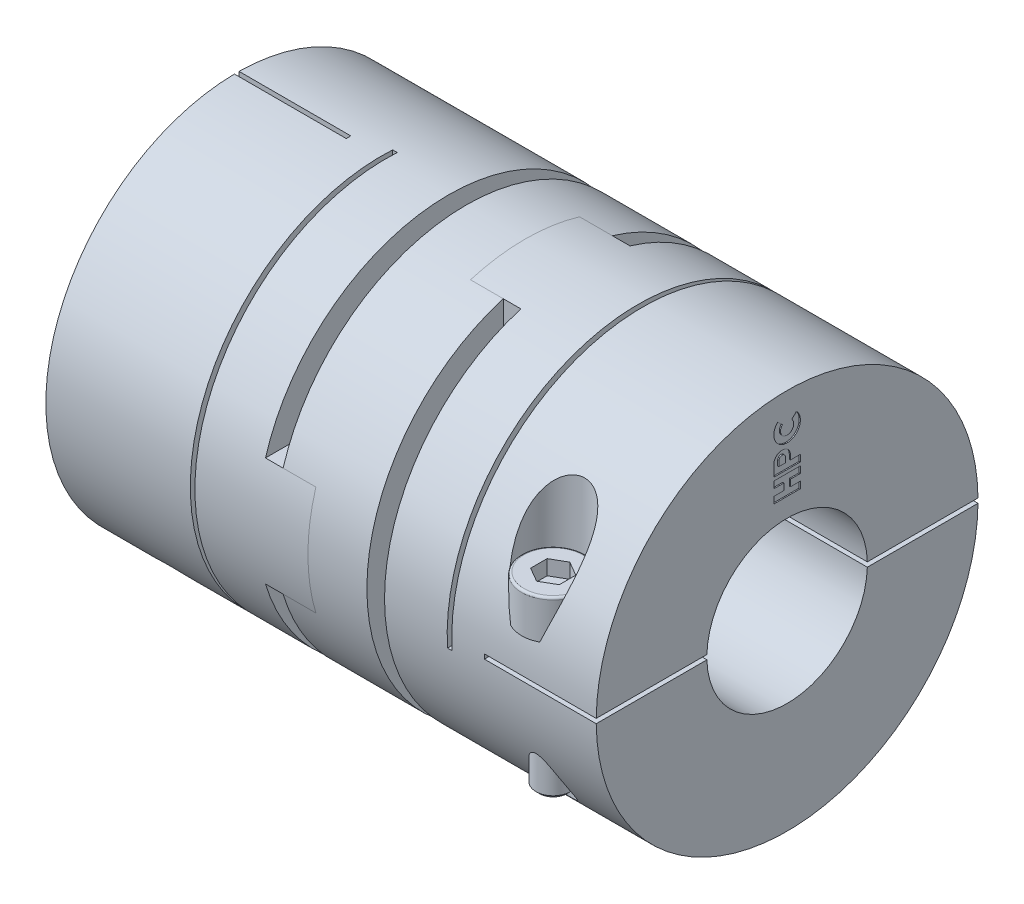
ISO-10303-21;
HEADER;
FILE_DESCRIPTION(('STEP AP214'),'2;1');
FILE_NAME('part.step','',(''),(''),'','','');
FILE_SCHEMA(('AUTOMOTIVE_DESIGN { 1 0 10303 214 1 1 1 1 }'));
ENDSEC;
DATA;
#1=APPLICATION_CONTEXT('core data for automotive mechanical design processes');
#2=APPLICATION_PROTOCOL_DEFINITION('international standard','automotive_design',2000,#1);
#3=PRODUCT_CONTEXT('',#1,'mechanical');
#4=PRODUCT('Part','Part','',(#3));
#5=PRODUCT_RELATED_PRODUCT_CATEGORY('part','',(#4));
#6=PRODUCT_DEFINITION_FORMATION('','',#4);
#7=PRODUCT_DEFINITION_CONTEXT('part definition',#1,'design');
#8=PRODUCT_DEFINITION('design','',#6,#7);
#9=PRODUCT_DEFINITION_SHAPE('','',#8);
#10=(LENGTH_UNIT() NAMED_UNIT(*) SI_UNIT(.MILLI.,.METRE.));
#11=(NAMED_UNIT(*) PLANE_ANGLE_UNIT() SI_UNIT($,.RADIAN.));
#12=(NAMED_UNIT(*) SI_UNIT($,.STERADIAN.) SOLID_ANGLE_UNIT());
#13=UNCERTAINTY_MEASURE_WITH_UNIT(LENGTH_MEASURE(1.E-05),#10,'distance_accuracy_value','');
#14=(GEOMETRIC_REPRESENTATION_CONTEXT(3) GLOBAL_UNCERTAINTY_ASSIGNED_CONTEXT((#13)) GLOBAL_UNIT_ASSIGNED_CONTEXT((#10,
#11,#12)) REPRESENTATION_CONTEXT('',''));
#15=CARTESIAN_POINT('',(0.,0.,0.));
#16=DIRECTION('',(0.,0.,1.));
#17=DIRECTION('',(1.,0.,0.));
#18=AXIS2_PLACEMENT_3D('',#15,#16,#17);
#19=CARTESIAN_POINT('',(35.399880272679,21.2,22.2));
#20=DIRECTION('',(-1.,0.,0.));
#21=DIRECTION('',(0.,0.,1.));
#22=AXIS2_PLACEMENT_3D('',#19,#20,#21);
#23=PLANE('',#22);
#24=CARTESIAN_POINT('',(35.399880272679,0.,0.));
#25=DIRECTION('',(1.,0.,0.));
#26=DIRECTION('',(0.,0.,-1.));
#27=AXIS2_PLACEMENT_3D('',#24,#25,#26);
#28=CIRCLE('',#27,7.);
#29=CARTESIAN_POINT('',(35.399880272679,-0.999999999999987,-6.9282032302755));
#30=VERTEX_POINT('',#29);
#31=CARTESIAN_POINT('',(35.399880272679,-0.199999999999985,-6.99714227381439));
#32=VERTEX_POINT('',#31);
#33=EDGE_CURVE('P0_E386',#30,#32,#28,.T.);
#34=ORIENTED_EDGE('',*,*,#33,.T.);
#35=DIRECTION('',(0.,0.,-1.));
#36=VECTOR('',#35,1.);
#37=CARTESIAN_POINT('',(35.399880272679,-0.199999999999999,0.));
#38=LINE('',#37,#36);
#39=CARTESIAN_POINT('',(35.399880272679,-0.200000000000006,-16.6487987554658));
#40=VERTEX_POINT('',#39);
#41=EDGE_CURVE('P0_E734',#40,#32,#38,.F.);
#42=ORIENTED_EDGE('',*,*,#41,.F.);
#43=CARTESIAN_POINT('',(35.399880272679,0.,0.));
#44=DIRECTION('',(1.,0.,0.));
#45=DIRECTION('',(0.,0.,-1.));
#46=AXIS2_PLACEMENT_3D('',#43,#44,#45);
#47=CIRCLE('',#46,16.65);
#48=CARTESIAN_POINT('',(35.399880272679,-0.999999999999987,-16.6199428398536));
#49=VERTEX_POINT('',#48);
#50=EDGE_CURVE('P0_E399',#40,#49,#47,.F.);
#51=ORIENTED_EDGE('',*,*,#50,.T.);
#52=DIRECTION('',(0.,0.,1.));
#53=VECTOR('',#52,1.);
#54=CARTESIAN_POINT('',(35.399880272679,-0.999999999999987,22.2));
#55=LINE('',#54,#53);
#56=EDGE_CURVE('P0_E398',#49,#30,#55,.T.);
#57=ORIENTED_EDGE('',*,*,#56,.T.);
#58=EDGE_LOOP('',(#34,#42,#51,#57));
#59=FACE_BOUND('',#58,.T.);
#60=ADVANCED_FACE('P0_F44',(#59),#23,.T.);
#61=CARTESIAN_POINT('',(47.999880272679,-0.199999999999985,0.));
#62=DIRECTION('',(0.,1.,0.));
#63=DIRECTION('',(0.,0.,-1.));
#64=AXIS2_PLACEMENT_3D('',#61,#62,#63);
#65=PLANE('',#64);
#66=DIRECTION('',(-1.,0.,0.));
#67=VECTOR('',#66,1.);
#68=CARTESIAN_POINT('',(47.999880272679,-0.199999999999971,6.99714227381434));
#69=LINE('',#68,#67);
#70=CARTESIAN_POINT('',(47.999880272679,-0.199999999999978,6.99714227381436));
#71=VERTEX_POINT('',#70);
#72=CARTESIAN_POINT('',(38.249880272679,-0.199999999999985,6.99714227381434));
#73=VERTEX_POINT('',#72);
#74=EDGE_CURVE('P0_E748',#71,#73,#69,.T.);
#75=ORIENTED_EDGE('',*,*,#74,.T.);
#76=DIRECTION('',(0.,0.,-1.));
#77=VECTOR('',#76,1.);
#78=CARTESIAN_POINT('',(38.249880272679,-0.199999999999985,0.));
#79=LINE('',#78,#77);
#80=CARTESIAN_POINT('',(38.249880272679,-0.199999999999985,16.6487987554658));
#81=VERTEX_POINT('',#80);
#82=EDGE_CURVE('P0_E48',#73,#81,#79,.F.);
#83=ORIENTED_EDGE('',*,*,#82,.T.);
#84=DIRECTION('',(1.,0.,0.));
#85=VECTOR('',#84,1.);
#86=CARTESIAN_POINT('',(25.1427374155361,-0.199999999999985,16.6487987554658));
#87=LINE('',#86,#85);
#88=CARTESIAN_POINT('',(47.999880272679,-0.199999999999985,16.6487987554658));
#89=VERTEX_POINT('',#88);
#90=EDGE_CURVE('P0_E470',#89,#81,#87,.F.);
#91=ORIENTED_EDGE('',*,*,#90,.F.);
#92=DIRECTION('',(0.,0.,-1.));
#93=VECTOR('',#92,1.);
#94=CARTESIAN_POINT('',(47.999880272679,-0.199999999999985,0.));
#95=LINE('',#94,#93);
#96=EDGE_CURVE('P0_E745',#89,#71,#95,.T.);
#97=ORIENTED_EDGE('',*,*,#96,.T.);
#98=EDGE_LOOP('',(#75,#83,#91,#97));
#99=FACE_BOUND('',#98,.T.);
#100=CARTESIAN_POINT('',(41.499880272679,-0.199999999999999,13.9));
#101=DIRECTION('',(0.,1.,0.));
#102=DIRECTION('',(0.,0.,-1.));
#103=AXIS2_PLACEMENT_3D('',#100,#101,#102);
#104=CIRCLE('',#103,1.5);
#105=CARTESIAN_POINT('',(41.499880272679,-0.199999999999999,12.4));
#106=VERTEX_POINT('',#105);
#107=EDGE_CURVE('P0_E749',#106,#106,#104,.F.);
#108=ORIENTED_EDGE('',*,*,#107,.T.);
#109=EDGE_LOOP('',(#108));
#110=FACE_BOUND('',#109,.T.);
#111=ADVANCED_FACE('P0_F693',(#99,#110),#65,.T.);
#112=CARTESIAN_POINT('',(47.999880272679,0.200000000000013,0.));
#113=DIRECTION('',(0.,1.,0.));
#114=DIRECTION('',(0.,0.,-1.));
#115=AXIS2_PLACEMENT_3D('',#112,#113,#114);
#116=PLANE('',#115);
#117=CARTESIAN_POINT('',(41.499880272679,0.199999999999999,13.9));
#118=DIRECTION('',(0.,1.,0.));
#119=DIRECTION('',(0.,0.,-1.));
#120=AXIS2_PLACEMENT_3D('',#117,#118,#119);
#121=CIRCLE('',#120,1.5);
#122=CARTESIAN_POINT('',(41.499880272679,0.199999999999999,12.4));
#123=VERTEX_POINT('',#122);
#124=EDGE_CURVE('P0_E465',#123,#123,#121,.F.);
#125=ORIENTED_EDGE('',*,*,#124,.F.);
#126=EDGE_LOOP('',(#125));
#127=FACE_BOUND('',#126,.T.);
#128=DIRECTION('',(0.,0.,-1.));
#129=VECTOR('',#128,1.);
#130=CARTESIAN_POINT('',(38.249880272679,0.200000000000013,0.));
#131=LINE('',#130,#129);
#132=CARTESIAN_POINT('',(38.249880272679,0.200000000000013,6.99714227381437));
#133=VERTEX_POINT('',#132);
#134=CARTESIAN_POINT('',(38.249880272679,0.200000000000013,16.6487987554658));
#135=VERTEX_POINT('',#134);
#136=EDGE_CURVE('P0_E414',#133,#135,#131,.F.);
#137=ORIENTED_EDGE('',*,*,#136,.F.);
#138=DIRECTION('',(-1.,0.,0.));
#139=VECTOR('',#138,1.);
#140=CARTESIAN_POINT('',(47.999880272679,0.20000000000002,6.99714227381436));
#141=LINE('',#140,#139);
#142=CARTESIAN_POINT('',(47.999880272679,0.20000000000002,6.99714227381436));
#143=VERTEX_POINT('',#142);
#144=EDGE_CURVE('P0_E464',#143,#133,#141,.T.);
#145=ORIENTED_EDGE('',*,*,#144,.F.);
#146=DIRECTION('',(0.,0.,-1.));
#147=VECTOR('',#146,1.);
#148=CARTESIAN_POINT('',(47.999880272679,0.200000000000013,0.));
#149=LINE('',#148,#147);
#150=CARTESIAN_POINT('',(47.999880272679,0.20000000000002,16.6487987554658));
#151=VERTEX_POINT('',#150);
#152=EDGE_CURVE('P0_E461',#151,#143,#149,.T.);
#153=ORIENTED_EDGE('',*,*,#152,.F.);
#154=DIRECTION('',(1.,0.,0.));
#155=VECTOR('',#154,1.);
#156=CARTESIAN_POINT('',(25.1427374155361,0.200000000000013,16.6487987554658));
#157=LINE('',#156,#155);
#158=EDGE_CURVE('P0_E466',#135,#151,#157,.T.);
#159=ORIENTED_EDGE('',*,*,#158,.F.);
#160=EDGE_LOOP('',(#137,#145,#153,#159));
#161=FACE_BOUND('',#160,.T.);
#162=ADVANCED_FACE('P0_F650',(#127,#161),#116,.F.);
#163=CARTESIAN_POINT('',(47.999880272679,7.00000000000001,0.));
#164=DIRECTION('',(-1.,0.,0.));
#165=DIRECTION('',(0.,0.,1.));
#166=AXIS2_PLACEMENT_3D('',#163,#164,#165);
#167=PLANE('',#166);
#168=DIRECTION('',(0.,0.,1.));
#169=VECTOR('',#168,1.);
#170=CARTESIAN_POINT('',(47.999880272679,11.2478,0.7215));
#171=LINE('',#170,#169);
#172=CARTESIAN_POINT('',(47.999880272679,11.2478,0.1443));
#173=VERTEX_POINT('',#172);
#174=CARTESIAN_POINT('',(47.999880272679,11.2478,0.7215));
#175=VERTEX_POINT('',#174);
#176=EDGE_CURVE('P0_E225',#173,#175,#171,.T.);
#177=ORIENTED_EDGE('',*,*,#176,.F.);
#178=DIRECTION('',(0.,1.,0.));
#179=VECTOR('',#178,1.);
#180=CARTESIAN_POINT('',(47.999880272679,11.2478,0.1443));
#181=LINE('',#180,#179);
#182=CARTESIAN_POINT('',(47.999880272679,11.6881,0.1443));
#183=VERTEX_POINT('',#182);
#184=EDGE_CURVE('P0_E221',#183,#173,#181,.F.);
#185=ORIENTED_EDGE('',*,*,#184,.F.);
#186=CARTESIAN_POINT('',(47.999880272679,11.6881,0.4329));
#187=DIRECTION('',(-1.,0.,0.));
#188=DIRECTION('',(0.,0.,1.));
#189=AXIS2_PLACEMENT_3D('',#186,#187,#188);
#190=CIRCLE('',#189,0.2886);
#191=CARTESIAN_POINT('',(47.999880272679,11.6881,0.721500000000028));
#192=VERTEX_POINT('',#191);
#193=EDGE_CURVE('P0_E617',#192,#183,#190,.T.);
#194=ORIENTED_EDGE('',*,*,#193,.F.);
#195=DIRECTION('',(0.,1.,0.));
#196=VECTOR('',#195,1.);
#197=CARTESIAN_POINT('',(47.999880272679,11.6881,0.721500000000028));
#198=LINE('',#197,#196);
#199=EDGE_CURVE('P0_E628',#175,#192,#198,.T.);
#200=ORIENTED_EDGE('',*,*,#199,.F.);
#201=EDGE_LOOP('',(#177,#185,#194,#200));
#202=FACE_BOUND('',#201,.T.);
#203=ADVANCED_FACE('P0_F46',(#202),#167,.F.);
#204=CARTESIAN_POINT('',(47.999880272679,5.36000000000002,0.));
#205=DIRECTION('',(0.,1.,0.));
#206=DIRECTION('',(0.,0.,-1.));
#207=AXIS2_PLACEMENT_3D('',#204,#205,#206);
#208=PLANE('',#207);
#209=DIRECTION('',(0.866025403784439,0.,0.499999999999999));
#210=VECTOR('',#209,1.);
#211=CARTESIAN_POINT('',(40.2498802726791,5.36,14.621687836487));
#212=LINE('',#211,#210);
#213=CARTESIAN_POINT('',(40.2498802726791,5.36,14.621687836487));
#214=VERTEX_POINT('',#213);
#215=CARTESIAN_POINT('',(41.499880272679,5.36000000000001,15.343375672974));
#216=VERTEX_POINT('',#215);
#217=EDGE_CURVE('P0_E594',#214,#216,#212,.T.);
#218=ORIENTED_EDGE('',*,*,#217,.T.);
#219=DIRECTION('',(0.866025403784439,0.,-0.499999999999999));
#220=VECTOR('',#219,1.);
#221=CARTESIAN_POINT('',(41.499880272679,5.36000000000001,15.3433756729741));
#222=LINE('',#221,#220);
#223=CARTESIAN_POINT('',(42.749880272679,5.36000000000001,14.621687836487));
#224=VERTEX_POINT('',#223);
#225=EDGE_CURVE('P0_E589',#216,#224,#222,.T.);
#226=ORIENTED_EDGE('',*,*,#225,.T.);
#227=DIRECTION('',(0.,0.,-1.));
#228=VECTOR('',#227,1.);
#229=CARTESIAN_POINT('',(42.749880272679,5.36000000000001,14.621687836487));
#230=LINE('',#229,#228);
#231=CARTESIAN_POINT('',(42.749880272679,5.36000000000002,13.178312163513));
#232=VERTEX_POINT('',#231);
#233=EDGE_CURVE('P0_E584',#224,#232,#230,.T.);
#234=ORIENTED_EDGE('',*,*,#233,.T.);
#235=DIRECTION('',(-0.866025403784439,0.,-0.499999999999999));
#236=VECTOR('',#235,1.);
#237=CARTESIAN_POINT('',(42.749880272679,5.36000000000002,13.178312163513));
#238=LINE('',#237,#236);
#239=CARTESIAN_POINT('',(41.499880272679,5.36,12.4566243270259));
#240=VERTEX_POINT('',#239);
#241=EDGE_CURVE('P0_E579',#232,#240,#238,.T.);
#242=ORIENTED_EDGE('',*,*,#241,.T.);
#243=DIRECTION('',(-0.866025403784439,0.,0.499999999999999));
#244=VECTOR('',#243,1.);
#245=CARTESIAN_POINT('',(41.499880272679,5.36,12.4566243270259));
#246=LINE('',#245,#244);
#247=CARTESIAN_POINT('',(40.249880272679,5.36000000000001,13.178312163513));
#248=VERTEX_POINT('',#247);
#249=EDGE_CURVE('P0_E574',#240,#248,#246,.T.);
#250=ORIENTED_EDGE('',*,*,#249,.T.);
#251=DIRECTION('',(0.,0.,1.));
#252=VECTOR('',#251,1.);
#253=CARTESIAN_POINT('',(40.2498802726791,5.36000000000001,13.178312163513));
#254=LINE('',#253,#252);
#255=EDGE_CURVE('P0_E599',#248,#214,#254,.T.);
#256=ORIENTED_EDGE('',*,*,#255,.T.);
#257=EDGE_LOOP('',(#218,#226,#234,#242,#250,#256));
#258=FACE_BOUND('',#257,.T.);
#259=ADVANCED_FACE('P0_F960',(#258),#208,.T.);
#260=CARTESIAN_POINT('',(47.899880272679,11.6881,0.721500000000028));
#261=DIRECTION('',(0.,0.,1.));
#262=DIRECTION('',(1.,0.,0.));
#263=AXIS2_PLACEMENT_3D('',#260,#261,#262);
#264=PLANE('',#263);
#265=DIRECTION('',(0.,1.,0.));
#266=VECTOR('',#265,1.);
#267=CARTESIAN_POINT('',(47.899880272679,11.6363330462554,0.721500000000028));
#268=LINE('',#267,#266);
#269=CARTESIAN_POINT('',(47.899880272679,11.2478,0.7215));
#270=VERTEX_POINT('',#269);
#271=CARTESIAN_POINT('',(47.899880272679,11.6881,0.721500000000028));
#272=VERTEX_POINT('',#271);
#273=EDGE_CURVE('P0_E549',#270,#272,#268,.T.);
#274=ORIENTED_EDGE('',*,*,#273,.F.);
#275=DIRECTION('',(-1.,0.,0.));
#276=VECTOR('',#275,1.);
#277=CARTESIAN_POINT('',(47.899880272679,11.2478,0.7215));
#278=LINE('',#277,#276);
#279=EDGE_CURVE('P0_E611',#175,#270,#278,.T.);
#280=ORIENTED_EDGE('',*,*,#279,.F.);
#281=ORIENTED_EDGE('',*,*,#199,.T.);
#282=DIRECTION('',(-1.,0.,0.));
#283=VECTOR('',#282,1.);
#284=CARTESIAN_POINT('',(47.899880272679,11.6881,0.721500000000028));
#285=LINE('',#284,#283);
#286=EDGE_CURVE('P0_E614',#272,#192,#285,.F.);
#287=ORIENTED_EDGE('',*,*,#286,.F.);
#288=EDGE_LOOP('',(#274,#280,#281,#287));
#289=FACE_BOUND('',#288,.T.);
#290=ADVANCED_FACE('P0_F957',(#289),#264,.T.);
#291=CARTESIAN_POINT('',(47.899880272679,11.6881,0.4329));
#292=DIRECTION('',(-1.,0.,0.));
#293=DIRECTION('',(0.,0.,1.));
#294=AXIS2_PLACEMENT_3D('',#291,#292,#293);
#295=CYLINDRICAL_SURFACE('',#294,0.2886);
#296=CARTESIAN_POINT('',(47.899880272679,11.6881,0.4329));
#297=DIRECTION('',(-1.,0.,0.));
#298=DIRECTION('',(0.,0.,1.));
#299=AXIS2_PLACEMENT_3D('',#296,#297,#298);
#300=CIRCLE('',#299,0.2886);
#301=CARTESIAN_POINT('',(47.899880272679,11.6881,0.1443));
#302=VERTEX_POINT('',#301);
#303=EDGE_CURVE('P0_E546',#272,#302,#300,.T.);
#304=ORIENTED_EDGE('',*,*,#303,.F.);
#305=ORIENTED_EDGE('',*,*,#286,.T.);
#306=ORIENTED_EDGE('',*,*,#193,.T.);
#307=DIRECTION('',(-1.,0.,0.));
#308=VECTOR('',#307,1.);
#309=CARTESIAN_POINT('',(47.899880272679,11.6881,0.1443));
#310=LINE('',#309,#308);
#311=EDGE_CURVE('P0_E602',#302,#183,#310,.F.);
#312=ORIENTED_EDGE('',*,*,#311,.F.);
#313=EDGE_LOOP('',(#304,#305,#306,#312));
#314=FACE_BOUND('',#313,.T.);
#315=ADVANCED_FACE('P0_F953',(#314),#295,.T.);
#316=CARTESIAN_POINT('',(47.899880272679,11.2478,0.1443));
#317=DIRECTION('',(0.,0.,-1.));
#318=DIRECTION('',(-1.,0.,0.));
#319=AXIS2_PLACEMENT_3D('',#316,#317,#318);
#320=PLANE('',#319);
#321=DIRECTION('',(0.,1.,0.));
#322=VECTOR('',#321,1.);
#323=CARTESIAN_POINT('',(47.899880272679,11.6363330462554,0.1443));
#324=LINE('',#323,#322);
#325=CARTESIAN_POINT('',(47.899880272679,11.2478,0.1443));
#326=VERTEX_POINT('',#325);
#327=EDGE_CURVE('P0_E543',#302,#326,#324,.F.);
#328=ORIENTED_EDGE('',*,*,#327,.F.);
#329=ORIENTED_EDGE('',*,*,#311,.T.);
#330=ORIENTED_EDGE('',*,*,#184,.T.);
#331=DIRECTION('',(-1.,0.,0.));
#332=VECTOR('',#331,1.);
#333=CARTESIAN_POINT('',(47.899880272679,11.2478,0.1443));
#334=LINE('',#333,#332);
#335=EDGE_CURVE('P0_E601',#326,#173,#334,.F.);
#336=ORIENTED_EDGE('',*,*,#335,.F.);
#337=EDGE_LOOP('',(#328,#329,#330,#336));
#338=FACE_BOUND('',#337,.T.);
#339=ADVANCED_FACE('P0_F949',(#338),#320,.T.);
#340=CARTESIAN_POINT('',(47.899880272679,11.2478,0.7215));
#341=DIRECTION('',(0.,-1.,0.));
#342=DIRECTION('',(0.,0.,1.));
#343=AXIS2_PLACEMENT_3D('',#340,#341,#342);
#344=PLANE('',#343);
#345=DIRECTION('',(0.,0.,-1.));
#346=VECTOR('',#345,1.);
#347=CARTESIAN_POINT('',(47.899880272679,11.2478,0.434749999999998));
#348=LINE('',#347,#346);
#349=EDGE_CURVE('P0_E526',#326,#270,#348,.F.);
#350=ORIENTED_EDGE('',*,*,#349,.F.);
#351=ORIENTED_EDGE('',*,*,#335,.T.);
#352=ORIENTED_EDGE('',*,*,#176,.T.);
#353=ORIENTED_EDGE('',*,*,#279,.T.);
#354=EDGE_LOOP('',(#350,#351,#352,#353));
#355=FACE_BOUND('',#354,.T.);
#356=ADVANCED_FACE('P0_F945',(#355),#344,.T.);
#357=CARTESIAN_POINT('',(40.2498802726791,5.36000000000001,13.178312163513));
#358=DIRECTION('',(-1.,0.,0.));
#359=DIRECTION('',(0.,0.,1.));
#360=AXIS2_PLACEMENT_3D('',#357,#358,#359);
#361=PLANE('',#360);
#362=DIRECTION('',(0.,0.,1.));
#363=VECTOR('',#362,1.);
#364=CARTESIAN_POINT('',(40.2498802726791,6.66000000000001,13.9));
#365=LINE('',#364,#363);
#366=CARTESIAN_POINT('',(40.249880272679,6.66000000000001,13.178312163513));
#367=VERTEX_POINT('',#366);
#368=CARTESIAN_POINT('',(40.2498802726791,6.66000000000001,14.621687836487));
#369=VERTEX_POINT('',#368);
#370=EDGE_CURVE('P0_E525',#367,#369,#365,.T.);
#371=ORIENTED_EDGE('',*,*,#370,.T.);
#372=DIRECTION('',(0.,1.,0.));
#373=VECTOR('',#372,1.);
#374=CARTESIAN_POINT('',(40.2498802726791,5.36,14.621687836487));
#375=LINE('',#374,#373);
#376=EDGE_CURVE('P0_E596',#369,#214,#375,.F.);
#377=ORIENTED_EDGE('',*,*,#376,.T.);
#378=ORIENTED_EDGE('',*,*,#255,.F.);
#379=DIRECTION('',(0.,1.,0.));
#380=VECTOR('',#379,1.);
#381=CARTESIAN_POINT('',(40.249880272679,5.36000000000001,13.178312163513));
#382=LINE('',#381,#380);
#383=EDGE_CURVE('P0_E552',#248,#367,#382,.T.);
#384=ORIENTED_EDGE('',*,*,#383,.T.);
#385=EDGE_LOOP('',(#371,#377,#378,#384));
#386=FACE_BOUND('',#385,.T.);
#387=ADVANCED_FACE('P0_F941',(#386),#361,.F.);
#388=CARTESIAN_POINT('',(40.2498802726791,5.36,14.621687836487));
#389=DIRECTION('',(-0.499999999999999,0.,0.866025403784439));
#390=DIRECTION('',(0.866025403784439,0.,0.499999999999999));
#391=AXIS2_PLACEMENT_3D('',#388,#389,#390);
#392=PLANE('',#391);
#393=DIRECTION('',(0.,1.,0.));
#394=VECTOR('',#393,1.);
#395=CARTESIAN_POINT('',(41.499880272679,5.36000000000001,15.3433756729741));
#396=LINE('',#395,#394);
#397=CARTESIAN_POINT('',(41.499880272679,6.66000000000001,15.3433756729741));
#398=VERTEX_POINT('',#397);
#399=EDGE_CURVE('P0_E591',#398,#216,#396,.F.);
#400=ORIENTED_EDGE('',*,*,#399,.T.);
#401=ORIENTED_EDGE('',*,*,#217,.F.);
#402=ORIENTED_EDGE('',*,*,#376,.F.);
#403=DIRECTION('',(0.866025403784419,0.,0.500000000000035));
#404=VECTOR('',#403,1.);
#405=CARTESIAN_POINT('',(40.2498802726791,6.66000000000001,14.621687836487));
#406=LINE('',#405,#404);
#407=EDGE_CURVE('P0_E973',#369,#398,#406,.T.);
#408=ORIENTED_EDGE('',*,*,#407,.T.);
#409=EDGE_LOOP('',(#400,#401,#402,#408));
#410=FACE_BOUND('',#409,.T.);
#411=ADVANCED_FACE('P0_F937',(#410),#392,.F.);
#412=CARTESIAN_POINT('',(41.499880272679,5.36000000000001,15.3433756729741));
#413=DIRECTION('',(0.499999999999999,0.,0.866025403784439));
#414=DIRECTION('',(0.866025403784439,0.,-0.499999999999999));
#415=AXIS2_PLACEMENT_3D('',#412,#413,#414);
#416=PLANE('',#415);
#417=DIRECTION('',(0.,1.,0.));
#418=VECTOR('',#417,1.);
#419=CARTESIAN_POINT('',(42.749880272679,5.36000000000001,14.621687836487));
#420=LINE('',#419,#418);
#421=CARTESIAN_POINT('',(42.749880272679,6.66000000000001,14.621687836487));
#422=VERTEX_POINT('',#421);
#423=EDGE_CURVE('P0_E586',#422,#224,#420,.F.);
#424=ORIENTED_EDGE('',*,*,#423,.T.);
#425=ORIENTED_EDGE('',*,*,#225,.F.);
#426=ORIENTED_EDGE('',*,*,#399,.F.);
#427=DIRECTION('',(0.866025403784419,0.,-0.500000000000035));
#428=VECTOR('',#427,1.);
#429=CARTESIAN_POINT('',(41.499880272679,6.66000000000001,15.3433756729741));
#430=LINE('',#429,#428);
#431=EDGE_CURVE('P0_E977',#398,#422,#430,.T.);
#432=ORIENTED_EDGE('',*,*,#431,.T.);
#433=EDGE_LOOP('',(#424,#425,#426,#432));
#434=FACE_BOUND('',#433,.T.);
#435=ADVANCED_FACE('P0_F933',(#434),#416,.F.);
#436=CARTESIAN_POINT('',(42.749880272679,5.36000000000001,14.621687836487));
#437=DIRECTION('',(1.,0.,0.));
#438=DIRECTION('',(0.,0.,-1.));
#439=AXIS2_PLACEMENT_3D('',#436,#437,#438);
#440=PLANE('',#439);
#441=DIRECTION('',(0.,1.,0.));
#442=VECTOR('',#441,1.);
#443=CARTESIAN_POINT('',(42.749880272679,5.36000000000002,13.178312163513));
#444=LINE('',#443,#442);
#445=CARTESIAN_POINT('',(42.749880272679,6.66000000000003,13.178312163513));
#446=VERTEX_POINT('',#445);
#447=EDGE_CURVE('P0_E581',#446,#232,#444,.F.);
#448=ORIENTED_EDGE('',*,*,#447,.T.);
#449=ORIENTED_EDGE('',*,*,#233,.F.);
#450=ORIENTED_EDGE('',*,*,#423,.F.);
#451=DIRECTION('',(0.,0.,1.));
#452=VECTOR('',#451,1.);
#453=CARTESIAN_POINT('',(42.749880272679,6.66000000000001,13.9));
#454=LINE('',#453,#452);
#455=EDGE_CURVE('P0_E990',#422,#446,#454,.F.);
#456=ORIENTED_EDGE('',*,*,#455,.T.);
#457=EDGE_LOOP('',(#448,#449,#450,#456));
#458=FACE_BOUND('',#457,.T.);
#459=ADVANCED_FACE('P0_F929',(#458),#440,.F.);
#460=CARTESIAN_POINT('',(42.749880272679,5.36000000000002,13.178312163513));
#461=DIRECTION('',(0.499999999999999,0.,-0.866025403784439));
#462=DIRECTION('',(-0.866025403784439,0.,-0.499999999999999));
#463=AXIS2_PLACEMENT_3D('',#460,#461,#462);
#464=PLANE('',#463);
#465=DIRECTION('',(0.,1.,0.));
#466=VECTOR('',#465,1.);
#467=CARTESIAN_POINT('',(41.499880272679,5.36,12.4566243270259));
#468=LINE('',#467,#466);
#469=CARTESIAN_POINT('',(41.499880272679,6.66,12.4566243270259));
#470=VERTEX_POINT('',#469);
#471=EDGE_CURVE('P0_E576',#470,#240,#468,.F.);
#472=ORIENTED_EDGE('',*,*,#471,.T.);
#473=ORIENTED_EDGE('',*,*,#241,.F.);
#474=ORIENTED_EDGE('',*,*,#447,.F.);
#475=DIRECTION('',(-0.866025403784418,0.,-0.500000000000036));
#476=VECTOR('',#475,1.);
#477=CARTESIAN_POINT('',(42.749880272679,6.66000000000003,13.178312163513));
#478=LINE('',#477,#476);
#479=EDGE_CURVE('P0_E984',#446,#470,#478,.T.);
#480=ORIENTED_EDGE('',*,*,#479,.T.);
#481=EDGE_LOOP('',(#472,#473,#474,#480));
#482=FACE_BOUND('',#481,.T.);
#483=ADVANCED_FACE('P0_F925',(#482),#464,.F.);
#484=CARTESIAN_POINT('',(41.499880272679,5.36,12.4566243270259));
#485=DIRECTION('',(-0.499999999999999,0.,-0.866025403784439));
#486=DIRECTION('',(-0.866025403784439,0.,0.499999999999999));
#487=AXIS2_PLACEMENT_3D('',#484,#485,#486);
#488=PLANE('',#487);
#489=ORIENTED_EDGE('',*,*,#383,.F.);
#490=ORIENTED_EDGE('',*,*,#249,.F.);
#491=ORIENTED_EDGE('',*,*,#471,.F.);
#492=DIRECTION('',(-0.866025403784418,0.,0.500000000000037));
#493=VECTOR('',#492,1.);
#494=CARTESIAN_POINT('',(41.499880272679,6.66,12.4566243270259));
#495=LINE('',#494,#493);
#496=EDGE_CURVE('P0_E572',#470,#367,#495,.T.);
#497=ORIENTED_EDGE('',*,*,#496,.T.);
#498=EDGE_LOOP('',(#489,#490,#491,#497));
#499=FACE_BOUND('',#498,.T.);
#500=ADVANCED_FACE('P0_F921',(#499),#488,.F.);
#501=CARTESIAN_POINT('',(47.899880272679,13.8489,0.));
#502=DIRECTION('',(1.,0.,0.));
#503=DIRECTION('',(0.,0.,-1.));
#504=AXIS2_PLACEMENT_3D('',#501,#502,#503);
#505=PLANE('',#504);
#506=DIRECTION('',(0.,0.707106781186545,-0.70710678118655));
#507=VECTOR('',#506,1.);
#508=CARTESIAN_POINT('',(47.899880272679,14.6678003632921,-0.818900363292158));
#509=LINE('',#508,#507);
#510=CARTESIAN_POINT('',(47.899880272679,14.6678003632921,-0.818900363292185));
#511=VERTEX_POINT('',#510);
#512=CARTESIAN_POINT('',(47.899880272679,14.2570420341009,-0.408142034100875));
#513=VERTEX_POINT('',#512);
#514=EDGE_CURVE('P0_E569',#511,#513,#509,.F.);
#515=ORIENTED_EDGE('',*,*,#514,.T.);
#516=CARTESIAN_POINT('',(47.899880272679,13.8489,0.));
#517=DIRECTION('',(-1.,0.,0.));
#518=DIRECTION('',(0.,0.,1.));
#519=AXIS2_PLACEMENT_3D('',#516,#517,#518);
#520=CIRCLE('',#519,0.5772);
#521=CARTESIAN_POINT('',(47.899880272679,14.2570420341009,0.408142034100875));
#522=VERTEX_POINT('',#521);
#523=EDGE_CURVE('P0_E571',#522,#513,#520,.F.);
#524=ORIENTED_EDGE('',*,*,#523,.F.);
#525=DIRECTION('',(0.,-0.707106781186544,-0.707106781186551));
#526=VECTOR('',#525,1.);
#527=CARTESIAN_POINT('',(47.899880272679,14.2570420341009,0.408142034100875));
#528=LINE('',#527,#526);
#529=CARTESIAN_POINT('',(47.899880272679,14.6678003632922,0.818900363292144));
#530=VERTEX_POINT('',#529);
#531=EDGE_CURVE('P0_E565',#522,#530,#528,.F.);
#532=ORIENTED_EDGE('',*,*,#531,.T.);
#533=CARTESIAN_POINT('',(47.899880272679,13.8489,0.));
#534=DIRECTION('',(-1.,0.,0.));
#535=DIRECTION('',(0.,0.,1.));
#536=AXIS2_PLACEMENT_3D('',#533,#534,#535);
#537=CIRCLE('',#536,1.1581);
#538=EDGE_CURVE('P0_E567',#530,#511,#537,.F.);
#539=ORIENTED_EDGE('',*,*,#538,.T.);
#540=EDGE_LOOP('',(#515,#524,#532,#539));
#541=FACE_BOUND('',#540,.T.);
#542=ADVANCED_FACE('P0_F917',(#541),#505,.T.);
#543=CARTESIAN_POINT('',(47.899880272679,11.6363330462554,0.434749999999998));
#544=DIRECTION('',(1.,0.,0.));
#545=DIRECTION('',(0.,0.,-1.));
#546=AXIS2_PLACEMENT_3D('',#543,#544,#545);
#547=PLANE('',#546);
#548=DIRECTION('',(0.,1.,0.));
#549=VECTOR('',#548,1.);
#550=CARTESIAN_POINT('',(47.899880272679,11.2478,-0.288599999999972));
#551=LINE('',#550,#549);
#552=CARTESIAN_POINT('',(47.899880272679,11.2478,-0.288599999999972));
#553=VERTEX_POINT('',#552);
#554=CARTESIAN_POINT('',(47.899880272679,11.6881,-0.2886));
#555=VERTEX_POINT('',#554);
#556=EDGE_CURVE('P0_E555',#553,#555,#551,.T.);
#557=ORIENTED_EDGE('',*,*,#556,.T.);
#558=CARTESIAN_POINT('',(47.899880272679,11.6363330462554,0.434749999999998));
#559=DIRECTION('',(-1.,0.,0.));
#560=DIRECTION('',(0.,0.,1.));
#561=AXIS2_PLACEMENT_3D('',#558,#559,#560);
#562=CIRCLE('',#561,0.7252);
#563=CARTESIAN_POINT('',(47.899880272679,11.6881,1.15810000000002));
#564=VERTEX_POINT('',#563);
#565=EDGE_CURVE('P0_E847',#555,#564,#562,.F.);
#566=ORIENTED_EDGE('',*,*,#565,.T.);
#567=DIRECTION('',(0.,0.999993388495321,0.0036363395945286));
#568=VECTOR('',#567,1.);
#569=CARTESIAN_POINT('',(47.899880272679,11.6881,1.15810000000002));
#570=LINE('',#569,#568);
#571=CARTESIAN_POINT('',(47.899880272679,10.6706,1.1544));
#572=VERTEX_POINT('',#571);
#573=EDGE_CURVE('P0_E527',#564,#572,#570,.F.);
#574=ORIENTED_EDGE('',*,*,#573,.T.);
#575=DIRECTION('',(0.,0.,1.));
#576=VECTOR('',#575,1.);
#577=CARTESIAN_POINT('',(47.899880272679,10.6706,1.1544));
#578=LINE('',#577,#576);
#579=CARTESIAN_POINT('',(47.899880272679,10.6706,-1.15810000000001));
#580=VERTEX_POINT('',#579);
#581=EDGE_CURVE('P0_E529',#572,#580,#578,.F.);
#582=ORIENTED_EDGE('',*,*,#581,.T.);
#583=DIRECTION('',(0.,-1.,0.));
#584=VECTOR('',#583,1.);
#585=CARTESIAN_POINT('',(47.899880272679,10.6706,-1.15810000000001));
#586=LINE('',#585,#584);
#587=CARTESIAN_POINT('',(47.899880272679,11.2478,-1.1581));
#588=VERTEX_POINT('',#587);
#589=EDGE_CURVE('P0_E537',#580,#588,#586,.F.);
#590=ORIENTED_EDGE('',*,*,#589,.T.);
#591=DIRECTION('',(0.,0.,-1.));
#592=VECTOR('',#591,1.);
#593=CARTESIAN_POINT('',(47.899880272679,11.2478,-1.1581));
#594=LINE('',#593,#592);
#595=EDGE_CURVE('P0_E561',#588,#553,#594,.F.);
#596=ORIENTED_EDGE('',*,*,#595,.T.);
#597=EDGE_LOOP('',(#557,#566,#574,#582,#590,#596));
#598=FACE_BOUND('',#597,.T.);
#599=ORIENTED_EDGE('',*,*,#327,.T.);
#600=ORIENTED_EDGE('',*,*,#349,.T.);
#601=ORIENTED_EDGE('',*,*,#273,.T.);
#602=ORIENTED_EDGE('',*,*,#303,.T.);
#603=EDGE_LOOP('',(#599,#600,#601,#602));
#604=FACE_BOUND('',#603,.T.);
#605=ADVANCED_FACE('P0_F913',(#598,#604),#547,.T.);
#606=CARTESIAN_POINT('',(47.899880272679,0.,0.));
#607=DIRECTION('',(1.,0.,0.));
#608=DIRECTION('',(0.,0.,-1.));
#609=AXIS2_PLACEMENT_3D('',#606,#607,#608);
#610=PLANE('',#609);
#611=DIRECTION('',(0.,1.,0.));
#612=VECTOR('',#611,1.);
#613=CARTESIAN_POINT('',(47.899880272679,9.80110000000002,0.2886));
#614=LINE('',#613,#612);
#615=CARTESIAN_POINT('',(47.899880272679,9.80110000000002,0.2886));
#616=VERTEX_POINT('',#615);
#617=CARTESIAN_POINT('',(47.899880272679,9.22390000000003,0.2886));
#618=VERTEX_POINT('',#617);
#619=EDGE_CURVE('P0_E837',#616,#618,#614,.F.);
#620=ORIENTED_EDGE('',*,*,#619,.T.);
#621=DIRECTION('',(0.,0.,-1.));
#622=VECTOR('',#621,1.);
#623=CARTESIAN_POINT('',(47.899880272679,9.22390000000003,0.2886));
#624=LINE('',#623,#622);
#625=CARTESIAN_POINT('',(47.899880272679,9.22390000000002,1.1544));
#626=VERTEX_POINT('',#625);
#627=EDGE_CURVE('P0_E832',#618,#626,#624,.F.);
#628=ORIENTED_EDGE('',*,*,#627,.T.);
#629=DIRECTION('',(0.,1.,0.));
#630=VECTOR('',#629,1.);
#631=CARTESIAN_POINT('',(47.899880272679,9.22390000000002,1.1544));
#632=LINE('',#631,#630);
#633=CARTESIAN_POINT('',(47.899880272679,8.64670000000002,1.1544));
#634=VERTEX_POINT('',#633);
#635=EDGE_CURVE('P0_E827',#626,#634,#632,.F.);
#636=ORIENTED_EDGE('',*,*,#635,.T.);
#637=DIRECTION('',(0.,0.,1.));
#638=VECTOR('',#637,1.);
#639=CARTESIAN_POINT('',(47.899880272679,8.64670000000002,1.1544));
#640=LINE('',#639,#638);
#641=CARTESIAN_POINT('',(47.899880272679,8.64670000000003,-1.15809999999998));
#642=VERTEX_POINT('',#641);
#643=EDGE_CURVE('P0_E825',#634,#642,#640,.F.);
#644=ORIENTED_EDGE('',*,*,#643,.T.);
#645=DIRECTION('',(0.,-1.,0.));
#646=VECTOR('',#645,1.);
#647=CARTESIAN_POINT('',(47.899880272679,8.64670000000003,-1.15809999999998));
#648=LINE('',#647,#646);
#649=CARTESIAN_POINT('',(47.899880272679,9.22390000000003,-1.1581));
#650=VERTEX_POINT('',#649);
#651=EDGE_CURVE('P0_E817',#642,#650,#648,.F.);
#652=ORIENTED_EDGE('',*,*,#651,.T.);
#653=DIRECTION('',(0.,0.,-1.));
#654=VECTOR('',#653,1.);
#655=CARTESIAN_POINT('',(47.899880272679,9.22390000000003,-1.1581));
#656=LINE('',#655,#654);
#657=CARTESIAN_POINT('',(47.899880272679,9.22390000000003,-0.2886));
#658=VERTEX_POINT('',#657);
#659=EDGE_CURVE('P0_E812',#650,#658,#656,.F.);
#660=ORIENTED_EDGE('',*,*,#659,.T.);
#661=DIRECTION('',(0.,1.,0.));
#662=VECTOR('',#661,1.);
#663=CARTESIAN_POINT('',(47.899880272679,9.22390000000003,-0.2886));
#664=LINE('',#663,#662);
#665=CARTESIAN_POINT('',(47.899880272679,9.80110000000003,-0.2886));
#666=VERTEX_POINT('',#665);
#667=EDGE_CURVE('P0_E807',#658,#666,#664,.T.);
#668=ORIENTED_EDGE('',*,*,#667,.T.);
#669=DIRECTION('',(0.,0.,1.));
#670=VECTOR('',#669,1.);
#671=CARTESIAN_POINT('',(47.899880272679,9.80110000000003,-0.2886));
#672=LINE('',#671,#670);
#673=CARTESIAN_POINT('',(47.899880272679,9.80110000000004,-1.1581));
#674=VERTEX_POINT('',#673);
#675=EDGE_CURVE('P0_E802',#666,#674,#672,.F.);
#676=ORIENTED_EDGE('',*,*,#675,.T.);
#677=DIRECTION('',(0.,1.,0.));
#678=VECTOR('',#677,1.);
#679=CARTESIAN_POINT('',(47.899880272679,9.80110000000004,-1.1581));
#680=LINE('',#679,#678);
#681=CARTESIAN_POINT('',(47.899880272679,10.382,-1.1581));
#682=VERTEX_POINT('',#681);
#683=EDGE_CURVE('P0_E797',#674,#682,#680,.T.);
#684=ORIENTED_EDGE('',*,*,#683,.T.);
#685=DIRECTION('',(0.,0.,-1.));
#686=VECTOR('',#685,1.);
#687=CARTESIAN_POINT('',(47.899880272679,10.382,-1.1581));
#688=LINE('',#687,#686);
#689=CARTESIAN_POINT('',(47.899880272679,10.382,1.1544));
#690=VERTEX_POINT('',#689);
#691=EDGE_CURVE('P0_E791',#682,#690,#688,.F.);
#692=ORIENTED_EDGE('',*,*,#691,.T.);
#693=DIRECTION('',(0.,1.,0.));
#694=VECTOR('',#693,1.);
#695=CARTESIAN_POINT('',(47.899880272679,0.,1.1544));
#696=LINE('',#695,#694);
#697=CARTESIAN_POINT('',(47.899880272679,9.80110000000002,1.1544));
#698=VERTEX_POINT('',#697);
#699=EDGE_CURVE('P0_E518',#690,#698,#696,.F.);
#700=ORIENTED_EDGE('',*,*,#699,.T.);
#701=DIRECTION('',(0.,0.,1.));
#702=VECTOR('',#701,1.);
#703=CARTESIAN_POINT('',(47.899880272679,9.80110000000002,1.1544));
#704=LINE('',#703,#702);
#705=EDGE_CURVE('P0_E842',#698,#616,#704,.F.);
#706=ORIENTED_EDGE('',*,*,#705,.T.);
#707=EDGE_LOOP('',(#620,#628,#636,#644,#652,#660,#668,#676,#684,#692,#700,#706));
#708=FACE_BOUND('',#707,.T.);
#709=ADVANCED_FACE('P0_F909',(#708),#610,.T.);
#710=CARTESIAN_POINT('',(40.3063802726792,-9.5142857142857,13.9));
#711=DIRECTION('',(0.,1.,0.));
#712=DIRECTION('',(0.,0.,-1.));
#713=AXIS2_PLACEMENT_3D('',#710,#711,#712);
#714=PLANE('',#713);
#715=CARTESIAN_POINT('',(41.4998802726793,-9.5142857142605,13.9));
#716=DIRECTION('',(0.,1.,0.));
#717=DIRECTION('',(0.,0.,-1.));
#718=AXIS2_PLACEMENT_3D('',#715,#716,#717);
#719=CIRCLE('',#718,1.1934999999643);
#720=CARTESIAN_POINT('',(41.4998802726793,-9.5142857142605,12.7065000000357));
#721=VERTEX_POINT('',#720);
#722=EDGE_CURVE('P0_E1490',#721,#721,#719,.T.);
#723=ORIENTED_EDGE('',*,*,#722,.F.);
#724=EDGE_LOOP('',(#723));
#725=FACE_BOUND('',#724,.T.);
#726=ADVANCED_FACE('P0_F904',(#725),#714,.F.);
#727=CARTESIAN_POINT('',(41.499880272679,6.66000000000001,13.9));
#728=DIRECTION('',(0.,-1.,0.));
#729=DIRECTION('',(0.,0.,1.));
#730=AXIS2_PLACEMENT_3D('',#727,#728,#729);
#731=PLANE('',#730);
#732=ORIENTED_EDGE('',*,*,#479,.F.);
#733=ORIENTED_EDGE('',*,*,#455,.F.);
#734=ORIENTED_EDGE('',*,*,#431,.F.);
#735=ORIENTED_EDGE('',*,*,#407,.F.);
#736=ORIENTED_EDGE('',*,*,#370,.F.);
#737=ORIENTED_EDGE('',*,*,#496,.F.);
#738=EDGE_LOOP('',(#732,#733,#734,#735,#736,#737));
#739=FACE_BOUND('',#738,.T.);
#740=CARTESIAN_POINT('',(41.499880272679,6.66,13.9));
#741=DIRECTION('',(0.,-1.,0.));
#742=DIRECTION('',(0.,0.,1.));
#743=AXIS2_PLACEMENT_3D('',#740,#741,#742);
#744=CIRCLE('',#743,2.54999999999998);
#745=CARTESIAN_POINT('',(41.499880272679,6.66,16.45));
#746=VERTEX_POINT('',#745);
#747=EDGE_CURVE('P0_E492',#746,#746,#744,.T.);
#748=ORIENTED_EDGE('',*,*,#747,.F.);
#749=EDGE_LOOP('',(#748));
#750=FACE_BOUND('',#749,.T.);
#751=ADVANCED_FACE('P0_F893',(#739,#750),#731,.F.);
#752=CARTESIAN_POINT('',(47.899880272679,14.6678003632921,-0.818900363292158));
#753=DIRECTION('',(0.,0.70710678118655,0.707106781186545));
#754=DIRECTION('',(0.,0.707106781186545,-0.70710678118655));
#755=AXIS2_PLACEMENT_3D('',#752,#753,#754);
#756=PLANE('',#755);
#757=DIRECTION('',(-1.,0.,0.));
#758=VECTOR('',#757,1.);
#759=CARTESIAN_POINT('',(47.899880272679,14.2570420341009,-0.408142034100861));
#760=LINE('',#759,#758);
#761=CARTESIAN_POINT('',(47.999880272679,14.2570420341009,-0.408142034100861));
#762=VERTEX_POINT('',#761);
#763=EDGE_CURVE('P0_E882',#513,#762,#760,.F.);
#764=ORIENTED_EDGE('',*,*,#763,.F.);
#765=ORIENTED_EDGE('',*,*,#514,.F.);
#766=DIRECTION('',(-1.,0.,0.));
#767=VECTOR('',#766,1.);
#768=CARTESIAN_POINT('',(47.899880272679,14.6678003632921,-0.818900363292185));
#769=LINE('',#768,#767);
#770=CARTESIAN_POINT('',(47.999880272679,14.6678003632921,-0.818900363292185));
#771=VERTEX_POINT('',#770);
#772=EDGE_CURVE('P0_E876',#511,#771,#769,.F.);
#773=ORIENTED_EDGE('',*,*,#772,.T.);
#774=DIRECTION('',(0.,-0.70710678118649,0.707106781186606));
#775=VECTOR('',#774,1.);
#776=CARTESIAN_POINT('',(47.999880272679,14.6678003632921,-0.818900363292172));
#777=LINE('',#776,#775);
#778=EDGE_CURVE('P0_E458',#771,#762,#777,.T.);
#779=ORIENTED_EDGE('',*,*,#778,.T.);
#780=EDGE_LOOP('',(#764,#765,#773,#779));
#781=FACE_BOUND('',#780,.T.);
#782=ADVANCED_FACE('P0_F903',(#781),#756,.F.);
#783=CARTESIAN_POINT('',(47.899880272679,13.8489,0.));
#784=DIRECTION('',(-1.,0.,0.));
#785=DIRECTION('',(0.,0.,1.));
#786=AXIS2_PLACEMENT_3D('',#783,#784,#785);
#787=CYLINDRICAL_SURFACE('',#786,0.5772);
#788=ORIENTED_EDGE('',*,*,#523,.T.);
#789=ORIENTED_EDGE('',*,*,#763,.T.);
#790=CARTESIAN_POINT('',(47.999880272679,13.8489,0.));
#791=DIRECTION('',(-1.,0.,0.));
#792=DIRECTION('',(0.,0.,1.));
#793=AXIS2_PLACEMENT_3D('',#790,#791,#792);
#794=CIRCLE('',#793,0.5772);
#795=CARTESIAN_POINT('',(47.999880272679,14.2570420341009,0.408142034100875));
#796=VERTEX_POINT('',#795);
#797=EDGE_CURVE('P0_E457',#762,#796,#794,.T.);
#798=ORIENTED_EDGE('',*,*,#797,.T.);
#799=DIRECTION('',(-1.,0.,0.));
#800=VECTOR('',#799,1.);
#801=CARTESIAN_POINT('',(47.899880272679,14.2570420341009,0.408142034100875));
#802=LINE('',#801,#800);
#803=EDGE_CURVE('P0_E568',#796,#522,#802,.T.);
#804=ORIENTED_EDGE('',*,*,#803,.T.);
#805=EDGE_LOOP('',(#788,#789,#798,#804));
#806=FACE_BOUND('',#805,.T.);
#807=ADVANCED_FACE('P0_F1329',(#806),#787,.T.);
#808=CARTESIAN_POINT('',(47.899880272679,14.2570420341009,0.408142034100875));
#809=DIRECTION('',(0.,0.707106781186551,-0.707106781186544));
#810=DIRECTION('',(0.,-0.707106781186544,-0.707106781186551));
#811=AXIS2_PLACEMENT_3D('',#808,#809,#810);
#812=PLANE('',#811);
#813=DIRECTION('',(-1.,0.,0.));
#814=VECTOR('',#813,1.);
#815=CARTESIAN_POINT('',(47.899880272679,14.6678003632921,0.818900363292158));
#816=LINE('',#815,#814);
#817=CARTESIAN_POINT('',(47.999880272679,14.6678003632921,0.818900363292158));
#818=VERTEX_POINT('',#817);
#819=EDGE_CURVE('P0_E540',#818,#530,#816,.T.);
#820=ORIENTED_EDGE('',*,*,#819,.T.);
#821=ORIENTED_EDGE('',*,*,#531,.F.);
#822=ORIENTED_EDGE('',*,*,#803,.F.);
#823=DIRECTION('',(0.,0.70710678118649,0.707106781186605));
#824=VECTOR('',#823,1.);
#825=CARTESIAN_POINT('',(47.999880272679,14.2570420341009,0.408142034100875));
#826=LINE('',#825,#824);
#827=EDGE_CURVE('P0_E454',#796,#818,#826,.T.);
#828=ORIENTED_EDGE('',*,*,#827,.T.);
#829=EDGE_LOOP('',(#820,#821,#822,#828));
#830=FACE_BOUND('',#829,.T.);
#831=ADVANCED_FACE('P0_F1319',(#830),#812,.F.);
#832=CARTESIAN_POINT('',(47.899880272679,13.8489,0.));
#833=DIRECTION('',(-1.,0.,0.));
#834=DIRECTION('',(0.,0.,1.));
#835=AXIS2_PLACEMENT_3D('',#832,#833,#834);
#836=CYLINDRICAL_SURFACE('',#835,1.1581);
#837=CARTESIAN_POINT('',(47.999880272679,13.8489,0.));
#838=DIRECTION('',(-1.,0.,0.));
#839=DIRECTION('',(0.,0.,1.));
#840=AXIS2_PLACEMENT_3D('',#837,#838,#839);
#841=CIRCLE('',#840,1.1581);
#842=EDGE_CURVE('P0_E456',#818,#771,#841,.F.);
#843=ORIENTED_EDGE('',*,*,#842,.T.);
#844=ORIENTED_EDGE('',*,*,#772,.F.);
#845=ORIENTED_EDGE('',*,*,#538,.F.);
#846=ORIENTED_EDGE('',*,*,#819,.F.);
#847=EDGE_LOOP('',(#843,#844,#845,#846));
#848=FACE_BOUND('',#847,.T.);
#849=ADVANCED_FACE('P0_F1309',(#848),#836,.F.);
#850=CARTESIAN_POINT('',(47.899880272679,10.6706,-1.15810000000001));
#851=DIRECTION('',(0.,0.,-1.));
#852=DIRECTION('',(0.,-1.,0.));
#853=AXIS2_PLACEMENT_3D('',#850,#851,#852);
#854=PLANE('',#853);
#855=DIRECTION('',(-1.,0.,0.));
#856=VECTOR('',#855,1.);
#857=CARTESIAN_POINT('',(47.899880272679,11.2478,-1.1581));
#858=LINE('',#857,#856);
#859=CARTESIAN_POINT('',(47.999880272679,11.2478,-1.1581));
#860=VERTEX_POINT('',#859);
#861=EDGE_CURVE('P0_E539',#860,#588,#858,.T.);
#862=ORIENTED_EDGE('',*,*,#861,.T.);
#863=ORIENTED_EDGE('',*,*,#589,.F.);
#864=DIRECTION('',(-1.,0.,0.));
#865=VECTOR('',#864,1.);
#866=CARTESIAN_POINT('',(47.899880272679,10.6706,-1.15810000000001));
#867=LINE('',#866,#865);
#868=CARTESIAN_POINT('',(47.999880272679,10.6706,-1.15810000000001));
#869=VERTEX_POINT('',#868);
#870=EDGE_CURVE('P0_E534',#580,#869,#867,.F.);
#871=ORIENTED_EDGE('',*,*,#870,.T.);
#872=DIRECTION('',(0.,1.,0.));
#873=VECTOR('',#872,1.);
#874=CARTESIAN_POINT('',(47.999880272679,7.00000000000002,-1.15810000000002));
#875=LINE('',#874,#873);
#876=EDGE_CURVE('P0_E863',#869,#860,#875,.T.);
#877=ORIENTED_EDGE('',*,*,#876,.T.);
#878=EDGE_LOOP('',(#862,#863,#871,#877));
#879=FACE_BOUND('',#878,.T.);
#880=ADVANCED_FACE('P0_F1299',(#879),#854,.F.);
#881=CARTESIAN_POINT('',(47.899880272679,11.2478,-1.1581));
#882=DIRECTION('',(0.,1.,0.));
#883=DIRECTION('',(0.,0.,-1.));
#884=AXIS2_PLACEMENT_3D('',#881,#882,#883);
#885=PLANE('',#884);
#886=DIRECTION('',(-1.,0.,0.));
#887=VECTOR('',#886,1.);
#888=CARTESIAN_POINT('',(47.899880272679,11.2478,-0.288599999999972));
#889=LINE('',#888,#887);
#890=CARTESIAN_POINT('',(47.999880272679,11.2478,-0.288599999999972));
#891=VERTEX_POINT('',#890);
#892=EDGE_CURVE('P0_E558',#891,#553,#889,.T.);
#893=ORIENTED_EDGE('',*,*,#892,.T.);
#894=ORIENTED_EDGE('',*,*,#595,.F.);
#895=ORIENTED_EDGE('',*,*,#861,.F.);
#896=DIRECTION('',(0.,0.,1.));
#897=VECTOR('',#896,1.);
#898=CARTESIAN_POINT('',(47.999880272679,11.2478,0.));
#899=LINE('',#898,#897);
#900=EDGE_CURVE('P0_E451',#860,#891,#899,.T.);
#901=ORIENTED_EDGE('',*,*,#900,.T.);
#902=EDGE_LOOP('',(#893,#894,#895,#901));
#903=FACE_BOUND('',#902,.T.);
#904=ADVANCED_FACE('P0_F1289',(#903),#885,.F.);
#905=CARTESIAN_POINT('',(47.899880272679,11.2478,-0.288599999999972));
#906=DIRECTION('',(0.,0.,-1.));
#907=DIRECTION('',(-1.,0.,0.));
#908=AXIS2_PLACEMENT_3D('',#905,#906,#907);
#909=PLANE('',#908);
#910=DIRECTION('',(-1.,0.,0.));
#911=VECTOR('',#910,1.);
#912=CARTESIAN_POINT('',(47.899880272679,11.6881,-0.2886));
#913=LINE('',#912,#911);
#914=CARTESIAN_POINT('',(47.999880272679,11.6881,-0.2886));
#915=VERTEX_POINT('',#914);
#916=EDGE_CURVE('P0_E557',#915,#555,#913,.T.);
#917=ORIENTED_EDGE('',*,*,#916,.T.);
#918=ORIENTED_EDGE('',*,*,#556,.F.);
#919=ORIENTED_EDGE('',*,*,#892,.F.);
#920=DIRECTION('',(0.,1.,0.));
#921=VECTOR('',#920,1.);
#922=CARTESIAN_POINT('',(47.999880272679,7.00000000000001,-0.2886));
#923=LINE('',#922,#921);
#924=EDGE_CURVE('P0_E449',#891,#915,#923,.T.);
#925=ORIENTED_EDGE('',*,*,#924,.T.);
#926=EDGE_LOOP('',(#917,#918,#919,#925));
#927=FACE_BOUND('',#926,.T.);
#928=ADVANCED_FACE('P0_F1279',(#927),#909,.F.);
#929=CARTESIAN_POINT('',(47.899880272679,11.6363330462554,0.434749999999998));
#930=DIRECTION('',(-1.,0.,0.));
#931=DIRECTION('',(0.,0.,1.));
#932=AXIS2_PLACEMENT_3D('',#929,#930,#931);
#933=CYLINDRICAL_SURFACE('',#932,0.7252);
#934=DIRECTION('',(-1.,0.,0.));
#935=VECTOR('',#934,1.);
#936=CARTESIAN_POINT('',(47.899880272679,11.6881,1.15810000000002));
#937=LINE('',#936,#935);
#938=CARTESIAN_POINT('',(47.999880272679,11.6881,1.15810000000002));
#939=VERTEX_POINT('',#938);
#940=EDGE_CURVE('P0_E530',#939,#564,#937,.T.);
#941=ORIENTED_EDGE('',*,*,#940,.T.);
#942=ORIENTED_EDGE('',*,*,#565,.F.);
#943=ORIENTED_EDGE('',*,*,#916,.F.);
#944=CARTESIAN_POINT('',(47.999880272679,11.6363330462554,0.434749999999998));
#945=DIRECTION('',(-1.,0.,0.));
#946=DIRECTION('',(0.,0.,1.));
#947=AXIS2_PLACEMENT_3D('',#944,#945,#946);
#948=CIRCLE('',#947,0.7252);
#949=EDGE_CURVE('P0_E446',#915,#939,#948,.F.);
#950=ORIENTED_EDGE('',*,*,#949,.T.);
#951=EDGE_LOOP('',(#941,#942,#943,#950));
#952=FACE_BOUND('',#951,.T.);
#953=ADVANCED_FACE('P0_F1269',(#952),#933,.F.);
#954=CARTESIAN_POINT('',(47.899880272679,11.6881,1.15810000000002));
#955=DIRECTION('',(0.,-0.0036363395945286,0.999993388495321));
#956=DIRECTION('',(0.,0.999993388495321,0.0036363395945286));
#957=AXIS2_PLACEMENT_3D('',#954,#955,#956);
#958=PLANE('',#957);
#959=DIRECTION('',(-1.,0.,0.));
#960=VECTOR('',#959,1.);
#961=CARTESIAN_POINT('',(47.899880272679,10.6706,1.1544));
#962=LINE('',#961,#960);
#963=CARTESIAN_POINT('',(47.999880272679,10.6706,1.1544));
#964=VERTEX_POINT('',#963);
#965=EDGE_CURVE('P0_E844',#964,#572,#962,.T.);
#966=ORIENTED_EDGE('',*,*,#965,.T.);
#967=ORIENTED_EDGE('',*,*,#573,.F.);
#968=ORIENTED_EDGE('',*,*,#940,.F.);
#969=DIRECTION('',(0.,-0.999993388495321,-0.00363633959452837));
#970=VECTOR('',#969,1.);
#971=CARTESIAN_POINT('',(47.999880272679,11.6881,1.15810000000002));
#972=LINE('',#971,#970);
#973=EDGE_CURVE('P0_E444',#939,#964,#972,.T.);
#974=ORIENTED_EDGE('',*,*,#973,.T.);
#975=EDGE_LOOP('',(#966,#967,#968,#974));
#976=FACE_BOUND('',#975,.T.);
#977=ADVANCED_FACE('P0_F1259',(#976),#958,.F.);
#978=CARTESIAN_POINT('',(47.899880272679,10.6706,1.1544));
#979=DIRECTION('',(0.,-1.,0.));
#980=DIRECTION('',(0.,0.,1.));
#981=AXIS2_PLACEMENT_3D('',#978,#979,#980);
#982=PLANE('',#981);
#983=DIRECTION('',(0.,0.,1.));
#984=VECTOR('',#983,1.);
#985=CARTESIAN_POINT('',(47.999880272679,10.6706,0.));
#986=LINE('',#985,#984);
#987=EDGE_CURVE('P0_E443',#964,#869,#986,.F.);
#988=ORIENTED_EDGE('',*,*,#987,.T.);
#989=ORIENTED_EDGE('',*,*,#870,.F.);
#990=ORIENTED_EDGE('',*,*,#581,.F.);
#991=ORIENTED_EDGE('',*,*,#965,.F.);
#992=EDGE_LOOP('',(#988,#989,#990,#991));
#993=FACE_BOUND('',#992,.T.);
#994=ADVANCED_FACE('P0_F1249',(#993),#982,.F.);
#995=CARTESIAN_POINT('',(47.899880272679,9.80110000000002,1.1544));
#996=DIRECTION('',(0.,-1.,0.));
#997=DIRECTION('',(0.,0.,1.));
#998=AXIS2_PLACEMENT_3D('',#995,#996,#997);
#999=PLANE('',#998);
#1000=DIRECTION('',(1.,0.,0.));
#1001=VECTOR('',#1000,1.);
#1002=CARTESIAN_POINT('',(47.899880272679,9.80110000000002,0.2886));
#1003=LINE('',#1002,#1001);
#1004=CARTESIAN_POINT('',(47.999880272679,9.80110000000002,0.2886));
#1005=VERTEX_POINT('',#1004);
#1006=EDGE_CURVE('P0_E839',#1005,#616,#1003,.F.);
#1007=ORIENTED_EDGE('',*,*,#1006,.T.);
#1008=ORIENTED_EDGE('',*,*,#705,.F.);
#1009=DIRECTION('',(-1.,0.,0.));
#1010=VECTOR('',#1009,1.);
#1011=CARTESIAN_POINT('',(47.899880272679,9.80110000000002,1.1544));
#1012=LINE('',#1011,#1010);
#1013=CARTESIAN_POINT('',(47.999880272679,9.80110000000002,1.1544));
#1014=VERTEX_POINT('',#1013);
#1015=EDGE_CURVE('P0_E786',#698,#1014,#1012,.F.);
#1016=ORIENTED_EDGE('',*,*,#1015,.T.);
#1017=DIRECTION('',(0.,0.,1.));
#1018=VECTOR('',#1017,1.);
#1019=CARTESIAN_POINT('',(47.999880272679,9.80110000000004,0.));
#1020=LINE('',#1019,#1018);
#1021=EDGE_CURVE('P0_E441',#1014,#1005,#1020,.F.);
#1022=ORIENTED_EDGE('',*,*,#1021,.T.);
#1023=EDGE_LOOP('',(#1007,#1008,#1016,#1022));
#1024=FACE_BOUND('',#1023,.T.);
#1025=ADVANCED_FACE('P0_F1239',(#1024),#999,.F.);
#1026=CARTESIAN_POINT('',(47.899880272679,9.80110000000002,0.2886));
#1027=DIRECTION('',(0.,0.,1.));
#1028=DIRECTION('',(1.,0.,0.));
#1029=AXIS2_PLACEMENT_3D('',#1026,#1027,#1028);
#1030=PLANE('',#1029);
#1031=DIRECTION('',(-1.,0.,0.));
#1032=VECTOR('',#1031,1.);
#1033=CARTESIAN_POINT('',(47.899880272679,9.22390000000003,0.2886));
#1034=LINE('',#1033,#1032);
#1035=CARTESIAN_POINT('',(47.999880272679,9.22390000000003,0.2886));
#1036=VERTEX_POINT('',#1035);
#1037=EDGE_CURVE('P0_E834',#1036,#618,#1034,.T.);
#1038=ORIENTED_EDGE('',*,*,#1037,.T.);
#1039=ORIENTED_EDGE('',*,*,#619,.F.);
#1040=ORIENTED_EDGE('',*,*,#1006,.F.);
#1041=DIRECTION('',(0.,1.,0.));
#1042=VECTOR('',#1041,1.);
#1043=CARTESIAN_POINT('',(47.999880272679,7.00000000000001,0.288600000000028));
#1044=LINE('',#1043,#1042);
#1045=EDGE_CURVE('P0_E439',#1005,#1036,#1044,.F.);
#1046=ORIENTED_EDGE('',*,*,#1045,.T.);
#1047=EDGE_LOOP('',(#1038,#1039,#1040,#1046));
#1048=FACE_BOUND('',#1047,.T.);
#1049=ADVANCED_FACE('P0_F1229',(#1048),#1030,.F.);
#1050=CARTESIAN_POINT('',(47.899880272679,9.22390000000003,0.2886));
#1051=DIRECTION('',(0.,1.,0.));
#1052=DIRECTION('',(0.,0.,-1.));
#1053=AXIS2_PLACEMENT_3D('',#1050,#1051,#1052);
#1054=PLANE('',#1053);
#1055=DIRECTION('',(1.,0.,0.));
#1056=VECTOR('',#1055,1.);
#1057=CARTESIAN_POINT('',(47.899880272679,9.22390000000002,1.1544));
#1058=LINE('',#1057,#1056);
#1059=CARTESIAN_POINT('',(47.999880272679,9.22390000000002,1.1544));
#1060=VERTEX_POINT('',#1059);
#1061=EDGE_CURVE('P0_E829',#1060,#626,#1058,.F.);
#1062=ORIENTED_EDGE('',*,*,#1061,.T.);
#1063=ORIENTED_EDGE('',*,*,#627,.F.);
#1064=ORIENTED_EDGE('',*,*,#1037,.F.);
#1065=DIRECTION('',(0.,0.,1.));
#1066=VECTOR('',#1065,1.);
#1067=CARTESIAN_POINT('',(47.999880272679,9.22390000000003,0.));
#1068=LINE('',#1067,#1066);
#1069=EDGE_CURVE('P0_E437',#1036,#1060,#1068,.T.);
#1070=ORIENTED_EDGE('',*,*,#1069,.T.);
#1071=EDGE_LOOP('',(#1062,#1063,#1064,#1070));
#1072=FACE_BOUND('',#1071,.T.);
#1073=ADVANCED_FACE('P0_F1219',(#1072),#1054,.F.);
#1074=CARTESIAN_POINT('',(47.899880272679,9.22390000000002,1.1544));
#1075=DIRECTION('',(0.,0.,1.));
#1076=DIRECTION('',(1.,0.,0.));
#1077=AXIS2_PLACEMENT_3D('',#1074,#1075,#1076);
#1078=PLANE('',#1077);
#1079=DIRECTION('',(-1.,0.,0.));
#1080=VECTOR('',#1079,1.);
#1081=CARTESIAN_POINT('',(47.899880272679,8.64670000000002,1.1544));
#1082=LINE('',#1081,#1080);
#1083=CARTESIAN_POINT('',(47.999880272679,8.64670000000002,1.1544));
#1084=VERTEX_POINT('',#1083);
#1085=EDGE_CURVE('P0_E822',#1084,#634,#1082,.T.);
#1086=ORIENTED_EDGE('',*,*,#1085,.T.);
#1087=ORIENTED_EDGE('',*,*,#635,.F.);
#1088=ORIENTED_EDGE('',*,*,#1061,.F.);
#1089=DIRECTION('',(0.,1.,0.));
#1090=VECTOR('',#1089,1.);
#1091=CARTESIAN_POINT('',(47.999880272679,7.00000000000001,1.1544));
#1092=LINE('',#1091,#1090);
#1093=EDGE_CURVE('P0_E435',#1060,#1084,#1092,.F.);
#1094=ORIENTED_EDGE('',*,*,#1093,.T.);
#1095=EDGE_LOOP('',(#1086,#1087,#1088,#1094));
#1096=FACE_BOUND('',#1095,.T.);
#1097=ADVANCED_FACE('P0_F1209',(#1096),#1078,.F.);
#1098=CARTESIAN_POINT('',(47.899880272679,8.64670000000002,1.1544));
#1099=DIRECTION('',(0.,-1.,0.));
#1100=DIRECTION('',(0.,0.,1.));
#1101=AXIS2_PLACEMENT_3D('',#1098,#1099,#1100);
#1102=PLANE('',#1101);
#1103=DIRECTION('',(0.,0.,1.));
#1104=VECTOR('',#1103,1.);
#1105=CARTESIAN_POINT('',(47.999880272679,8.64670000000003,0.));
#1106=LINE('',#1105,#1104);
#1107=CARTESIAN_POINT('',(47.999880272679,8.64670000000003,-1.15809999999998));
#1108=VERTEX_POINT('',#1107);
#1109=EDGE_CURVE('P0_E433',#1084,#1108,#1106,.F.);
#1110=ORIENTED_EDGE('',*,*,#1109,.T.);
#1111=DIRECTION('',(-1.,0.,0.));
#1112=VECTOR('',#1111,1.);
#1113=CARTESIAN_POINT('',(47.899880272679,8.64670000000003,-1.15809999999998));
#1114=LINE('',#1113,#1112);
#1115=EDGE_CURVE('P0_E819',#1108,#642,#1114,.T.);
#1116=ORIENTED_EDGE('',*,*,#1115,.T.);
#1117=ORIENTED_EDGE('',*,*,#643,.F.);
#1118=ORIENTED_EDGE('',*,*,#1085,.F.);
#1119=EDGE_LOOP('',(#1110,#1116,#1117,#1118));
#1120=FACE_BOUND('',#1119,.T.);
#1121=ADVANCED_FACE('P0_F1199',(#1120),#1102,.F.);
#1122=CARTESIAN_POINT('',(47.899880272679,8.64670000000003,-1.15809999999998));
#1123=DIRECTION('',(0.,0.,-1.));
#1124=DIRECTION('',(0.,-1.,0.));
#1125=AXIS2_PLACEMENT_3D('',#1122,#1123,#1124);
#1126=PLANE('',#1125);
#1127=DIRECTION('',(-1.,0.,0.));
#1128=VECTOR('',#1127,1.);
#1129=CARTESIAN_POINT('',(47.899880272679,9.22390000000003,-1.1581));
#1130=LINE('',#1129,#1128);
#1131=CARTESIAN_POINT('',(47.999880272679,9.22390000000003,-1.1581));
#1132=VERTEX_POINT('',#1131);
#1133=EDGE_CURVE('P0_E814',#1132,#650,#1130,.T.);
#1134=ORIENTED_EDGE('',*,*,#1133,.T.);
#1135=ORIENTED_EDGE('',*,*,#651,.F.);
#1136=ORIENTED_EDGE('',*,*,#1115,.F.);
#1137=DIRECTION('',(0.,1.,0.));
#1138=VECTOR('',#1137,1.);
#1139=CARTESIAN_POINT('',(47.999880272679,7.00000000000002,-1.15810000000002));
#1140=LINE('',#1139,#1138);
#1141=EDGE_CURVE('P0_E431',#1108,#1132,#1140,.T.);
#1142=ORIENTED_EDGE('',*,*,#1141,.T.);
#1143=EDGE_LOOP('',(#1134,#1135,#1136,#1142));
#1144=FACE_BOUND('',#1143,.T.);
#1145=ADVANCED_FACE('P0_F1189',(#1144),#1126,.F.);
#1146=CARTESIAN_POINT('',(47.899880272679,9.22390000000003,-1.1581));
#1147=DIRECTION('',(0.,1.,0.));
#1148=DIRECTION('',(0.,0.,-1.));
#1149=AXIS2_PLACEMENT_3D('',#1146,#1147,#1148);
#1150=PLANE('',#1149);
#1151=DIRECTION('',(-1.,0.,0.));
#1152=VECTOR('',#1151,1.);
#1153=CARTESIAN_POINT('',(47.899880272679,9.22390000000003,-0.2886));
#1154=LINE('',#1153,#1152);
#1155=CARTESIAN_POINT('',(47.999880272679,9.22390000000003,-0.2886));
#1156=VERTEX_POINT('',#1155);
#1157=EDGE_CURVE('P0_E809',#1156,#658,#1154,.T.);
#1158=ORIENTED_EDGE('',*,*,#1157,.T.);
#1159=ORIENTED_EDGE('',*,*,#659,.F.);
#1160=ORIENTED_EDGE('',*,*,#1133,.F.);
#1161=DIRECTION('',(0.,0.,1.));
#1162=VECTOR('',#1161,1.);
#1163=CARTESIAN_POINT('',(47.999880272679,9.22390000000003,0.));
#1164=LINE('',#1163,#1162);
#1165=EDGE_CURVE('P0_E429',#1132,#1156,#1164,.T.);
#1166=ORIENTED_EDGE('',*,*,#1165,.T.);
#1167=EDGE_LOOP('',(#1158,#1159,#1160,#1166));
#1168=FACE_BOUND('',#1167,.T.);
#1169=ADVANCED_FACE('P0_F1179',(#1168),#1150,.F.);
#1170=CARTESIAN_POINT('',(47.899880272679,9.22390000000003,-0.2886));
#1171=DIRECTION('',(0.,0.,-1.));
#1172=DIRECTION('',(-1.,0.,0.));
#1173=AXIS2_PLACEMENT_3D('',#1170,#1171,#1172);
#1174=PLANE('',#1173);
#1175=DIRECTION('',(-1.,0.,0.));
#1176=VECTOR('',#1175,1.);
#1177=CARTESIAN_POINT('',(47.899880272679,9.80110000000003,-0.2886));
#1178=LINE('',#1177,#1176);
#1179=CARTESIAN_POINT('',(47.999880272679,9.80110000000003,-0.2886));
#1180=VERTEX_POINT('',#1179);
#1181=EDGE_CURVE('P0_E804',#1180,#666,#1178,.T.);
#1182=ORIENTED_EDGE('',*,*,#1181,.T.);
#1183=ORIENTED_EDGE('',*,*,#667,.F.);
#1184=ORIENTED_EDGE('',*,*,#1157,.F.);
#1185=DIRECTION('',(0.,1.,0.));
#1186=VECTOR('',#1185,1.);
#1187=CARTESIAN_POINT('',(47.999880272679,7.00000000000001,-0.2886));
#1188=LINE('',#1187,#1186);
#1189=EDGE_CURVE('P0_E427',#1156,#1180,#1188,.T.);
#1190=ORIENTED_EDGE('',*,*,#1189,.T.);
#1191=EDGE_LOOP('',(#1182,#1183,#1184,#1190));
#1192=FACE_BOUND('',#1191,.T.);
#1193=ADVANCED_FACE('P0_F1169',(#1192),#1174,.F.);
#1194=CARTESIAN_POINT('',(47.899880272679,9.80110000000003,-0.2886));
#1195=DIRECTION('',(0.,-1.,0.));
#1196=DIRECTION('',(0.,0.,1.));
#1197=AXIS2_PLACEMENT_3D('',#1194,#1195,#1196);
#1198=PLANE('',#1197);
#1199=DIRECTION('',(-1.,0.,0.));
#1200=VECTOR('',#1199,1.);
#1201=CARTESIAN_POINT('',(47.899880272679,9.80110000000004,-1.1581));
#1202=LINE('',#1201,#1200);
#1203=CARTESIAN_POINT('',(47.999880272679,9.80110000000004,-1.1581));
#1204=VERTEX_POINT('',#1203);
#1205=EDGE_CURVE('P0_E799',#1204,#674,#1202,.T.);
#1206=ORIENTED_EDGE('',*,*,#1205,.T.);
#1207=ORIENTED_EDGE('',*,*,#675,.F.);
#1208=ORIENTED_EDGE('',*,*,#1181,.F.);
#1209=DIRECTION('',(0.,0.,1.));
#1210=VECTOR('',#1209,1.);
#1211=CARTESIAN_POINT('',(47.999880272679,9.80110000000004,0.));
#1212=LINE('',#1211,#1210);
#1213=EDGE_CURVE('P0_E425',#1180,#1204,#1212,.F.);
#1214=ORIENTED_EDGE('',*,*,#1213,.T.);
#1215=EDGE_LOOP('',(#1206,#1207,#1208,#1214));
#1216=FACE_BOUND('',#1215,.T.);
#1217=ADVANCED_FACE('P0_F1159',(#1216),#1198,.F.);
#1218=CARTESIAN_POINT('',(47.899880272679,9.80110000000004,-1.1581));
#1219=DIRECTION('',(0.,0.,-1.));
#1220=DIRECTION('',(-1.,0.,0.));
#1221=AXIS2_PLACEMENT_3D('',#1218,#1219,#1220);
#1222=PLANE('',#1221);
#1223=DIRECTION('',(-1.,0.,0.));
#1224=VECTOR('',#1223,1.);
#1225=CARTESIAN_POINT('',(47.899880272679,10.382,-1.1581));
#1226=LINE('',#1225,#1224);
#1227=CARTESIAN_POINT('',(47.999880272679,10.382,-1.1581));
#1228=VERTEX_POINT('',#1227);
#1229=EDGE_CURVE('P0_E794',#1228,#682,#1226,.T.);
#1230=ORIENTED_EDGE('',*,*,#1229,.T.);
#1231=ORIENTED_EDGE('',*,*,#683,.F.);
#1232=ORIENTED_EDGE('',*,*,#1205,.F.);
#1233=DIRECTION('',(0.,1.,0.));
#1234=VECTOR('',#1233,1.);
#1235=CARTESIAN_POINT('',(47.999880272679,7.00000000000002,-1.15810000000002));
#1236=LINE('',#1235,#1234);
#1237=EDGE_CURVE('P0_E423',#1204,#1228,#1236,.T.);
#1238=ORIENTED_EDGE('',*,*,#1237,.T.);
#1239=EDGE_LOOP('',(#1230,#1231,#1232,#1238));
#1240=FACE_BOUND('',#1239,.T.);
#1241=ADVANCED_FACE('P0_F1149',(#1240),#1222,.F.);
#1242=CARTESIAN_POINT('',(47.899880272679,10.382,-1.1581));
#1243=DIRECTION('',(0.,1.,0.));
#1244=DIRECTION('',(0.,0.,-1.));
#1245=AXIS2_PLACEMENT_3D('',#1242,#1243,#1244);
#1246=PLANE('',#1245);
#1247=DIRECTION('',(-1.,0.,0.));
#1248=VECTOR('',#1247,1.);
#1249=CARTESIAN_POINT('',(47.899880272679,10.382,1.1544));
#1250=LINE('',#1249,#1248);
#1251=CARTESIAN_POINT('',(47.999880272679,10.382,1.1544));
#1252=VERTEX_POINT('',#1251);
#1253=EDGE_CURVE('P0_E788',#1252,#690,#1250,.T.);
#1254=ORIENTED_EDGE('',*,*,#1253,.T.);
#1255=ORIENTED_EDGE('',*,*,#691,.F.);
#1256=ORIENTED_EDGE('',*,*,#1229,.F.);
#1257=DIRECTION('',(0.,0.,1.));
#1258=VECTOR('',#1257,1.);
#1259=CARTESIAN_POINT('',(47.999880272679,10.382,0.));
#1260=LINE('',#1259,#1258);
#1261=EDGE_CURVE('P0_E421',#1228,#1252,#1260,.T.);
#1262=ORIENTED_EDGE('',*,*,#1261,.T.);
#1263=EDGE_LOOP('',(#1254,#1255,#1256,#1262));
#1264=FACE_BOUND('',#1263,.T.);
#1265=ADVANCED_FACE('P0_F1139',(#1264),#1246,.F.);
#1266=CARTESIAN_POINT('',(47.899880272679,10.382,1.1544));
#1267=DIRECTION('',(0.,0.,1.));
#1268=DIRECTION('',(0.,1.,0.));
#1269=AXIS2_PLACEMENT_3D('',#1266,#1267,#1268);
#1270=PLANE('',#1269);
#1271=ORIENTED_EDGE('',*,*,#1015,.F.);
#1272=ORIENTED_EDGE('',*,*,#699,.F.);
#1273=ORIENTED_EDGE('',*,*,#1253,.F.);
#1274=DIRECTION('',(0.,1.,0.));
#1275=VECTOR('',#1274,1.);
#1276=CARTESIAN_POINT('',(47.999880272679,7.00000000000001,1.1544));
#1277=LINE('',#1276,#1275);
#1278=EDGE_CURVE('P0_E403',#1252,#1014,#1277,.F.);
#1279=ORIENTED_EDGE('',*,*,#1278,.T.);
#1280=EDGE_LOOP('',(#1271,#1272,#1273,#1279));
#1281=FACE_BOUND('',#1280,.T.);
#1282=ADVANCED_FACE('P0_F1129',(#1281),#1270,.F.);
#1283=CARTESIAN_POINT('',(47.999880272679,-0.999999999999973,0.));
#1284=DIRECTION('',(0.,1.,0.));
#1285=DIRECTION('',(0.,0.,-1.));
#1286=AXIS2_PLACEMENT_3D('',#1283,#1284,#1285);
#1287=PLANE('',#1286);
#1288=DIRECTION('',(-1.,0.,0.));
#1289=VECTOR('',#1288,1.);
#1290=CARTESIAN_POINT('',(47.999880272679,-0.999999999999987,16.6199428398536));
#1291=LINE('',#1290,#1289);
#1292=CARTESIAN_POINT('',(34.999880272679,-0.999999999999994,16.6199428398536));
#1293=VERTEX_POINT('',#1292);
#1294=CARTESIAN_POINT('',(35.399880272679,-0.999999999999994,16.6199428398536));
#1295=VERTEX_POINT('',#1294);
#1296=EDGE_CURVE('P0_E396',#1293,#1295,#1291,.F.);
#1297=ORIENTED_EDGE('',*,*,#1296,.T.);
#1298=CARTESIAN_POINT('',(35.399880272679,-0.999999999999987,6.9282032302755));
#1299=VERTEX_POINT('',#1298);
#1300=EDGE_CURVE('P0_E391',#1299,#1295,#55,.T.);
#1301=ORIENTED_EDGE('',*,*,#1300,.F.);
#1302=DIRECTION('',(0.,0.,-1.));
#1303=VECTOR('',#1302,1.);
#1304=CARTESIAN_POINT('',(35.399880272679,-0.999999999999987,0.));
#1305=LINE('',#1304,#1303);
#1306=EDGE_CURVE('P0_E370',#1299,#30,#1305,.T.);
#1307=ORIENTED_EDGE('',*,*,#1306,.T.);
#1308=ORIENTED_EDGE('',*,*,#56,.F.);
#1309=DIRECTION('',(-1.,0.,0.));
#1310=VECTOR('',#1309,1.);
#1311=CARTESIAN_POINT('',(47.999880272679,-0.999999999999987,-16.6199428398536));
#1312=LINE('',#1311,#1310);
#1313=CARTESIAN_POINT('',(34.999880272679,-0.999999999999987,-16.6199428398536));
#1314=VERTEX_POINT('',#1313);
#1315=EDGE_CURVE('P0_E784',#49,#1314,#1312,.T.);
#1316=ORIENTED_EDGE('',*,*,#1315,.T.);
#1317=DIRECTION('',(0.,0.,-1.));
#1318=VECTOR('',#1317,1.);
#1319=CARTESIAN_POINT('',(34.999880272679,-1.,-22.2));
#1320=LINE('',#1319,#1318);
#1321=EDGE_CURVE('P0_E401',#1293,#1314,#1320,.T.);
#1322=ORIENTED_EDGE('',*,*,#1321,.F.);
#1323=EDGE_LOOP('',(#1297,#1301,#1307,#1308,#1316,#1322));
#1324=FACE_BOUND('',#1323,.T.);
#1325=ADVANCED_FACE('P0_F394',(#1324),#1287,.T.);
#1326=CARTESIAN_POINT('',(41.4998802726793,-9.51428571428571,13.9));
#1327=DIRECTION('',(0.,1.,0.));
#1328=DIRECTION('',(0.,0.,-1.));
#1329=AXIS2_PLACEMENT_3D('',#1326,#1327,#1328);
#1330=CYLINDRICAL_SURFACE('',#1329,1.5);
#1331=ORIENTED_EDGE('',*,*,#124,.T.);
#1332=EDGE_LOOP('',(#1331));
#1333=FACE_BOUND('',#1332,.T.);
#1334=ORIENTED_EDGE('',*,*,#107,.F.);
#1335=EDGE_LOOP('',(#1334));
#1336=FACE_BOUND('',#1335,.T.);
#1337=ADVANCED_FACE('P0_F1109',(#1333,#1336),#1330,.T.);
#1338=CARTESIAN_POINT('',(25.1427374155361,0.,0.));
#1339=DIRECTION('',(1.,0.,0.));
#1340=DIRECTION('',(0.,0.,-1.));
#1341=AXIS2_PLACEMENT_3D('',#1338,#1339,#1340);
#1342=CYLINDRICAL_SURFACE('',#1341,7.);
#1343=ORIENTED_EDGE('',*,*,#144,.T.);
#1344=CARTESIAN_POINT('',(38.249880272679,0.,0.));
#1345=DIRECTION('',(1.,0.,0.));
#1346=DIRECTION('',(0.,0.,-1.));
#1347=AXIS2_PLACEMENT_3D('',#1344,#1345,#1346);
#1348=CIRCLE('',#1347,7.);
#1349=EDGE_CURVE('P0_E378',#133,#73,#1348,.T.);
#1350=ORIENTED_EDGE('',*,*,#1349,.T.);
#1351=ORIENTED_EDGE('',*,*,#74,.F.);
#1352=CARTESIAN_POINT('',(47.999880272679,0.,0.));
#1353=DIRECTION('',(1.,0.,0.));
#1354=DIRECTION('',(0.,0.,-1.));
#1355=AXIS2_PLACEMENT_3D('',#1352,#1353,#1354);
#1356=CIRCLE('',#1355,7.);
#1357=CARTESIAN_POINT('',(47.999880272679,-0.199999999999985,-6.99714227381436));
#1358=VERTEX_POINT('',#1357);
#1359=EDGE_CURVE('P0_E1514',#71,#1358,#1356,.T.);
#1360=ORIENTED_EDGE('',*,*,#1359,.T.);
#1361=DIRECTION('',(-1.,0.,0.));
#1362=VECTOR('',#1361,1.);
#1363=CARTESIAN_POINT('',(47.999880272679,-0.199999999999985,-6.99714227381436));
#1364=LINE('',#1363,#1362);
#1365=EDGE_CURVE('P0_E737',#32,#1358,#1364,.F.);
#1366=ORIENTED_EDGE('',*,*,#1365,.F.);
#1367=ORIENTED_EDGE('',*,*,#33,.F.);
#1368=EDGE_CURVE('P0_E373',#1299,#30,#28,.T.);
#1369=ORIENTED_EDGE('',*,*,#1368,.F.);
#1370=CARTESIAN_POINT('',(35.399880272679,0.200000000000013,-6.99714227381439));
#1371=VERTEX_POINT('',#1370);
#1372=EDGE_CURVE('P0_E379',#1371,#1299,#28,.T.);
#1373=ORIENTED_EDGE('',*,*,#1372,.F.);
#1374=DIRECTION('',(-1.,0.,0.));
#1375=VECTOR('',#1374,1.);
#1376=CARTESIAN_POINT('',(47.999880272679,0.200000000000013,-6.99714227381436));
#1377=LINE('',#1376,#1375);
#1378=CARTESIAN_POINT('',(47.999880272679,0.200000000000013,-6.99714227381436));
#1379=VERTEX_POINT('',#1378);
#1380=EDGE_CURVE('P0_E62',#1371,#1379,#1377,.F.);
#1381=ORIENTED_EDGE('',*,*,#1380,.T.);
#1382=CARTESIAN_POINT('',(47.999880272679,0.,0.));
#1383=DIRECTION('',(1.,0.,0.));
#1384=DIRECTION('',(0.,0.,-1.));
#1385=AXIS2_PLACEMENT_3D('',#1382,#1383,#1384);
#1386=CIRCLE('',#1385,7.);
#1387=EDGE_CURVE('P0_E460',#1379,#143,#1386,.T.);
#1388=ORIENTED_EDGE('',*,*,#1387,.T.);
#1389=EDGE_LOOP('',(#1343,#1350,#1351,#1360,#1366,#1367,#1369,#1373,#1381,#1388));
#1390=FACE_BOUND('',#1389,.T.);
#1391=ADVANCED_FACE('P0_F383',(#1390),#1342,.F.);
#1392=CARTESIAN_POINT('',(38.249880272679,0.200000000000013,0.));
#1393=DIRECTION('',(1.,0.,0.));
#1394=DIRECTION('',(0.,0.,-1.));
#1395=AXIS2_PLACEMENT_3D('',#1392,#1393,#1394);
#1396=PLANE('',#1395);
#1397=ORIENTED_EDGE('',*,*,#1349,.F.);
#1398=ORIENTED_EDGE('',*,*,#136,.T.);
#1399=CARTESIAN_POINT('',(38.249880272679,0.,0.));
#1400=DIRECTION('',(1.,0.,0.));
#1401=DIRECTION('',(0.,0.,-1.));
#1402=AXIS2_PLACEMENT_3D('',#1399,#1400,#1401);
#1403=CIRCLE('',#1402,16.65);
#1404=EDGE_CURVE('P0_E776',#135,#81,#1403,.T.);
#1405=ORIENTED_EDGE('',*,*,#1404,.T.);
#1406=ORIENTED_EDGE('',*,*,#82,.F.);
#1407=EDGE_LOOP('',(#1397,#1398,#1405,#1406));
#1408=FACE_BOUND('',#1407,.T.);
#1409=ADVANCED_FACE('P0_F774',(#1408),#1396,.T.);
#1410=CARTESIAN_POINT('',(41.4998802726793,-9.20778571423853,13.9));
#1411=DIRECTION('',(0.,1.,0.));
#1412=DIRECTION('',(0.,0.,-1.));
#1413=AXIS2_PLACEMENT_3D('',#1410,#1411,#1412);
#1414=CONICAL_SURFACE('',#1413,1.49999999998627,0.785398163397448);
#1415=CARTESIAN_POINT('',(41.4998802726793,-9.20778571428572,13.9));
#1416=DIRECTION('',(0.,1.,0.));
#1417=DIRECTION('',(0.,0.,-1.));
#1418=AXIS2_PLACEMENT_3D('',#1415,#1416,#1417);
#1419=CIRCLE('',#1418,1.5);
#1420=CARTESIAN_POINT('',(40.0001370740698,-9.20778571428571,13.8722450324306));
#1421=VERTEX_POINT('',#1420);
#1422=CARTESIAN_POINT('',(42.9996234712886,-9.2077857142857,13.8722450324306));
#1423=VERTEX_POINT('',#1422);
#1424=EDGE_CURVE('P0_E758',#1421,#1423,#1419,.F.);
#1425=ORIENTED_EDGE('',*,*,#1424,.T.);
#1426=CARTESIAN_POINT('',(41.4998802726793,-9.20778571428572,13.9));
#1427=DIRECTION('',(0.,1.,0.));
#1428=DIRECTION('',(0.,0.,-1.));
#1429=AXIS2_PLACEMENT_3D('',#1426,#1427,#1428);
#1430=CIRCLE('',#1429,1.5);
#1431=EDGE_CURVE('P0_E755',#1421,#1423,#1430,.T.);
#1432=ORIENTED_EDGE('',*,*,#1431,.F.);
#1433=EDGE_LOOP('',(#1425,#1432));
#1434=FACE_BOUND('',#1433,.T.);
#1435=ORIENTED_EDGE('',*,*,#722,.T.);
#1436=EDGE_LOOP('',(#1435));
#1437=FACE_BOUND('',#1436,.T.);
#1438=ADVANCED_FACE('P0_F508',(#1434,#1437),#1414,.T.);
#1439=CARTESIAN_POINT('',(41.499880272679,6.46,13.9));
#1440=DIRECTION('',(0.,-1.,0.));
#1441=DIRECTION('',(0.,0.,1.));
#1442=AXIS2_PLACEMENT_3D('',#1439,#1440,#1441);
#1443=TOROIDAL_SURFACE('',#1442,2.54999999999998,0.2);
#1444=CARTESIAN_POINT('',(41.499880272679,6.46000000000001,13.9));
#1445=DIRECTION('',(0.,1.,0.));
#1446=DIRECTION('',(0.,0.,-1.));
#1447=AXIS2_PLACEMENT_3D('',#1444,#1445,#1446);
#1448=CIRCLE('',#1447,2.75);
#1449=CARTESIAN_POINT('',(43.8391995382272,6.46000000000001,15.3457127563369));
#1450=VERTEX_POINT('',#1449);
#1451=CARTESIAN_POINT('',(39.1605610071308,6.46000000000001,15.3457127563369));
#1452=VERTEX_POINT('',#1451);
#1453=EDGE_CURVE('P0_E70',#1450,#1452,#1448,.F.);
#1454=ORIENTED_EDGE('',*,*,#1453,.F.);
#1455=CARTESIAN_POINT('',(41.499880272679,6.46000000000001,13.9));
#1456=DIRECTION('',(0.,1.,0.));
#1457=DIRECTION('',(0.,0.,-1.));
#1458=AXIS2_PLACEMENT_3D('',#1455,#1456,#1457);
#1459=CIRCLE('',#1458,2.75);
#1460=EDGE_CURVE('P0_E760',#1450,#1452,#1459,.T.);
#1461=ORIENTED_EDGE('',*,*,#1460,.T.);
#1462=EDGE_LOOP('',(#1454,#1461));
#1463=FACE_BOUND('',#1462,.T.);
#1464=ORIENTED_EDGE('',*,*,#747,.T.);
#1465=EDGE_LOOP('',(#1464));
#1466=FACE_BOUND('',#1465,.T.);
#1467=ADVANCED_FACE('P0_F502',(#1463,#1466),#1443,.T.);
#1468=CARTESIAN_POINT('',(29.5383418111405,66.6,27.75));
#1469=DIRECTION('',(-1.,0.,0.));
#1470=DIRECTION('',(0.,0.,1.));
#1471=AXIS2_PLACEMENT_3D('',#1468,#1469,#1470);
#1472=PLANE('',#1471);
#1473=CARTESIAN_POINT('',(29.5383418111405,0.,0.));
#1474=DIRECTION('',(1.,0.,0.));
#1475=DIRECTION('',(0.,0.,-1.));
#1476=AXIS2_PLACEMENT_3D('',#1473,#1474,#1475);
#1477=CIRCLE('',#1476,16.65);
#1478=CARTESIAN_POINT('',(29.5383418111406,15.9559422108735,4.75714285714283));
#1479=VERTEX_POINT('',#1478);
#1480=CARTESIAN_POINT('',(29.5383418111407,-15.9559422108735,4.75714285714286));
#1481=VERTEX_POINT('',#1480);
#1482=EDGE_CURVE('P0_E490',#1479,#1481,#1477,.T.);
#1483=ORIENTED_EDGE('',*,*,#1482,.F.);
#1484=DIRECTION('',(0.,1.,0.));
#1485=VECTOR('',#1484,1.);
#1486=CARTESIAN_POINT('',(29.5383418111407,66.6000000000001,4.75714285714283));
#1487=LINE('',#1486,#1485);
#1488=EDGE_CURVE('P0_E486',#1481,#1479,#1487,.T.);
#1489=ORIENTED_EDGE('',*,*,#1488,.F.);
#1490=EDGE_LOOP('',(#1483,#1489));
#1491=FACE_BOUND('',#1490,.T.);
#1492=ADVANCED_FACE('P0_F507',(#1491),#1472,.T.);
#1493=CARTESIAN_POINT('',(29.5383418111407,66.6000000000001,4.75714285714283));
#1494=DIRECTION('',(0.,0.,1.));
#1495=DIRECTION('',(1.,0.,0.));
#1496=AXIS2_PLACEMENT_3D('',#1493,#1494,#1495);
#1497=PLANE('',#1496);
#1498=DIRECTION('',(1.,0.,0.));
#1499=VECTOR('',#1498,1.);
#1500=CARTESIAN_POINT('',(25.1427374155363,-15.9559422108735,4.75714285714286));
#1501=LINE('',#1500,#1499);
#1502=CARTESIAN_POINT('',(25.1427374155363,-15.9559422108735,4.75714285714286));
#1503=VERTEX_POINT('',#1502);
#1504=EDGE_CURVE('P0_E487',#1481,#1503,#1501,.F.);
#1505=ORIENTED_EDGE('',*,*,#1504,.F.);
#1506=ORIENTED_EDGE('',*,*,#1488,.T.);
#1507=DIRECTION('',(1.,0.,0.));
#1508=VECTOR('',#1507,1.);
#1509=CARTESIAN_POINT('',(25.1427374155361,15.9559422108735,4.75714285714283));
#1510=LINE('',#1509,#1508);
#1511=CARTESIAN_POINT('',(25.1427374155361,15.9559422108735,4.75714285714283));
#1512=VERTEX_POINT('',#1511);
#1513=EDGE_CURVE('P0_E493',#1512,#1479,#1510,.T.);
#1514=ORIENTED_EDGE('',*,*,#1513,.F.);
#1515=DIRECTION('',(0.,1.,0.));
#1516=VECTOR('',#1515,1.);
#1517=CARTESIAN_POINT('',(25.1427374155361,16.65,4.75714285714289));
#1518=LINE('',#1517,#1516);
#1519=EDGE_CURVE('P0_E484',#1512,#1503,#1518,.F.);
#1520=ORIENTED_EDGE('',*,*,#1519,.T.);
#1521=EDGE_LOOP('',(#1505,#1506,#1514,#1520));
#1522=FACE_BOUND('',#1521,.T.);
#1523=ADVANCED_FACE('P0_F717',(#1522),#1497,.T.);
#1524=CARTESIAN_POINT('',(25.1427374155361,16.65,0.));
#1525=DIRECTION('',(1.,0.,0.));
#1526=DIRECTION('',(0.,0.,-1.));
#1527=AXIS2_PLACEMENT_3D('',#1524,#1525,#1526);
#1528=PLANE('',#1527);
#1529=CARTESIAN_POINT('',(25.1427374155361,0.,0.));
#1530=DIRECTION('',(1.,0.,0.));
#1531=DIRECTION('',(0.,0.,-1.));
#1532=AXIS2_PLACEMENT_3D('',#1529,#1530,#1531);
#1533=CIRCLE('',#1532,16.65);
#1534=CARTESIAN_POINT('',(25.1427374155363,-15.9559422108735,-4.75714285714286));
#1535=VERTEX_POINT('',#1534);
#1536=EDGE_CURVE('P0_E475',#1503,#1535,#1533,.T.);
#1537=ORIENTED_EDGE('',*,*,#1536,.F.);
#1538=ORIENTED_EDGE('',*,*,#1519,.F.);
#1539=CARTESIAN_POINT('',(25.1427374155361,0.,0.));
#1540=DIRECTION('',(1.,0.,0.));
#1541=DIRECTION('',(0.,0.,-1.));
#1542=AXIS2_PLACEMENT_3D('',#1539,#1540,#1541);
#1543=CIRCLE('',#1542,16.65);
#1544=CARTESIAN_POINT('',(25.1427374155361,15.9559422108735,-4.75714285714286));
#1545=VERTEX_POINT('',#1544);
#1546=EDGE_CURVE('P0_E496',#1545,#1512,#1543,.T.);
#1547=ORIENTED_EDGE('',*,*,#1546,.F.);
#1548=DIRECTION('',(0.,1.,0.));
#1549=VECTOR('',#1548,1.);
#1550=CARTESIAN_POINT('',(25.1427374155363,66.6,-4.75714285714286));
#1551=LINE('',#1550,#1549);
#1552=EDGE_CURVE('P0_E481',#1535,#1545,#1551,.T.);
#1553=ORIENTED_EDGE('',*,*,#1552,.F.);
#1554=EDGE_LOOP('',(#1537,#1538,#1547,#1553));
#1555=FACE_BOUND('',#1554,.T.);
#1556=ADVANCED_FACE('P0_F714',(#1555),#1528,.F.);
#1557=CARTESIAN_POINT('',(29.5383418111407,66.6,-4.75714285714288));
#1558=DIRECTION('',(-1.,0.,0.));
#1559=DIRECTION('',(0.,0.,1.));
#1560=AXIS2_PLACEMENT_3D('',#1557,#1558,#1559);
#1561=PLANE('',#1560);
#1562=CARTESIAN_POINT('',(29.5383418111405,0.,0.));
#1563=DIRECTION('',(1.,0.,0.));
#1564=DIRECTION('',(0.,0.,-1.));
#1565=AXIS2_PLACEMENT_3D('',#1562,#1563,#1564);
#1566=CIRCLE('',#1565,16.65);
#1567=CARTESIAN_POINT('',(29.5383418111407,-15.9559422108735,-4.75714285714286));
#1568=VERTEX_POINT('',#1567);
#1569=CARTESIAN_POINT('',(29.5383418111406,15.9559422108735,-4.75714285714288));
#1570=VERTEX_POINT('',#1569);
#1571=EDGE_CURVE('P0_E474',#1568,#1570,#1566,.T.);
#1572=ORIENTED_EDGE('',*,*,#1571,.F.);
#1573=DIRECTION('',(0.,1.,0.));
#1574=VECTOR('',#1573,1.);
#1575=CARTESIAN_POINT('',(29.5383418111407,66.6,-4.75714285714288));
#1576=LINE('',#1575,#1574);
#1577=EDGE_CURVE('P0_E479',#1570,#1568,#1576,.F.);
#1578=ORIENTED_EDGE('',*,*,#1577,.F.);
#1579=EDGE_LOOP('',(#1572,#1578));
#1580=FACE_BOUND('',#1579,.T.);
#1581=ADVANCED_FACE('P0_F710',(#1580),#1561,.T.);
#1582=CARTESIAN_POINT('',(25.1427374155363,66.6,-4.75714285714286));
#1583=DIRECTION('',(0.,0.,-1.));
#1584=DIRECTION('',(-1.,0.,0.));
#1585=AXIS2_PLACEMENT_3D('',#1582,#1583,#1584);
#1586=PLANE('',#1585);
#1587=DIRECTION('',(1.,0.,0.));
#1588=VECTOR('',#1587,1.);
#1589=CARTESIAN_POINT('',(25.1427374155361,15.9559422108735,-4.75714285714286));
#1590=LINE('',#1589,#1588);
#1591=EDGE_CURVE('P0_E476',#1570,#1545,#1590,.F.);
#1592=ORIENTED_EDGE('',*,*,#1591,.F.);
#1593=ORIENTED_EDGE('',*,*,#1577,.T.);
#1594=DIRECTION('',(1.,0.,0.));
#1595=VECTOR('',#1594,1.);
#1596=CARTESIAN_POINT('',(25.1427374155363,-15.9559422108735,-4.75714285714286));
#1597=LINE('',#1596,#1595);
#1598=EDGE_CURVE('P0_E471',#1535,#1568,#1597,.T.);
#1599=ORIENTED_EDGE('',*,*,#1598,.F.);
#1600=ORIENTED_EDGE('',*,*,#1552,.T.);
#1601=EDGE_LOOP('',(#1592,#1593,#1599,#1600));
#1602=FACE_BOUND('',#1601,.T.);
#1603=ADVANCED_FACE('P0_F706',(#1602),#1586,.T.);
#1604=CARTESIAN_POINT('',(47.999880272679,7.00000000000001,0.));
#1605=DIRECTION('',(-1.,0.,0.));
#1606=DIRECTION('',(0.,0.,1.));
#1607=AXIS2_PLACEMENT_3D('',#1604,#1605,#1606);
#1608=PLANE('',#1607);
#1609=ORIENTED_EDGE('',*,*,#1261,.F.);
#1610=ORIENTED_EDGE('',*,*,#1237,.F.);
#1611=ORIENTED_EDGE('',*,*,#1213,.F.);
#1612=ORIENTED_EDGE('',*,*,#1189,.F.);
#1613=ORIENTED_EDGE('',*,*,#1165,.F.);
#1614=ORIENTED_EDGE('',*,*,#1141,.F.);
#1615=ORIENTED_EDGE('',*,*,#1109,.F.);
#1616=ORIENTED_EDGE('',*,*,#1093,.F.);
#1617=ORIENTED_EDGE('',*,*,#1069,.F.);
#1618=ORIENTED_EDGE('',*,*,#1045,.F.);
#1619=ORIENTED_EDGE('',*,*,#1021,.F.);
#1620=ORIENTED_EDGE('',*,*,#1278,.F.);
#1621=EDGE_LOOP('',(#1609,#1610,#1611,#1612,#1613,#1614,#1615,#1616,#1617,#1618,#1619,#1620));
#1622=FACE_BOUND('',#1621,.T.);
#1623=ORIENTED_EDGE('',*,*,#973,.F.);
#1624=ORIENTED_EDGE('',*,*,#949,.F.);
#1625=ORIENTED_EDGE('',*,*,#924,.F.);
#1626=ORIENTED_EDGE('',*,*,#900,.F.);
#1627=ORIENTED_EDGE('',*,*,#876,.F.);
#1628=ORIENTED_EDGE('',*,*,#987,.F.);
#1629=EDGE_LOOP('',(#1623,#1624,#1625,#1626,#1627,#1628));
#1630=FACE_BOUND('',#1629,.T.);
#1631=ORIENTED_EDGE('',*,*,#827,.F.);
#1632=ORIENTED_EDGE('',*,*,#797,.F.);
#1633=ORIENTED_EDGE('',*,*,#778,.F.);
#1634=ORIENTED_EDGE('',*,*,#842,.F.);
#1635=EDGE_LOOP('',(#1631,#1632,#1633,#1634));
#1636=FACE_BOUND('',#1635,.T.);
#1637=ORIENTED_EDGE('',*,*,#152,.T.);
#1638=ORIENTED_EDGE('',*,*,#1387,.F.);
#1639=DIRECTION('',(0.,0.,-1.));
#1640=VECTOR('',#1639,1.);
#1641=CARTESIAN_POINT('',(47.999880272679,0.200000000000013,0.));
#1642=LINE('',#1641,#1640);
#1643=CARTESIAN_POINT('',(47.999880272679,0.20000000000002,-16.6487987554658));
#1644=VERTEX_POINT('',#1643);
#1645=EDGE_CURVE('P0_E415',#1379,#1644,#1642,.T.);
#1646=ORIENTED_EDGE('',*,*,#1645,.T.);
#1647=CARTESIAN_POINT('',(47.999880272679,0.,0.));
#1648=DIRECTION('',(1.,0.,0.));
#1649=DIRECTION('',(0.,0.,-1.));
#1650=AXIS2_PLACEMENT_3D('',#1647,#1648,#1649);
#1651=CIRCLE('',#1650,16.65);
#1652=EDGE_CURVE('P0_E412',#151,#1644,#1651,.F.);
#1653=ORIENTED_EDGE('',*,*,#1652,.F.);
#1654=EDGE_LOOP('',(#1637,#1638,#1646,#1653));
#1655=FACE_BOUND('',#1654,.T.);
#1656=ADVANCED_FACE('P0_F703',(#1622,#1630,#1636,#1655),#1608,.F.);
#1657=ORIENTED_EDGE('',*,*,#1372,.T.);
#1658=ORIENTED_EDGE('',*,*,#1300,.T.);
#1659=CARTESIAN_POINT('',(35.399880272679,0.,0.));
#1660=DIRECTION('',(1.,0.,0.));
#1661=DIRECTION('',(0.,0.,-1.));
#1662=AXIS2_PLACEMENT_3D('',#1659,#1660,#1661);
#1663=CIRCLE('',#1662,16.65);
#1664=CARTESIAN_POINT('',(35.399880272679,0.200000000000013,-16.6487987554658));
#1665=VERTEX_POINT('',#1664);
#1666=EDGE_CURVE('P0_E411',#1665,#1295,#1663,.T.);
#1667=ORIENTED_EDGE('',*,*,#1666,.F.);
#1668=DIRECTION('',(0.,0.,-1.));
#1669=VECTOR('',#1668,1.);
#1670=CARTESIAN_POINT('',(35.399880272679,0.199999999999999,0.));
#1671=LINE('',#1670,#1669);
#1672=EDGE_CURVE('P0_E393',#1665,#1371,#1671,.F.);
#1673=ORIENTED_EDGE('',*,*,#1672,.T.);
#1674=EDGE_LOOP('',(#1657,#1658,#1667,#1673));
#1675=FACE_BOUND('',#1674,.T.);
#1676=ADVANCED_FACE('P0_F389',(#1675),#23,.T.);
#1677=CARTESIAN_POINT('',(34.999880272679,21.2,-22.2));
#1678=DIRECTION('',(1.,0.,0.));
#1679=DIRECTION('',(0.,0.,-1.));
#1680=AXIS2_PLACEMENT_3D('',#1677,#1678,#1679);
#1681=PLANE('',#1680);
#1682=ORIENTED_EDGE('',*,*,#1321,.T.);
#1683=CARTESIAN_POINT('',(34.999880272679,0.,0.));
#1684=DIRECTION('',(1.,0.,0.));
#1685=DIRECTION('',(0.,0.,-1.));
#1686=AXIS2_PLACEMENT_3D('',#1683,#1684,#1685);
#1687=CIRCLE('',#1686,16.65);
#1688=EDGE_CURVE('P0_E754',#1293,#1314,#1687,.F.);
#1689=ORIENTED_EDGE('',*,*,#1688,.F.);
#1690=EDGE_LOOP('',(#1682,#1689));
#1691=FACE_BOUND('',#1690,.T.);
#1692=ADVANCED_FACE('P0_F696',(#1691),#1681,.T.);
#1693=CARTESIAN_POINT('',(47.999880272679,7.00000000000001,0.));
#1694=DIRECTION('',(-1.,0.,0.));
#1695=DIRECTION('',(0.,0.,1.));
#1696=AXIS2_PLACEMENT_3D('',#1693,#1694,#1695);
#1697=PLANE('',#1696);
#1698=CARTESIAN_POINT('',(47.999880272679,0.,0.));
#1699=DIRECTION('',(1.,0.,0.));
#1700=DIRECTION('',(0.,0.,-1.));
#1701=AXIS2_PLACEMENT_3D('',#1698,#1699,#1700);
#1702=CIRCLE('',#1701,16.65);
#1703=CARTESIAN_POINT('',(47.999880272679,-0.199999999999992,-16.6487987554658));
#1704=VERTEX_POINT('',#1703);
#1705=EDGE_CURVE('P0_E752',#1704,#89,#1702,.F.);
#1706=ORIENTED_EDGE('',*,*,#1705,.F.);
#1707=DIRECTION('',(0.,0.,-1.));
#1708=VECTOR('',#1707,1.);
#1709=CARTESIAN_POINT('',(47.999880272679,-0.199999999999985,0.));
#1710=LINE('',#1709,#1708);
#1711=EDGE_CURVE('P0_E740',#1358,#1704,#1710,.T.);
#1712=ORIENTED_EDGE('',*,*,#1711,.F.);
#1713=ORIENTED_EDGE('',*,*,#1359,.F.);
#1714=ORIENTED_EDGE('',*,*,#96,.F.);
#1715=EDGE_LOOP('',(#1706,#1712,#1713,#1714));
#1716=FACE_BOUND('',#1715,.T.);
#1717=ADVANCED_FACE('P0_F691',(#1716),#1697,.F.);
#1718=ORIENTED_EDGE('',*,*,#41,.T.);
#1719=ORIENTED_EDGE('',*,*,#1365,.T.);
#1720=ORIENTED_EDGE('',*,*,#1711,.T.);
#1721=DIRECTION('',(1.,0.,0.));
#1722=VECTOR('',#1721,1.);
#1723=CARTESIAN_POINT('',(25.1427374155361,-0.200000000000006,-16.6487987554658));
#1724=LINE('',#1723,#1722);
#1725=EDGE_CURVE('P0_E739',#40,#1704,#1724,.T.);
#1726=ORIENTED_EDGE('',*,*,#1725,.F.);
#1727=EDGE_LOOP('',(#1718,#1719,#1720,#1726));
#1728=FACE_BOUND('',#1727,.T.);
#1729=ADVANCED_FACE('P0_F688',(#1728),#65,.T.);
#1730=ORIENTED_EDGE('',*,*,#1380,.F.);
#1731=ORIENTED_EDGE('',*,*,#1672,.F.);
#1732=DIRECTION('',(1.,0.,0.));
#1733=VECTOR('',#1732,1.);
#1734=CARTESIAN_POINT('',(25.1427374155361,0.200000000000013,-16.6487987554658));
#1735=LINE('',#1734,#1733);
#1736=EDGE_CURVE('P0_E408',#1644,#1665,#1735,.F.);
#1737=ORIENTED_EDGE('',*,*,#1736,.F.);
#1738=ORIENTED_EDGE('',*,*,#1645,.F.);
#1739=EDGE_LOOP('',(#1730,#1731,#1737,#1738));
#1740=FACE_BOUND('',#1739,.T.);
#1741=ADVANCED_FACE('P0_F684',(#1740),#116,.F.);
#1742=CARTESIAN_POINT('',(41.4998802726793,-9.51428571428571,13.9));
#1743=DIRECTION('',(0.,1.,0.));
#1744=DIRECTION('',(0.,0.,-1.));
#1745=AXIS2_PLACEMENT_3D('',#1742,#1743,#1744);
#1746=CYLINDRICAL_SURFACE('',#1745,1.5);
#1747=ORIENTED_EDGE('',*,*,#1431,.T.);
#1748=CARTESIAN_POINT('',(40.0001370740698,-9.20778571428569,13.8722450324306));
#1749=CARTESIAN_POINT('',(39.9994931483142,-9.1550965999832,13.9072182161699));
#1750=CARTESIAN_POINT('',(40.0000715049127,-9.10220549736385,13.941892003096));
#1751=CARTESIAN_POINT('',(40.0035669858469,-8.99609294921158,14.0105961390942));
#1752=CARTESIAN_POINT('',(40.0064838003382,-8.94287154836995,14.0446265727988));
#1753=CARTESIAN_POINT('',(40.0185829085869,-8.78280948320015,14.1456945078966));
#1754=CARTESIAN_POINT('',(40.0311138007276,-8.67556284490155,14.2117140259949));
#1755=CARTESIAN_POINT('',(40.0646402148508,-8.45996039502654,14.3411114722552));
#1756=CARTESIAN_POINT('',(40.0856846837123,-8.35160176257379,14.404471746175));
#1757=CARTESIAN_POINT('',(40.1360060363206,-8.1349465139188,14.5279274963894));
#1758=CARTESIAN_POINT('',(40.1652814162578,-8.02664989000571,14.5880235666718));
#1759=CARTESIAN_POINT('',(40.2206749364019,-7.84805586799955,14.6845831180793));
#1760=CARTESIAN_POINT('',(40.2443948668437,-7.77754511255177,14.7220438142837));
#1761=CARTESIAN_POINT('',(40.2956090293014,-7.63708385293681,14.7953953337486));
#1762=CARTESIAN_POINT('',(40.3231027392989,-7.56713327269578,14.8312863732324));
#1763=CARTESIAN_POINT('',(40.3821158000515,-7.4282137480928,14.9013483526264));
#1764=CARTESIAN_POINT('',(40.4136291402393,-7.35924350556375,14.9355217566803));
#1765=CARTESIAN_POINT('',(40.4811813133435,-7.2226695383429,15.002043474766));
#1766=CARTESIAN_POINT('',(40.5172184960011,-7.155065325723,15.0343924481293));
#1767=CARTESIAN_POINT('',(40.5986069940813,-7.01497366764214,15.1003060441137));
#1768=CARTESIAN_POINT('',(40.6445379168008,-6.94271322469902,15.1336450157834));
#1769=CARTESIAN_POINT('',(40.7444293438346,-6.80238850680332,15.1972332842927));
#1770=CARTESIAN_POINT('',(40.7983838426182,-6.73432114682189,15.2274848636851));
#1771=CARTESIAN_POINT('',(40.8959168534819,-6.62865661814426,15.2736858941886));
#1772=CARTESIAN_POINT('',(40.9364137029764,-6.58879872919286,15.2909089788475));
#1773=CARTESIAN_POINT('',(41.0227945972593,-6.51416417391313,15.3228520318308));
#1774=CARTESIAN_POINT('',(41.0686691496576,-6.47937879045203,15.3375763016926));
#1775=CARTESIAN_POINT('',(41.1503153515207,-6.42816917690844,15.3590899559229));
#1776=CARTESIAN_POINT('',(41.1843825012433,-6.40948373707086,15.3668905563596));
#1777=CARTESIAN_POINT('',(41.2552227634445,-6.37711888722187,15.3803498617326));
#1778=CARTESIAN_POINT('',(41.2919909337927,-6.36343059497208,15.3860123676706));
#1779=CARTESIAN_POINT('',(41.3615092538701,-6.34421530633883,15.3939443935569));
#1780=CARTESIAN_POINT('',(41.3939423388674,-6.33772398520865,15.3966155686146));
#1781=CARTESIAN_POINT('',(41.4595294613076,-6.32994465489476,15.3998155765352));
#1782=CARTESIAN_POINT('',(41.492682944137,-6.32865277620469,15.4003460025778));
#1783=CARTESIAN_POINT('',(41.5587178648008,-6.33141752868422,15.3992095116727));
#1784=CARTESIAN_POINT('',(41.5915993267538,-6.33547368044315,15.3975427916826));
#1785=CARTESIAN_POINT('',(41.6562079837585,-6.3484790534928,15.3921850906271));
#1786=CARTESIAN_POINT('',(41.6879339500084,-6.35743333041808,15.3884920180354));
#1787=CARTESIAN_POINT('',(41.7618538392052,-6.3837741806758,15.3775875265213));
#1788=CARTESIAN_POINT('',(41.8032307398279,-6.40309458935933,15.3695624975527));
#1789=CARTESIAN_POINT('',(41.8822036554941,-6.44740316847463,15.3510284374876));
#1790=CARTESIAN_POINT('',(41.9197898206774,-6.47240558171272,15.3405131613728));
#1791=CARTESIAN_POINT('',(42.0190396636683,-6.54702398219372,15.3088739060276));
#1792=CARTESIAN_POINT('',(42.0769405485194,-6.60076123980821,15.2858186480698));
#1793=CARTESIAN_POINT('',(42.1841713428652,-6.7146727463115,15.2361278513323));
#1794=CARTESIAN_POINT('',(42.2334729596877,-6.7748672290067,15.209480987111));
#1795=CARTESIAN_POINT('',(42.329584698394,-6.90469752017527,15.1510121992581));
#1796=CARTESIAN_POINT('',(42.3757499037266,-6.97469266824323,15.1189397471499));
#1797=CARTESIAN_POINT('',(42.4617372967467,-7.11737996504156,15.0522963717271));
#1798=CARTESIAN_POINT('',(42.5015526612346,-7.19007491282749,15.0177228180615));
#1799=CARTESIAN_POINT('',(42.5759382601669,-7.33737354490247,14.9463096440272));
#1800=CARTESIAN_POINT('',(42.6104899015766,-7.41198295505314,14.9094626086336));
#1801=CARTESIAN_POINT('',(42.6747982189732,-7.56222448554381,14.8338242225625));
#1802=CARTESIAN_POINT('',(42.7045561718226,-7.63785632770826,14.7950333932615));
#1803=CARTESIAN_POINT('',(42.7775143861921,-7.83888708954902,14.6899367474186));
#1804=CARTESIAN_POINT('',(42.8169629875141,-7.96484070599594,14.6220595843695));
#1805=CARTESIAN_POINT('',(42.8846767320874,-8.21724326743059,14.4817229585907));
#1806=CARTESIAN_POINT('',(42.9129363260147,-8.34369242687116,14.4092612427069));
#1807=CARTESIAN_POINT('',(42.9577049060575,-8.59393892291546,14.2613971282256));
#1808=CARTESIAN_POINT('',(42.9744112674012,-8.7177438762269,14.1860685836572));
#1809=CARTESIAN_POINT('',(42.9906844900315,-8.90242834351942,14.070343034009));
#1810=CARTESIAN_POINT('',(42.9946446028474,-8.96380631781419,14.0313210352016));
#1811=CARTESIAN_POINT('',(42.999484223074,-9.08614016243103,13.9524140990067));
#1812=CARTESIAN_POINT('',(43.0003632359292,-9.14709596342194,13.9125290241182));
#1813=CARTESIAN_POINT('',(42.9996234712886,-9.20778571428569,13.8722450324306));
#1814=B_SPLINE_CURVE_WITH_KNOTS('',3,(#1748,#1749,#1750,#1751,#1752,#1753,#1754,#1755,#1756,
#1757,#1758,#1759,#1760,#1761,#1762,#1763,#1764,#1765,#1766,#1767,#1768,#1769,#1770,#1771,#1772,
#1773,#1774,#1775,#1776,#1777,#1778,#1779,#1780,#1781,#1782,#1783,#1784,#1785,#1786,#1787,#1788,
#1789,#1790,#1791,#1792,#1793,#1794,#1795,#1796,#1797,#1798,#1799,#1800,#1801,#1802,#1803,#1804,
#1805,#1806,#1807,#1808,#1809,#1810,#1811,#1812,#1813),.UNSPECIFIED.,.F.,.F.,(4,2,2,2,2,2,2,2,2,
2,2,2,2,2,2,2,2,2,2,2,2,2,2,2,2,2,2,2,2,2,2,2,4),(0.,0.189699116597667,0.379373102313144,
0.758691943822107,1.14022330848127,1.52168501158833,1.77147629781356,2.02123306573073,
2.27062065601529,2.51991753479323,2.79524018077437,3.0703577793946,3.24814903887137,
3.42563106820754,3.54417000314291,3.66249720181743,3.76160990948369,3.86064884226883,
3.95967889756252,4.05881136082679,4.19711351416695,4.33576624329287,4.58125388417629,
4.82753456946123,5.09643919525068,5.36563085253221,5.63575236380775,5.90580180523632,
6.35048579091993,6.79539004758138,7.23249218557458,7.45094980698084,7.66944249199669),.UNSPECIFIED.);
#1815=EDGE_CURVE('P0_E469',#1421,#1423,#1814,.T.);
#1816=ORIENTED_EDGE('',*,*,#1815,.F.);
#1817=EDGE_LOOP('',(#1747,#1816));
#1818=FACE_BOUND('',#1817,.T.);
#1819=ADVANCED_FACE('P0_F679',(#1818),#1746,.T.);
#1820=CARTESIAN_POINT('',(41.4998802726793,-13.325,13.9));
#1821=DIRECTION('',(0.,1.,0.));
#1822=DIRECTION('',(0.,0.,-1.));
#1823=AXIS2_PLACEMENT_3D('',#1820,#1821,#1822);
#1824=CYLINDRICAL_SURFACE('',#1823,1.5);
#1825=ORIENTED_EDGE('',*,*,#1424,.F.);
#1826=CARTESIAN_POINT('',(42.9996234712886,-9.2077857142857,13.8722450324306));
#1827=CARTESIAN_POINT('',(42.9990279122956,-9.25604901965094,13.8402102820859));
#1828=CARTESIAN_POINT('',(42.9974066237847,-9.30413283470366,13.8079310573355));
#1829=CARTESIAN_POINT('',(42.9919903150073,-9.39989079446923,13.7429219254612));
#1830=CARTESIAN_POINT('',(42.9881946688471,-9.44756481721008,13.7101918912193));
#1831=CARTESIAN_POINT('',(42.9733108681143,-9.59036456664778,13.6110568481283));
#1832=CARTESIAN_POINT('',(42.9587295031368,-9.68474741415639,13.5440524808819));
#1833=CARTESIAN_POINT('',(42.918764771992,-9.87197151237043,13.4082154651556));
#1834=CARTESIAN_POINT('',(42.8932326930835,-9.96477254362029,13.3393703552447));
#1835=CARTESIAN_POINT('',(42.829747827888,-10.1460222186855,13.2020300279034));
#1836=CARTESIAN_POINT('',(42.7918281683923,-10.2344817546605,13.1335343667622));
#1837=CARTESIAN_POINT('',(42.7100779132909,-10.389217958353,13.0113203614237));
#1838=CARTESIAN_POINT('',(42.668727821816,-10.4565224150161,12.9572606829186));
#1839=CARTESIAN_POINT('',(42.5753336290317,-10.585648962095,12.8519823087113));
#1840=CARTESIAN_POINT('',(42.5233063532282,-10.6474794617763,12.8007593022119));
#1841=CARTESIAN_POINT('',(42.406522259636,-10.7644745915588,12.7025390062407));
#1842=CARTESIAN_POINT('',(42.3415924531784,-10.8195300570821,12.6556134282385));
#1843=CARTESIAN_POINT('',(42.198917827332,-10.9185689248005,12.5702671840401));
#1844=CARTESIAN_POINT('',(42.1212159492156,-10.962588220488,12.5318189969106));
#1845=CARTESIAN_POINT('',(41.9851922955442,-11.0219810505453,12.4795587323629));
#1846=CARTESIAN_POINT('',(41.9303344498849,-11.0419275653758,12.4618945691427));
#1847=CARTESIAN_POINT('',(41.816961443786,-11.0747524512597,12.4327326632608));
#1848=CARTESIAN_POINT('',(41.758448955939,-11.0876359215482,12.4212304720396));
#1849=CARTESIAN_POINT('',(41.6389663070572,-11.1055230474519,12.4052411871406));
#1850=CARTESIAN_POINT('',(41.5779853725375,-11.1104872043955,12.4007892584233));
#1851=CARTESIAN_POINT('',(41.4558341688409,-11.1120331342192,12.3994040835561));
#1852=CARTESIAN_POINT('',(41.3946639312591,-11.1086162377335,12.4024696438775));
#1853=CARTESIAN_POINT('',(41.2785508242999,-11.0942150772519,12.4153522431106));
#1854=CARTESIAN_POINT('',(41.2234782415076,-11.0837981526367,12.4246630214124));
#1855=CARTESIAN_POINT('',(41.116216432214,-11.0566227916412,12.4488522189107));
#1856=CARTESIAN_POINT('',(41.0640282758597,-11.0398620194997,12.4637326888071));
#1857=CARTESIAN_POINT('',(40.947599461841,-10.9946833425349,12.5036234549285));
#1858=CARTESIAN_POINT('',(40.8847260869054,-10.9642573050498,12.5303475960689));
#1859=CARTESIAN_POINT('',(40.7664163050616,-10.8958576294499,12.5898708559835));
#1860=CARTESIAN_POINT('',(40.7109931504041,-10.857870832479,12.6226805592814));
#1861=CARTESIAN_POINT('',(40.5869042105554,-10.7596296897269,12.7066328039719));
#1862=CARTESIAN_POINT('',(40.521879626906,-10.6965647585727,12.7598408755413));
#1863=CARTESIAN_POINT('',(40.4055070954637,-10.5625551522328,12.8709964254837));
#1864=CARTESIAN_POINT('',(40.3541851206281,-10.4915958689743,12.9289526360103));
#1865=CARTESIAN_POINT('',(40.2738424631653,-10.3607784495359,13.0338847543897));
#1866=CARTESIAN_POINT('',(40.2424017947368,-10.3020048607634,13.0804044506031));
#1867=CARTESIAN_POINT('',(40.1860731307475,-10.1818881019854,13.1741214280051));
#1868=CARTESIAN_POINT('',(40.1611891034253,-10.1205434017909,13.2213191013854));
#1869=CARTESIAN_POINT('',(40.0953215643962,-9.93333649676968,13.3632241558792));
#1870=CARTESIAN_POINT('',(40.0632052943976,-9.80444448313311,13.4581283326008));
#1871=CARTESIAN_POINT('',(40.0278326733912,-9.59677147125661,13.6063729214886));
#1872=CARTESIAN_POINT('',(40.0181261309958,-9.51951460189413,13.6605377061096));
#1873=CARTESIAN_POINT('',(40.004792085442,-9.36425466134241,13.7674272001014));
#1874=CARTESIAN_POINT('',(40.0011241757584,-9.2862600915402,13.8201591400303));
#1875=CARTESIAN_POINT('',(40.0001370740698,-9.20778571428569,13.8722450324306));
#1876=B_SPLINE_CURVE_WITH_KNOTS('',3,(#1826,#1827,#1828,#1829,#1830,#1831,#1832,#1833,#1834,
#1835,#1836,#1837,#1838,#1839,#1840,#1841,#1842,#1843,#1844,#1845,#1846,#1847,#1848,#1849,#1850,
#1851,#1852,#1853,#1854,#1855,#1856,#1857,#1858,#1859,#1860,#1861,#1862,#1863,#1864,#1865,#1866,
#1867,#1868,#1869,#1870,#1871,#1872,#1873,#1874,#1875),.UNSPECIFIED.,.F.,.F.,(4,2,2,2,2,2,2,2,2,
2,2,2,2,2,2,2,2,2,2,2,2,2,2,2,4),(0.,0.173770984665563,0.347592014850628,0.697103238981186,
1.05151914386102,1.40499492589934,1.69151010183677,1.97757719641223,2.26777567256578,
2.55701770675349,2.73926158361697,2.92137371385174,3.10439134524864,3.28737992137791,
3.45708491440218,3.62685245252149,3.84997795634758,4.07349524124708,4.38692451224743,
4.70094372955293,4.94445974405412,5.18812280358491,5.67604633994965,5.96044184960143,
6.24292652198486),.UNSPECIFIED.);
#1877=EDGE_CURVE('P0_E668',#1423,#1421,#1876,.T.);
#1878=ORIENTED_EDGE('',*,*,#1877,.F.);
#1879=EDGE_LOOP('',(#1825,#1878));
#1880=FACE_BOUND('',#1879,.T.);
#1881=ADVANCED_FACE('P0_F674',(#1880),#1824,.F.);
#1882=CARTESIAN_POINT('',(38.749880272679,3.19125000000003,13.9));
#1883=DIRECTION('',(0.,1.,0.));
#1884=DIRECTION('',(0.,0.,-1.));
#1885=AXIS2_PLACEMENT_3D('',#1882,#1883,#1884);
#1886=PLANE('',#1885);
#1887=DIRECTION('',(1.,0.,0.));
#1888=VECTOR('',#1887,1.);
#1889=CARTESIAN_POINT('',(25.1427374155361,3.19125000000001,16.3413103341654));
#1890=LINE('',#1889,#1888);
#1891=CARTESIAN_POINT('',(42.7657806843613,3.19125000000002,16.3413103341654));
#1892=VERTEX_POINT('',#1891);
#1893=CARTESIAN_POINT('',(40.2339798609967,3.19125000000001,16.3413103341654));
#1894=VERTEX_POINT('',#1893);
#1895=EDGE_CURVE('P0_E667',#1892,#1894,#1890,.F.);
#1896=ORIENTED_EDGE('',*,*,#1895,.F.);
#1897=CARTESIAN_POINT('',(41.499880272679,3.19125000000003,13.9));
#1898=DIRECTION('',(0.,1.,0.));
#1899=DIRECTION('',(0.,0.,-1.));
#1900=AXIS2_PLACEMENT_3D('',#1897,#1898,#1899);
#1901=CIRCLE('',#1900,2.75);
#1902=EDGE_CURVE('P0_E763',#1894,#1892,#1901,.T.);
#1903=ORIENTED_EDGE('',*,*,#1902,.F.);
#1904=EDGE_LOOP('',(#1896,#1903));
#1905=FACE_BOUND('',#1904,.T.);
#1906=ADVANCED_FACE('P0_F678',(#1905),#1886,.F.);
#1907=CARTESIAN_POINT('',(41.4998802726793,-13.325,13.9));
#1908=DIRECTION('',(0.,1.,0.));
#1909=DIRECTION('',(0.,0.,-1.));
#1910=AXIS2_PLACEMENT_3D('',#1907,#1908,#1909);
#1911=CYLINDRICAL_SURFACE('',#1910,2.75);
#1912=CARTESIAN_POINT('',(39.1605610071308,6.46000000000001,15.3457127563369));
#1913=CARTESIAN_POINT('',(39.1256833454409,6.5940931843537,15.2892645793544));
#1914=CARTESIAN_POINT('',(39.0924320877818,6.72781461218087,15.2309031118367));
#1915=CARTESIAN_POINT('',(39.0296074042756,6.99442690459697,15.1103244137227));
#1916=CARTESIAN_POINT('',(39.0000350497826,7.12731751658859,15.0481060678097));
#1917=CARTESIAN_POINT('',(38.944870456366,7.39279370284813,14.9194826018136));
#1918=CARTESIAN_POINT('',(38.9192997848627,7.52537406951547,14.8530573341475));
#1919=CARTESIAN_POINT('',(38.8728515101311,7.78932769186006,14.7163510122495));
#1920=CARTESIAN_POINT('',(38.8519734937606,7.92070105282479,14.64607029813));
#1921=CARTESIAN_POINT('',(38.7967706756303,8.31596838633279,14.4276942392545));
#1922=CARTESIAN_POINT('',(38.7705599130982,8.57784875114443,14.273591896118));
#1923=CARTESIAN_POINT('',(38.7518460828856,8.96437816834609,14.0315907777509));
#1924=CARTESIAN_POINT('',(38.7490347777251,9.09205443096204,13.9491992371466));
#1925=CARTESIAN_POINT('',(38.7511688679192,9.34504806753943,13.7809874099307));
#1926=CARTESIAN_POINT('',(38.7561117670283,9.47036618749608,13.6951682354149));
#1927=CARTESIAN_POINT('',(38.7728425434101,9.69242657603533,13.5386041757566));
#1928=CARTESIAN_POINT('',(38.7829950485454,9.7896967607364,13.4684315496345));
#1929=CARTESIAN_POINT('',(38.8093970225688,9.98217899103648,13.3263987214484));
#1930=CARTESIAN_POINT('',(38.8256467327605,10.0773909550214,13.2545384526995));
#1931=CARTESIAN_POINT('',(38.8648629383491,10.2653001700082,13.10954540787));
#1932=CARTESIAN_POINT('',(38.887822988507,10.357999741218,13.0364139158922));
#1933=CARTESIAN_POINT('',(38.9411603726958,10.5405396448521,12.8892693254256));
#1934=CARTESIAN_POINT('',(38.9715375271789,10.6303800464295,12.8152562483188));
#1935=CARTESIAN_POINT('',(39.0409171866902,10.8078540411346,12.6659548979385));
#1936=CARTESIAN_POINT('',(39.0800301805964,10.8954417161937,12.5906628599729));
#1937=CARTESIAN_POINT('',(39.1674502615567,11.0664624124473,12.4406129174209));
#1938=CARTESIAN_POINT('',(39.21575917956,11.1498946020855,12.3658551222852));
#1939=CARTESIAN_POINT('',(39.3222203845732,11.3115352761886,12.2181674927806));
#1940=CARTESIAN_POINT('',(39.3803469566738,11.3897566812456,12.1452334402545));
#1941=CARTESIAN_POINT('',(39.5071674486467,11.54012527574,12.0024478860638));
#1942=CARTESIAN_POINT('',(39.5758533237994,11.6122770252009,11.932594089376));
#1943=CARTESIAN_POINT('',(39.7390511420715,11.7629676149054,11.7842415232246));
#1944=CARTESIAN_POINT('',(39.8359836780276,11.8399391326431,11.7067724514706));
#1945=CARTESIAN_POINT('',(40.0459533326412,11.9810518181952,11.562314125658));
#1946=CARTESIAN_POINT('',(40.1589855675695,12.0451968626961,11.495321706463));
#1947=CARTESIAN_POINT('',(40.340035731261,12.1299560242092,11.4056301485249));
#1948=CARTESIAN_POINT('',(40.4026723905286,12.1564104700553,11.3774099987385));
#1949=CARTESIAN_POINT('',(40.531311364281,12.2049904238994,11.3252802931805));
#1950=CARTESIAN_POINT('',(40.5973118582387,12.2271182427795,11.3013684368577));
#1951=CARTESIAN_POINT('',(40.7321892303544,12.2667123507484,11.2583802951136));
#1952=CARTESIAN_POINT('',(40.8010644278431,12.2841813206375,11.239301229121));
#1953=CARTESIAN_POINT('',(40.9410791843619,12.3141928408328,11.2064108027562));
#1954=CARTESIAN_POINT('',(41.0122183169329,12.3267363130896,11.1925984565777));
#1955=CARTESIAN_POINT('',(41.2077645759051,12.3538259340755,11.1627142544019));
#1956=CARTESIAN_POINT('',(41.3337986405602,12.3633613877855,11.1521210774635));
#1957=CARTESIAN_POINT('',(41.5862289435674,12.3666653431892,11.1484568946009));
#1958=CARTESIAN_POINT('',(41.7126249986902,12.3604407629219,11.1553782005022));
#1959=CARTESIAN_POINT('',(41.9508805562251,12.3338104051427,11.1848090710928));
#1960=CARTESIAN_POINT('',(42.0630581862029,12.3146642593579,11.205933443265));
#1961=CARTESIAN_POINT('',(42.2813655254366,12.264353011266,11.2609735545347));
#1962=CARTESIAN_POINT('',(42.3874951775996,12.2331877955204,11.2948894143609));
#1963=CARTESIAN_POINT('',(42.5967503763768,12.1581792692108,11.3756028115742));
#1964=CARTESIAN_POINT('',(42.699455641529,12.1137766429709,11.4229629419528));
#1965=CARTESIAN_POINT('',(42.8944251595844,12.0145930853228,11.5272391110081));
#1966=CARTESIAN_POINT('',(42.9866834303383,11.9598062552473,11.5841605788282));
#1967=CARTESIAN_POINT('',(43.1999259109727,11.8142131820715,11.732945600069));
#1968=CARTESIAN_POINT('',(43.3146815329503,11.7184106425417,11.8288624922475));
#1969=CARTESIAN_POINT('',(43.5210189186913,11.5122338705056,12.0296193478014));
#1970=CARTESIAN_POINT('',(43.6125519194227,11.4018297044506,12.1344774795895));
#1971=CARTESIAN_POINT('',(43.7510487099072,11.2031767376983,12.3176321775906));
#1972=CARTESIAN_POINT('',(43.80327489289,11.1176082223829,12.3949597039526));
#1973=CARTESIAN_POINT('',(43.8976860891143,10.9417840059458,12.5504449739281));
#1974=CARTESIAN_POINT('',(43.9398667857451,10.8515263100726,12.628603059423));
#1975=CARTESIAN_POINT('',(44.0527349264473,10.5747925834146,12.8629094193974));
#1976=CARTESIAN_POINT('',(44.1096975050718,10.3824327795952,13.0188183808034));
#1977=CARTESIAN_POINT('',(44.1848279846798,10.028697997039,13.292364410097));
#1978=CARTESIAN_POINT('',(44.2086286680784,9.86929241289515,13.4111667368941));
#1979=CARTESIAN_POINT('',(44.2404292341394,9.54518198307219,13.6437437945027));
#1980=CARTESIAN_POINT('',(44.2484192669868,9.38047389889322,13.7575153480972));
#1981=CARTESIAN_POINT('',(44.2509793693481,9.0465201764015,13.9793894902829));
#1982=CARTESIAN_POINT('',(44.2455076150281,8.87726201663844,14.0874733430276));
#1983=CARTESIAN_POINT('',(44.2230999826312,8.53556886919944,14.297087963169));
#1984=CARTESIAN_POINT('',(44.2061670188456,8.3631346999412,14.3986203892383));
#1985=CARTESIAN_POINT('',(44.1665136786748,8.04738488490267,14.5769928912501));
#1986=CARTESIAN_POINT('',(44.1454119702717,7.90449398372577,14.6549592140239));
#1987=CARTESIAN_POINT('',(44.0974617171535,7.6172493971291,14.8062947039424));
#1988=CARTESIAN_POINT('',(44.0706130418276,7.47289567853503,14.8796637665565));
#1989=CARTESIAN_POINT('',(44.0121406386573,7.18434536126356,15.0210935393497));
#1990=CARTESIAN_POINT('',(43.9805651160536,7.04016050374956,15.0891983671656));
#1991=CARTESIAN_POINT('',(43.9130297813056,6.75079501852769,15.2208584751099));
#1992=CARTESIAN_POINT('',(43.8770712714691,6.6056146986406,15.2844150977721));
#1993=CARTESIAN_POINT('',(43.8391995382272,6.46000000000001,15.3457127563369));
#1994=B_SPLINE_CURVE_WITH_KNOTS('',3,(#1912,#1913,#1914,#1915,#1916,#1917,#1918,#1919,#1920,
#1921,#1922,#1923,#1924,#1925,#1926,#1927,#1928,#1929,#1930,#1931,#1932,#1933,#1934,#1935,#1936,
#1937,#1938,#1939,#1940,#1941,#1942,#1943,#1944,#1945,#1946,#1947,#1948,#1949,#1950,#1951,#1952,
#1953,#1954,#1955,#1956,#1957,#1958,#1959,#1960,#1961,#1962,#1963,#1964,#1965,#1966,#1967,#1968,
#1969,#1970,#1971,#1972,#1973,#1974,#1975,#1976,#1977,#1978,#1979,#1980,#1981,#1982,#1983,#1984,
#1985,#1986,#1987,#1988,#1989,#1990,#1991,#1992,#1993),.UNSPECIFIED.,.F.,.F.,(4,2,2,2,2,2,2,2,2,
2,2,2,2,2,2,2,2,2,2,2,2,2,2,2,2,2,2,2,2,2,2,2,2,2,2,2,2,2,2,2,4),(0.,0.448827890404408,
0.897786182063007,1.34908650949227,1.80034708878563,2.71356546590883,3.16930927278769,
3.62490639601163,3.98585362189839,4.34681513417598,4.70743107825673,5.06803829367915,
5.43349443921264,5.79902342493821,6.16360943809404,6.52791905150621,6.96441661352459,
7.40078204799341,7.62135795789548,7.84181573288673,8.06214637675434,8.28243575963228,
8.66064717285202,9.03869259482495,9.38437456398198,9.73005979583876,10.0931495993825,
10.4564462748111,10.986344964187,11.5173472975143,11.8966631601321,12.2761417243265,
13.0354445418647,13.6353983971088,14.2357258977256,14.8379208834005,15.4399628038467,
15.9322079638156,16.4244643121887,16.9120052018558,17.3994015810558),.UNSPECIFIED.);
#1995=EDGE_CURVE('P0_E54',#1452,#1450,#1994,.T.);
#1996=ORIENTED_EDGE('',*,*,#1995,.F.);
#1997=ORIENTED_EDGE('',*,*,#1460,.F.);
#1998=EDGE_LOOP('',(#1996,#1997));
#1999=FACE_BOUND('',#1998,.T.);
#2000=ADVANCED_FACE('P0_F1010',(#1999),#1911,.F.);
#2001=CARTESIAN_POINT('',(41.4998802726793,-9.51428571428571,13.9));
#2002=DIRECTION('',(0.,1.,0.));
#2003=DIRECTION('',(0.,0.,-1.));
#2004=AXIS2_PLACEMENT_3D('',#2001,#2002,#2003);
#2005=CYLINDRICAL_SURFACE('',#2004,2.75);
#2006=ORIENTED_EDGE('',*,*,#1902,.T.);
#2007=CARTESIAN_POINT('',(43.8391995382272,6.46000000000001,15.3457127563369));
#2008=CARTESIAN_POINT('',(43.804256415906,6.32570588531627,15.4022452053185));
#2009=CARTESIAN_POINT('',(43.7676800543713,6.19104699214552,15.4568570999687));
#2010=CARTESIAN_POINT('',(43.6915896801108,5.9210861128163,15.5622697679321));
#2011=CARTESIAN_POINT('',(43.6520759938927,5.78578419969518,15.6130709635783));
#2012=CARTESIAN_POINT('',(43.5298822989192,5.37990373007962,15.7594951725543));
#2013=CARTESIAN_POINT('',(43.44331207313,5.10845328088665,15.849515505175));
#2014=CARTESIAN_POINT('',(43.2620107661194,4.56389082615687,16.0148181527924));
#2015=CARTESIAN_POINT('',(43.1672806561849,4.29077902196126,16.0901022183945));
#2016=CARTESIAN_POINT('',(42.9710879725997,3.7423525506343,16.2264383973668));
#2017=CARTESIAN_POINT('',(42.8696044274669,3.46703360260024,16.2874432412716));
#2018=CARTESIAN_POINT('',(42.7657806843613,3.19125000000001,16.3413103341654));
#2019=B_SPLINE_CURVE_WITH_KNOTS('',3,(#2007,#2008,#2009,#2010,#2011,#2012,#2013,#2014,#2015,
#2016,#2017,#2018),.UNSPECIFIED.,.F.,.F.,(4,2,2,2,2,4),(0.,0.449467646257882,0.898885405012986,
1.79472145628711,2.69045102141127,3.58910511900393),.UNSPECIFIED.);
#2020=EDGE_CURVE('P0_E12',#1450,#1892,#2019,.T.);
#2021=ORIENTED_EDGE('',*,*,#2020,.F.);
#2022=ORIENTED_EDGE('',*,*,#1453,.T.);
#2023=CARTESIAN_POINT('',(40.2339798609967,3.19125000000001,16.3413103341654));
#2024=CARTESIAN_POINT('',(40.1301561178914,3.46703360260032,16.2874432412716));
#2025=CARTESIAN_POINT('',(40.0286725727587,3.74235255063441,16.2264383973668));
#2026=CARTESIAN_POINT('',(39.8324798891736,4.2907790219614,16.0901022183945));
#2027=CARTESIAN_POINT('',(39.7377497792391,4.563890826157,16.0148181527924));
#2028=CARTESIAN_POINT('',(39.5564484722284,5.10845328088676,15.8495155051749));
#2029=CARTESIAN_POINT('',(39.4698782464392,5.37990373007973,15.7594951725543));
#2030=CARTESIAN_POINT('',(39.3476845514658,5.7857841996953,15.6130709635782));
#2031=CARTESIAN_POINT('',(39.3081708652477,5.92108611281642,15.5622697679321));
#2032=CARTESIAN_POINT('',(39.2320804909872,6.19104699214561,15.4568570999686));
#2033=CARTESIAN_POINT('',(39.1955041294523,6.32570588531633,15.4022452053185));
#2034=CARTESIAN_POINT('',(39.1605610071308,6.46000000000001,15.3457127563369));
#2035=B_SPLINE_CURVE_WITH_KNOTS('',3,(#2023,#2024,#2025,#2026,#2027,#2028,#2029,#2030,#2031,
#2032,#2033,#2034),.UNSPECIFIED.,.F.,.F.,(4,2,2,2,2,4),(0.,0.898654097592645,1.79438366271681,
2.69021971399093,3.13963747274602,3.58910511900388),.UNSPECIFIED.);
#2036=EDGE_CURVE('P0_E662',#1894,#1452,#2035,.T.);
#2037=ORIENTED_EDGE('',*,*,#2036,.F.);
#2038=EDGE_LOOP('',(#2006,#2021,#2022,#2037));
#2039=FACE_BOUND('',#2038,.T.);
#2040=ADVANCED_FACE('P0_F643',(#2039),#2005,.T.);
#2041=CARTESIAN_POINT('',(25.1427374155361,0.,0.));
#2042=DIRECTION('',(1.,0.,0.));
#2043=DIRECTION('',(0.,0.,-1.));
#2044=AXIS2_PLACEMENT_3D('',#2041,#2042,#2043);
#2045=CYLINDRICAL_SURFACE('',#2044,16.65);
#2046=ORIENTED_EDGE('',*,*,#1995,.T.);
#2047=ORIENTED_EDGE('',*,*,#2020,.T.);
#2048=ORIENTED_EDGE('',*,*,#1895,.T.);
#2049=ORIENTED_EDGE('',*,*,#2036,.T.);
#2050=EDGE_LOOP('',(#2046,#2047,#2048,#2049));
#2051=FACE_BOUND('',#2050,.T.);
#2052=ORIENTED_EDGE('',*,*,#1815,.T.);
#2053=ORIENTED_EDGE('',*,*,#1877,.T.);
#2054=EDGE_LOOP('',(#2052,#2053));
#2055=FACE_BOUND('',#2054,.T.);
#2056=ORIENTED_EDGE('',*,*,#1404,.F.);
#2057=ORIENTED_EDGE('',*,*,#158,.T.);
#2058=ORIENTED_EDGE('',*,*,#1652,.T.);
#2059=ORIENTED_EDGE('',*,*,#1736,.T.);
#2060=ORIENTED_EDGE('',*,*,#1666,.T.);
#2061=ORIENTED_EDGE('',*,*,#1296,.F.);
#2062=ORIENTED_EDGE('',*,*,#1688,.T.);
#2063=ORIENTED_EDGE('',*,*,#1315,.F.);
#2064=ORIENTED_EDGE('',*,*,#50,.F.);
#2065=ORIENTED_EDGE('',*,*,#1725,.T.);
#2066=ORIENTED_EDGE('',*,*,#1705,.T.);
#2067=ORIENTED_EDGE('',*,*,#90,.T.);
#2068=EDGE_LOOP('',(#2056,#2057,#2058,#2059,#2060,#2061,#2062,#2063,#2064,#2065,#2066,#2067));
#2069=FACE_BOUND('',#2068,.T.);
#2070=ORIENTED_EDGE('',*,*,#1571,.T.);
#2071=ORIENTED_EDGE('',*,*,#1591,.T.);
#2072=ORIENTED_EDGE('',*,*,#1546,.T.);
#2073=ORIENTED_EDGE('',*,*,#1513,.T.);
#2074=ORIENTED_EDGE('',*,*,#1482,.T.);
#2075=ORIENTED_EDGE('',*,*,#1504,.T.);
#2076=ORIENTED_EDGE('',*,*,#1536,.T.);
#2077=ORIENTED_EDGE('',*,*,#1598,.T.);
#2078=EDGE_LOOP('',(#2070,#2071,#2072,#2073,#2074,#2075,#2076,#2077));
#2079=FACE_BOUND('',#2078,.T.);
#2080=ADVANCED_FACE('P0_F645',(#2051,#2055,#2069,#2079),#2045,.T.);
#2081=CARTESIAN_POINT('',(35.399880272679,0.,0.));
#2082=DIRECTION('',(1.,0.,0.));
#2083=DIRECTION('',(0.,0.,-1.));
#2084=AXIS2_PLACEMENT_3D('',#2081,#2082,#2083);
#2085=PLANE('',#2084);
#2086=ORIENTED_EDGE('',*,*,#1368,.T.);
#2087=ORIENTED_EDGE('',*,*,#1306,.F.);
#2088=EDGE_LOOP('',(#2086,#2087));
#2089=FACE_BOUND('',#2088,.T.);
#2090=ADVANCED_FACE('P0_F372',(#2089),#2085,.T.);
#2091=CLOSED_SHELL('',(#60,#111,#162,#203,#259,#290,#315,#339,#356,#387,#411,#435,#459,#483,
#500,#542,#605,#709,#726,#751,#782,#807,#831,#849,#880,#904,#928,#953,#977,#994,#1025,#1049,
#1073,#1097,#1121,#1145,#1169,#1193,#1217,#1241,#1265,#1282,#1325,#1337,#1391,#1409,#1438,#1467,
#1492,#1523,#1556,#1581,#1603,#1656,#1676,#1692,#1717,#1729,#1741,#1819,#1881,#1906,#2000,#2040,
#2080,#2090));
#2092=MANIFOLD_SOLID_BREP('P0_B2',#2091);
#2093=CARTESIAN_POINT('',(0.,0.,-1.));
#2094=DIRECTION('',(0.,0.,1.));
#2095=DIRECTION('',(0.,-1.,0.));
#2096=AXIS2_PLACEMENT_3D('',#2093,#2094,#2095);
#2097=PLANE('',#2096);
#2098=DIRECTION('',(0.,1.,0.));
#2099=VECTOR('',#2098,1.);
#2100=CARTESIAN_POINT('',(12.6000000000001,22.2,-1.));
#2101=LINE('',#2100,#2099);
#2102=CARTESIAN_POINT('',(12.6000000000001,5.91269819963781,-1.));
#2103=VERTEX_POINT('',#2102);
#2104=CARTESIAN_POINT('',(12.6000000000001,16.6199428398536,-1.));
#2105=VERTEX_POINT('',#2104);
#2106=EDGE_CURVE('P0_E2068',#2103,#2105,#2101,.T.);
#2107=ORIENTED_EDGE('',*,*,#2106,.F.);
#2108=DIRECTION('',(-1.,0.,0.));
#2109=VECTOR('',#2108,1.);
#2110=CARTESIAN_POINT('',(0.,5.91269819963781,-0.999999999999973));
#2111=LINE('',#2110,#2109);
#2112=CARTESIAN_POINT('',(13.,5.91269819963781,-1.00000000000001));
#2113=VERTEX_POINT('',#2112);
#2114=EDGE_CURVE('P0_E2196',#2103,#2113,#2111,.F.);
#2115=ORIENTED_EDGE('',*,*,#2114,.T.);
#2116=DIRECTION('',(0.,-1.,0.));
#2117=VECTOR('',#2116,1.);
#2118=CARTESIAN_POINT('',(13.0000000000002,-22.2,-0.999999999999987));
#2119=LINE('',#2118,#2117);
#2120=CARTESIAN_POINT('',(13.,16.6199428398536,-1.));
#2121=VERTEX_POINT('',#2120);
#2122=EDGE_CURVE('P0_E2064',#2121,#2113,#2119,.T.);
#2123=ORIENTED_EDGE('',*,*,#2122,.F.);
#2124=DIRECTION('',(1.,0.,0.));
#2125=VECTOR('',#2124,1.);
#2126=CARTESIAN_POINT('',(0.,16.6199428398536,-1.));
#2127=LINE('',#2126,#2125);
#2128=EDGE_CURVE('P0_E1793',#2121,#2105,#2127,.F.);
#2129=ORIENTED_EDGE('',*,*,#2128,.T.);
#2130=EDGE_LOOP('',(#2107,#2115,#2123,#2129));
#2131=FACE_BOUND('',#2130,.T.);
#2132=ADVANCED_FACE('P0_F1642',(#2131),#2097,.T.);
#2133=CARTESIAN_POINT('',(13.,-5.91269819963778,-1.00000000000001));
#2134=VERTEX_POINT('',#2133);
#2135=CARTESIAN_POINT('',(13.0000000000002,-16.6199428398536,-1.00000000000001));
#2136=VERTEX_POINT('',#2135);
#2137=EDGE_CURVE('P0_E2155',#2134,#2136,#2119,.T.);
#2138=ORIENTED_EDGE('',*,*,#2137,.F.);
#2139=DIRECTION('',(-1.,0.,0.));
#2140=VECTOR('',#2139,1.);
#2141=CARTESIAN_POINT('',(0.,-5.91269819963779,-1.));
#2142=LINE('',#2141,#2140);
#2143=CARTESIAN_POINT('',(12.5999999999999,-5.91269819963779,-1.));
#2144=VERTEX_POINT('',#2143);
#2145=EDGE_CURVE('P0_E2177',#2134,#2144,#2142,.T.);
#2146=ORIENTED_EDGE('',*,*,#2145,.T.);
#2147=CARTESIAN_POINT('',(12.6000000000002,-16.6199428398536,-1.));
#2148=VERTEX_POINT('',#2147);
#2149=EDGE_CURVE('P0_E2156',#2148,#2144,#2101,.T.);
#2150=ORIENTED_EDGE('',*,*,#2149,.F.);
#2151=DIRECTION('',(1.,0.,0.));
#2152=VECTOR('',#2151,1.);
#2153=CARTESIAN_POINT('',(2.22044604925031E-13,-16.6199428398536,-1.));
#2154=LINE('',#2153,#2152);
#2155=EDGE_CURVE('P0_E1809',#2148,#2136,#2154,.T.);
#2156=ORIENTED_EDGE('',*,*,#2155,.T.);
#2157=EDGE_LOOP('',(#2138,#2146,#2150,#2156));
#2158=FACE_BOUND('',#2157,.T.);
#2159=ADVANCED_FACE('P0_F1866',(#2158),#2097,.T.);
#2160=CARTESIAN_POINT('',(12.6000000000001,22.2,21.2));
#2161=DIRECTION('',(1.,0.,0.));
#2162=DIRECTION('',(0.,1.,0.));
#2163=AXIS2_PLACEMENT_3D('',#2160,#2161,#2162);
#2164=PLANE('',#2163);
#2165=ORIENTED_EDGE('',*,*,#2149,.T.);
#2166=CARTESIAN_POINT('',(12.5999999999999,0.,0.));
#2167=DIRECTION('',(1.,0.,0.));
#2168=DIRECTION('',(0.,0.,-1.));
#2169=AXIS2_PLACEMENT_3D('',#2166,#2167,#2168);
#2170=CIRCLE('',#2169,5.99666574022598);
#2171=CARTESIAN_POINT('',(12.5999999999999,-5.99332962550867,-0.20000000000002));
#2172=VERTEX_POINT('',#2171);
#2173=EDGE_CURVE('P0_E2183',#2144,#2172,#2170,.F.);
#2174=ORIENTED_EDGE('',*,*,#2173,.T.);
#2175=DIRECTION('',(0.,-1.,0.));
#2176=VECTOR('',#2175,1.);
#2177=CARTESIAN_POINT('',(12.5999999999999,0.,-0.200000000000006));
#2178=LINE('',#2177,#2176);
#2179=CARTESIAN_POINT('',(12.6000000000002,-16.6487987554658,-0.199999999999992));
#2180=VERTEX_POINT('',#2179);
#2181=EDGE_CURVE('P0_E1800',#2180,#2172,#2178,.F.);
#2182=ORIENTED_EDGE('',*,*,#2181,.F.);
#2183=CARTESIAN_POINT('',(12.5999999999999,0.,0.));
#2184=DIRECTION('',(-1.,0.,0.));
#2185=DIRECTION('',(0.,0.,-1.));
#2186=AXIS2_PLACEMENT_3D('',#2183,#2184,#2185);
#2187=CIRCLE('',#2186,16.65);
#2188=EDGE_CURVE('P0_E2065',#2180,#2148,#2187,.F.);
#2189=ORIENTED_EDGE('',*,*,#2188,.T.);
#2190=EDGE_LOOP('',(#2165,#2174,#2182,#2189));
#2191=FACE_BOUND('',#2190,.T.);
#2192=ADVANCED_FACE('P0_F1871',(#2191),#2164,.T.);
#2193=CARTESIAN_POINT('',(0.,0.,-0.200000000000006));
#2194=DIRECTION('',(0.,0.,1.));
#2195=DIRECTION('',(0.,-1.,0.));
#2196=AXIS2_PLACEMENT_3D('',#2193,#2194,#2195);
#2197=PLANE('',#2196);
#2198=DIRECTION('',(0.,-1.,0.));
#2199=VECTOR('',#2198,1.);
#2200=CARTESIAN_POINT('',(8.60000000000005,0.,-0.200000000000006));
#2201=LINE('',#2200,#2199);
#2202=CARTESIAN_POINT('',(8.60000000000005,5.996665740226,-0.199999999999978));
#2203=VERTEX_POINT('',#2202);
#2204=CARTESIAN_POINT('',(8.60000000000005,5.9933296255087,-0.199999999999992));
#2205=VERTEX_POINT('',#2204);
#2206=EDGE_CURVE('P0_E1782',#2203,#2205,#2201,.T.);
#2207=ORIENTED_EDGE('',*,*,#2206,.T.);
#2208=DIRECTION('',(-1.,0.,0.));
#2209=VECTOR('',#2208,1.);
#2210=CARTESIAN_POINT('',(0.,5.99332962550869,-0.20000000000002));
#2211=LINE('',#2210,#2209);
#2212=CARTESIAN_POINT('',(9.75000000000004,5.99332962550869,-0.200000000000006));
#2213=VERTEX_POINT('',#2212);
#2214=EDGE_CURVE('P0_E2195',#2205,#2213,#2211,.F.);
#2215=ORIENTED_EDGE('',*,*,#2214,.T.);
#2216=DIRECTION('',(0.,-1.,0.));
#2217=VECTOR('',#2216,1.);
#2218=CARTESIAN_POINT('',(9.75000000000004,0.,-0.200000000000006));
#2219=LINE('',#2218,#2217);
#2220=CARTESIAN_POINT('',(9.75000000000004,16.6487987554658,-0.199999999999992));
#2221=VERTEX_POINT('',#2220);
#2222=EDGE_CURVE('P0_E1646',#2213,#2221,#2219,.F.);
#2223=ORIENTED_EDGE('',*,*,#2222,.T.);
#2224=DIRECTION('',(-1.,0.,0.));
#2225=VECTOR('',#2224,1.);
#2226=CARTESIAN_POINT('',(22.8571428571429,16.6487987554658,-0.199999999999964));
#2227=LINE('',#2226,#2225);
#2228=CARTESIAN_POINT('',(0.,16.6487987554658,-0.199999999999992));
#2229=VERTEX_POINT('',#2228);
#2230=EDGE_CURVE('P0_E2107',#2229,#2221,#2227,.F.);
#2231=ORIENTED_EDGE('',*,*,#2230,.F.);
#2232=DIRECTION('',(0.,-1.,0.));
#2233=VECTOR('',#2232,1.);
#2234=CARTESIAN_POINT('',(0.,0.,-0.200000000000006));
#2235=LINE('',#2234,#2233);
#2236=CARTESIAN_POINT('',(0.,5.996665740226,-0.199999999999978));
#2237=VERTEX_POINT('',#2236);
#2238=EDGE_CURVE('P0_E1806',#2229,#2237,#2235,.T.);
#2239=ORIENTED_EDGE('',*,*,#2238,.T.);
#2240=DIRECTION('',(1.,0.,0.));
#2241=VECTOR('',#2240,1.);
#2242=CARTESIAN_POINT('',(0.,5.996665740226,-0.199999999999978));
#2243=LINE('',#2242,#2241);
#2244=EDGE_CURVE('P0_E1783',#2237,#2203,#2243,.T.);
#2245=ORIENTED_EDGE('',*,*,#2244,.T.);
#2246=EDGE_LOOP('',(#2207,#2215,#2223,#2231,#2239,#2245));
#2247=FACE_BOUND('',#2246,.T.);
#2248=ADVANCED_FACE('P0_F1992',(#2247),#2197,.T.);
#2249=CARTESIAN_POINT('',(6.50000000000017,-13.9,-0.199999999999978));
#2250=DIRECTION('',(0.,0.,1.));
#2251=DIRECTION('',(0.,-1.,0.));
#2252=AXIS2_PLACEMENT_3D('',#2249,#2250,#2251);
#2253=CIRCLE('',#2252,1.5);
#2254=CARTESIAN_POINT('',(6.50000000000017,-15.4,-0.199999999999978));
#2255=VERTEX_POINT('',#2254);
#2256=EDGE_CURVE('P0_E2060',#2255,#2255,#2253,.F.);
#2257=ORIENTED_EDGE('',*,*,#2256,.T.);
#2258=EDGE_LOOP('',(#2257));
#2259=FACE_BOUND('',#2258,.T.);
#2260=ORIENTED_EDGE('',*,*,#2181,.T.);
#2261=DIRECTION('',(-1.,0.,0.));
#2262=VECTOR('',#2261,1.);
#2263=CARTESIAN_POINT('',(0.,-5.99332962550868,-0.200000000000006));
#2264=LINE('',#2263,#2262);
#2265=CARTESIAN_POINT('',(8.59999999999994,-5.99332962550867,-0.20000000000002));
#2266=VERTEX_POINT('',#2265);
#2267=EDGE_CURVE('P0_E1779',#2172,#2266,#2264,.T.);
#2268=ORIENTED_EDGE('',*,*,#2267,.T.);
#2269=CARTESIAN_POINT('',(8.59999999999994,-5.99666574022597,-0.200000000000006));
#2270=VERTEX_POINT('',#2269);
#2271=EDGE_CURVE('P0_E1771',#2266,#2270,#2201,.T.);
#2272=ORIENTED_EDGE('',*,*,#2271,.T.);
#2273=DIRECTION('',(1.,0.,0.));
#2274=VECTOR('',#2273,1.);
#2275=CARTESIAN_POINT('',(0.,-5.99666574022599,-0.199999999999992));
#2276=LINE('',#2275,#2274);
#2277=CARTESIAN_POINT('',(0.,-5.99666574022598,-0.199999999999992));
#2278=VERTEX_POINT('',#2277);
#2279=EDGE_CURVE('P0_E1776',#2270,#2278,#2276,.F.);
#2280=ORIENTED_EDGE('',*,*,#2279,.T.);
#2281=DIRECTION('',(0.,-1.,0.));
#2282=VECTOR('',#2281,1.);
#2283=CARTESIAN_POINT('',(0.,0.,-0.200000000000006));
#2284=LINE('',#2283,#2282);
#2285=CARTESIAN_POINT('',(2.22044604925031E-13,-16.6487987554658,-0.199999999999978));
#2286=VERTEX_POINT('',#2285);
#2287=EDGE_CURVE('P0_E1798',#2278,#2286,#2284,.T.);
#2288=ORIENTED_EDGE('',*,*,#2287,.T.);
#2289=DIRECTION('',(-1.,0.,0.));
#2290=VECTOR('',#2289,1.);
#2291=CARTESIAN_POINT('',(22.8571428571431,-16.6487987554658,-0.199999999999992));
#2292=LINE('',#2291,#2290);
#2293=EDGE_CURVE('P0_E2135',#2180,#2286,#2292,.T.);
#2294=ORIENTED_EDGE('',*,*,#2293,.F.);
#2295=EDGE_LOOP('',(#2260,#2268,#2272,#2280,#2288,#2294));
#2296=FACE_BOUND('',#2295,.T.);
#2297=ADVANCED_FACE('P0_F1774',(#2259,#2296),#2197,.T.);
#2298=CARTESIAN_POINT('',(0.,0.,0.200000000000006));
#2299=DIRECTION('',(0.,0.,1.));
#2300=DIRECTION('',(0.,-1.,0.));
#2301=AXIS2_PLACEMENT_3D('',#2298,#2299,#2300);
#2302=PLANE('',#2301);
#2303=DIRECTION('',(-1.,0.,0.));
#2304=VECTOR('',#2303,1.);
#2305=CARTESIAN_POINT('',(0.,5.99332962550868,0.199999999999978));
#2306=LINE('',#2305,#2304);
#2307=CARTESIAN_POINT('',(8.60000000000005,5.9933296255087,0.200000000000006));
#2308=VERTEX_POINT('',#2307);
#2309=CARTESIAN_POINT('',(9.75000000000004,5.99332962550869,0.200000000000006));
#2310=VERTEX_POINT('',#2309);
#2311=EDGE_CURVE('P0_E42',#2308,#2310,#2306,.F.);
#2312=ORIENTED_EDGE('',*,*,#2311,.F.);
#2313=DIRECTION('',(0.,-1.,0.));
#2314=VECTOR('',#2313,1.);
#2315=CARTESIAN_POINT('',(8.60000000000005,0.,0.199999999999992));
#2316=LINE('',#2315,#2314);
#2317=CARTESIAN_POINT('',(8.60000000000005,5.99666574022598,0.200000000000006));
#2318=VERTEX_POINT('',#2317);
#2319=EDGE_CURVE('P0_E2082',#2318,#2308,#2316,.T.);
#2320=ORIENTED_EDGE('',*,*,#2319,.F.);
#2321=DIRECTION('',(1.,0.,0.));
#2322=VECTOR('',#2321,1.);
#2323=CARTESIAN_POINT('',(0.,5.99666574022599,0.20000000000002));
#2324=LINE('',#2323,#2322);
#2325=CARTESIAN_POINT('',(0.,5.99666574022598,0.20000000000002));
#2326=VERTEX_POINT('',#2325);
#2327=EDGE_CURVE('P0_E2087',#2326,#2318,#2324,.T.);
#2328=ORIENTED_EDGE('',*,*,#2327,.F.);
#2329=DIRECTION('',(0.,-1.,0.));
#2330=VECTOR('',#2329,1.);
#2331=CARTESIAN_POINT('',(0.,0.,0.200000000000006));
#2332=LINE('',#2331,#2330);
#2333=CARTESIAN_POINT('',(0.,16.6487987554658,0.200000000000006));
#2334=VERTEX_POINT('',#2333);
#2335=EDGE_CURVE('P0_E2059',#2334,#2326,#2332,.T.);
#2336=ORIENTED_EDGE('',*,*,#2335,.F.);
#2337=DIRECTION('',(-1.,0.,0.));
#2338=VECTOR('',#2337,1.);
#2339=CARTESIAN_POINT('',(22.8571428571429,16.6487987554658,0.20000000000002));
#2340=LINE('',#2339,#2338);
#2341=CARTESIAN_POINT('',(9.75000000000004,16.6487987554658,0.200000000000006));
#2342=VERTEX_POINT('',#2341);
#2343=EDGE_CURVE('P0_E2103',#2342,#2334,#2340,.T.);
#2344=ORIENTED_EDGE('',*,*,#2343,.F.);
#2345=DIRECTION('',(0.,-1.,0.));
#2346=VECTOR('',#2345,1.);
#2347=CARTESIAN_POINT('',(9.75000000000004,0.,0.199999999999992));
#2348=LINE('',#2347,#2346);
#2349=EDGE_CURVE('P0_E1914',#2310,#2342,#2348,.F.);
#2350=ORIENTED_EDGE('',*,*,#2349,.F.);
#2351=EDGE_LOOP('',(#2312,#2320,#2328,#2336,#2344,#2350));
#2352=FACE_BOUND('',#2351,.T.);
#2353=ADVANCED_FACE('P0_F1988',(#2352),#2302,.F.);
#2354=CARTESIAN_POINT('',(6.50000000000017,-13.9,0.20000000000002));
#2355=DIRECTION('',(0.,0.,1.));
#2356=DIRECTION('',(0.,-1.,0.));
#2357=AXIS2_PLACEMENT_3D('',#2354,#2355,#2356);
#2358=CIRCLE('',#2357,1.5);
#2359=CARTESIAN_POINT('',(6.50000000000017,-15.4,0.20000000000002));
#2360=VERTEX_POINT('',#2359);
#2361=EDGE_CURVE('P0_E2056',#2360,#2360,#2358,.F.);
#2362=ORIENTED_EDGE('',*,*,#2361,.F.);
#2363=EDGE_LOOP('',(#2362));
#2364=FACE_BOUND('',#2363,.T.);
#2365=DIRECTION('',(-1.,0.,0.));
#2366=VECTOR('',#2365,1.);
#2367=CARTESIAN_POINT('',(0.,-5.99332962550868,0.199999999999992));
#2368=LINE('',#2367,#2366);
#2369=CARTESIAN_POINT('',(12.5999999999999,-5.99332962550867,0.199999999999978));
#2370=VERTEX_POINT('',#2369);
#2371=CARTESIAN_POINT('',(8.59999999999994,-5.99332962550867,0.199999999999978));
#2372=VERTEX_POINT('',#2371);
#2373=EDGE_CURVE('P0_E1652',#2370,#2372,#2368,.T.);
#2374=ORIENTED_EDGE('',*,*,#2373,.F.);
#2375=DIRECTION('',(0.,-1.,0.));
#2376=VECTOR('',#2375,1.);
#2377=CARTESIAN_POINT('',(12.5999999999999,0.,0.199999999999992));
#2378=LINE('',#2377,#2376);
#2379=CARTESIAN_POINT('',(12.6000000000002,-16.6487987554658,0.200000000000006));
#2380=VERTEX_POINT('',#2379);
#2381=EDGE_CURVE('P0_E1917',#2380,#2370,#2378,.F.);
#2382=ORIENTED_EDGE('',*,*,#2381,.F.);
#2383=DIRECTION('',(-1.,0.,0.));
#2384=VECTOR('',#2383,1.);
#2385=CARTESIAN_POINT('',(22.8571428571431,-16.6487987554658,0.200000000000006));
#2386=LINE('',#2385,#2384);
#2387=CARTESIAN_POINT('',(2.22044604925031E-13,-16.6487987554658,0.20000000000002));
#2388=VERTEX_POINT('',#2387);
#2389=EDGE_CURVE('P0_E2129',#2388,#2380,#2386,.F.);
#2390=ORIENTED_EDGE('',*,*,#2389,.F.);
#2391=DIRECTION('',(0.,-1.,0.));
#2392=VECTOR('',#2391,1.);
#2393=CARTESIAN_POINT('',(0.,0.,0.200000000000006));
#2394=LINE('',#2393,#2392);
#2395=CARTESIAN_POINT('',(0.,-5.996665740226,0.200000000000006));
#2396=VERTEX_POINT('',#2395);
#2397=EDGE_CURVE('P0_E2093',#2396,#2388,#2394,.T.);
#2398=ORIENTED_EDGE('',*,*,#2397,.F.);
#2399=DIRECTION('',(1.,0.,0.));
#2400=VECTOR('',#2399,1.);
#2401=CARTESIAN_POINT('',(0.,-5.996665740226,0.200000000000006));
#2402=LINE('',#2401,#2400);
#2403=CARTESIAN_POINT('',(8.59999999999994,-5.99666574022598,0.200000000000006));
#2404=VERTEX_POINT('',#2403);
#2405=EDGE_CURVE('P0_E1911',#2404,#2396,#2402,.F.);
#2406=ORIENTED_EDGE('',*,*,#2405,.F.);
#2407=EDGE_CURVE('P0_E2084',#2372,#2404,#2316,.T.);
#2408=ORIENTED_EDGE('',*,*,#2407,.F.);
#2409=EDGE_LOOP('',(#2374,#2382,#2390,#2398,#2406,#2408));
#2410=FACE_BOUND('',#2409,.T.);
#2411=ADVANCED_FACE('P0_F1861',(#2364,#2410),#2302,.F.);
#2412=CARTESIAN_POINT('',(0.,0.,5.36));
#2413=DIRECTION('',(0.,0.,1.));
#2414=DIRECTION('',(0.,-1.,0.));
#2415=AXIS2_PLACEMENT_3D('',#2412,#2413,#2414);
#2416=PLANE('',#2415);
#2417=DIRECTION('',(-0.866025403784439,0.499999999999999,0.));
#2418=VECTOR('',#2417,1.);
#2419=CARTESIAN_POINT('',(7.75000000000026,-13.178312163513,5.36));
#2420=LINE('',#2419,#2418);
#2421=CARTESIAN_POINT('',(7.75000000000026,-13.178312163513,5.36));
#2422=VERTEX_POINT('',#2421);
#2423=CARTESIAN_POINT('',(6.50000000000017,-12.4566243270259,5.35999999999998));
#2424=VERTEX_POINT('',#2423);
#2425=EDGE_CURVE('P0_E2258',#2422,#2424,#2420,.T.);
#2426=ORIENTED_EDGE('',*,*,#2425,.T.);
#2427=DIRECTION('',(-0.866025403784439,-0.499999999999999,0.));
#2428=VECTOR('',#2427,1.);
#2429=CARTESIAN_POINT('',(6.50000000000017,-12.4566243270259,5.35999999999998));
#2430=LINE('',#2429,#2428);
#2431=CARTESIAN_POINT('',(5.2500000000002,-13.178312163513,5.36));
#2432=VERTEX_POINT('',#2431);
#2433=EDGE_CURVE('P0_E2252',#2424,#2432,#2430,.T.);
#2434=ORIENTED_EDGE('',*,*,#2433,.T.);
#2435=DIRECTION('',(0.,-1.,0.));
#2436=VECTOR('',#2435,1.);
#2437=CARTESIAN_POINT('',(5.2500000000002,-13.178312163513,5.36));
#2438=LINE('',#2437,#2436);
#2439=CARTESIAN_POINT('',(5.2500000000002,-14.621687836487,5.35999999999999));
#2440=VERTEX_POINT('',#2439);
#2441=EDGE_CURVE('P0_E2246',#2432,#2440,#2438,.T.);
#2442=ORIENTED_EDGE('',*,*,#2441,.T.);
#2443=DIRECTION('',(0.866025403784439,-0.499999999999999,0.));
#2444=VECTOR('',#2443,1.);
#2445=CARTESIAN_POINT('',(5.2500000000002,-14.621687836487,5.35999999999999));
#2446=LINE('',#2445,#2444);
#2447=CARTESIAN_POINT('',(6.50000000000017,-15.3433756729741,5.36000000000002));
#2448=VERTEX_POINT('',#2447);
#2449=EDGE_CURVE('P0_E2240',#2440,#2448,#2446,.T.);
#2450=ORIENTED_EDGE('',*,*,#2449,.T.);
#2451=DIRECTION('',(0.866025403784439,0.499999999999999,0.));
#2452=VECTOR('',#2451,1.);
#2453=CARTESIAN_POINT('',(6.50000000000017,-15.3433756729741,5.36));
#2454=LINE('',#2453,#2452);
#2455=CARTESIAN_POINT('',(7.75000000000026,-14.621687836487,5.35999999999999));
#2456=VERTEX_POINT('',#2455);
#2457=EDGE_CURVE('P0_E2234',#2448,#2456,#2454,.T.);
#2458=ORIENTED_EDGE('',*,*,#2457,.T.);
#2459=DIRECTION('',(0.,1.,0.));
#2460=VECTOR('',#2459,1.);
#2461=CARTESIAN_POINT('',(7.75000000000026,-14.621687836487,5.35999999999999));
#2462=LINE('',#2461,#2460);
#2463=EDGE_CURVE('P0_E1937',#2456,#2422,#2462,.T.);
#2464=ORIENTED_EDGE('',*,*,#2463,.T.);
#2465=EDGE_LOOP('',(#2426,#2434,#2442,#2450,#2458,#2464));
#2466=FACE_BOUND('',#2465,.T.);
#2467=ADVANCED_FACE('P0_F1644',(#2466),#2416,.T.);
#2468=CARTESIAN_POINT('',(7.75000000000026,-14.621687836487,5.35999999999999));
#2469=DIRECTION('',(1.,0.,0.));
#2470=DIRECTION('',(0.,1.,0.));
#2471=AXIS2_PLACEMENT_3D('',#2468,#2469,#2470);
#2472=PLANE('',#2471);
#2473=DIRECTION('',(0.,1.,0.));
#2474=VECTOR('',#2473,1.);
#2475=CARTESIAN_POINT('',(7.75000000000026,-13.9,6.66));
#2476=LINE('',#2475,#2474);
#2477=CARTESIAN_POINT('',(7.75000000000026,-14.621687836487,6.66));
#2478=VERTEX_POINT('',#2477);
#2479=CARTESIAN_POINT('',(7.75000000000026,-13.178312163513,6.66000000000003));
#2480=VERTEX_POINT('',#2479);
#2481=EDGE_CURVE('P0_E2221',#2478,#2480,#2476,.T.);
#2482=ORIENTED_EDGE('',*,*,#2481,.T.);
#2483=DIRECTION('',(0.,0.,1.));
#2484=VECTOR('',#2483,1.);
#2485=CARTESIAN_POINT('',(7.75000000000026,-13.178312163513,5.36));
#2486=LINE('',#2485,#2484);
#2487=EDGE_CURVE('P0_E2260',#2480,#2422,#2486,.F.);
#2488=ORIENTED_EDGE('',*,*,#2487,.T.);
#2489=ORIENTED_EDGE('',*,*,#2463,.F.);
#2490=DIRECTION('',(0.,0.,1.));
#2491=VECTOR('',#2490,1.);
#2492=CARTESIAN_POINT('',(7.75000000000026,-14.621687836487,5.35999999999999));
#2493=LINE('',#2492,#2491);
#2494=EDGE_CURVE('P0_E2226',#2456,#2478,#2493,.T.);
#2495=ORIENTED_EDGE('',*,*,#2494,.T.);
#2496=EDGE_LOOP('',(#2482,#2488,#2489,#2495));
#2497=FACE_BOUND('',#2496,.T.);
#2498=ADVANCED_FACE('P0_F1854',(#2497),#2472,.F.);
#2499=CARTESIAN_POINT('',(7.75000000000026,-13.178312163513,5.36));
#2500=DIRECTION('',(0.499999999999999,0.866025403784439,0.));
#2501=DIRECTION('',(-0.866025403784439,0.499999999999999,0.));
#2502=AXIS2_PLACEMENT_3D('',#2499,#2500,#2501);
#2503=PLANE('',#2502);
#2504=DIRECTION('',(0.,0.,1.));
#2505=VECTOR('',#2504,1.);
#2506=CARTESIAN_POINT('',(6.50000000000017,-12.4566243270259,5.35999999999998));
#2507=LINE('',#2506,#2505);
#2508=CARTESIAN_POINT('',(6.50000000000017,-12.4566243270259,6.66));
#2509=VERTEX_POINT('',#2508);
#2510=EDGE_CURVE('P0_E2255',#2509,#2424,#2507,.F.);
#2511=ORIENTED_EDGE('',*,*,#2510,.T.);
#2512=ORIENTED_EDGE('',*,*,#2425,.F.);
#2513=ORIENTED_EDGE('',*,*,#2487,.F.);
#2514=DIRECTION('',(-0.866025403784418,0.500000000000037,0.));
#2515=VECTOR('',#2514,1.);
#2516=CARTESIAN_POINT('',(7.75000000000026,-13.178312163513,6.66000000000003));
#2517=LINE('',#2516,#2515);
#2518=EDGE_CURVE('P0_E2285',#2480,#2509,#2517,.T.);
#2519=ORIENTED_EDGE('',*,*,#2518,.T.);
#2520=EDGE_LOOP('',(#2511,#2512,#2513,#2519));
#2521=FACE_BOUND('',#2520,.T.);
#2522=ADVANCED_FACE('P0_F1851',(#2521),#2503,.F.);
#2523=CARTESIAN_POINT('',(6.50000000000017,-12.4566243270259,5.35999999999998));
#2524=DIRECTION('',(-0.499999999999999,0.866025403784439,0.));
#2525=DIRECTION('',(-0.866025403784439,-0.499999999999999,0.));
#2526=AXIS2_PLACEMENT_3D('',#2523,#2524,#2525);
#2527=PLANE('',#2526);
#2528=DIRECTION('',(0.,0.,1.));
#2529=VECTOR('',#2528,1.);
#2530=CARTESIAN_POINT('',(5.2500000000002,-13.178312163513,5.36));
#2531=LINE('',#2530,#2529);
#2532=CARTESIAN_POINT('',(5.2500000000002,-13.178312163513,6.66000000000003));
#2533=VERTEX_POINT('',#2532);
#2534=EDGE_CURVE('P0_E2249',#2533,#2432,#2531,.F.);
#2535=ORIENTED_EDGE('',*,*,#2534,.T.);
#2536=ORIENTED_EDGE('',*,*,#2433,.F.);
#2537=ORIENTED_EDGE('',*,*,#2510,.F.);
#2538=DIRECTION('',(-0.866025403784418,-0.500000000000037,0.));
#2539=VECTOR('',#2538,1.);
#2540=CARTESIAN_POINT('',(6.50000000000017,-12.4566243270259,6.66));
#2541=LINE('',#2540,#2539);
#2542=EDGE_CURVE('P0_E2286',#2509,#2533,#2541,.T.);
#2543=ORIENTED_EDGE('',*,*,#2542,.T.);
#2544=EDGE_LOOP('',(#2535,#2536,#2537,#2543));
#2545=FACE_BOUND('',#2544,.T.);
#2546=ADVANCED_FACE('P0_F1847',(#2545),#2527,.F.);
#2547=CARTESIAN_POINT('',(5.2500000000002,-13.178312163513,5.36));
#2548=DIRECTION('',(-1.,0.,0.));
#2549=DIRECTION('',(0.,-1.,0.));
#2550=AXIS2_PLACEMENT_3D('',#2547,#2548,#2549);
#2551=PLANE('',#2550);
#2552=DIRECTION('',(0.,0.,1.));
#2553=VECTOR('',#2552,1.);
#2554=CARTESIAN_POINT('',(5.2500000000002,-14.621687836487,5.35999999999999));
#2555=LINE('',#2554,#2553);
#2556=CARTESIAN_POINT('',(5.2500000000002,-14.621687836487,6.66));
#2557=VERTEX_POINT('',#2556);
#2558=EDGE_CURVE('P0_E2243',#2557,#2440,#2555,.F.);
#2559=ORIENTED_EDGE('',*,*,#2558,.T.);
#2560=ORIENTED_EDGE('',*,*,#2441,.F.);
#2561=ORIENTED_EDGE('',*,*,#2534,.F.);
#2562=DIRECTION('',(0.,1.,0.));
#2563=VECTOR('',#2562,1.);
#2564=CARTESIAN_POINT('',(5.2500000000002,-13.9,6.66000000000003));
#2565=LINE('',#2564,#2563);
#2566=EDGE_CURVE('P0_E2290',#2533,#2557,#2565,.F.);
#2567=ORIENTED_EDGE('',*,*,#2566,.T.);
#2568=EDGE_LOOP('',(#2559,#2560,#2561,#2567));
#2569=FACE_BOUND('',#2568,.T.);
#2570=ADVANCED_FACE('P0_F1843',(#2569),#2551,.F.);
#2571=CARTESIAN_POINT('',(5.2500000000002,-14.621687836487,5.35999999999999));
#2572=DIRECTION('',(-0.499999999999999,-0.866025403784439,0.));
#2573=DIRECTION('',(0.866025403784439,-0.499999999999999,0.));
#2574=AXIS2_PLACEMENT_3D('',#2571,#2572,#2573);
#2575=PLANE('',#2574);
#2576=DIRECTION('',(0.,0.,1.));
#2577=VECTOR('',#2576,1.);
#2578=CARTESIAN_POINT('',(6.50000000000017,-15.3433756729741,5.36));
#2579=LINE('',#2578,#2577);
#2580=CARTESIAN_POINT('',(6.50000000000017,-15.3433756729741,6.66));
#2581=VERTEX_POINT('',#2580);
#2582=EDGE_CURVE('P0_E2237',#2581,#2448,#2579,.F.);
#2583=ORIENTED_EDGE('',*,*,#2582,.T.);
#2584=ORIENTED_EDGE('',*,*,#2449,.F.);
#2585=ORIENTED_EDGE('',*,*,#2558,.F.);
#2586=DIRECTION('',(0.866025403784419,-0.500000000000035,0.));
#2587=VECTOR('',#2586,1.);
#2588=CARTESIAN_POINT('',(5.2500000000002,-14.621687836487,6.66));
#2589=LINE('',#2588,#2587);
#2590=EDGE_CURVE('P0_E2281',#2557,#2581,#2589,.T.);
#2591=ORIENTED_EDGE('',*,*,#2590,.T.);
#2592=EDGE_LOOP('',(#2583,#2584,#2585,#2591));
#2593=FACE_BOUND('',#2592,.T.);
#2594=ADVANCED_FACE('P0_F1839',(#2593),#2575,.F.);
#2595=CARTESIAN_POINT('',(6.50000000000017,-15.3433756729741,5.36));
#2596=DIRECTION('',(0.499999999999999,-0.866025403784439,0.));
#2597=DIRECTION('',(0.866025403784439,0.499999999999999,0.));
#2598=AXIS2_PLACEMENT_3D('',#2595,#2596,#2597);
#2599=PLANE('',#2598);
#2600=ORIENTED_EDGE('',*,*,#2494,.F.);
#2601=ORIENTED_EDGE('',*,*,#2457,.F.);
#2602=ORIENTED_EDGE('',*,*,#2582,.F.);
#2603=DIRECTION('',(0.866025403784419,0.500000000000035,0.));
#2604=VECTOR('',#2603,1.);
#2605=CARTESIAN_POINT('',(6.50000000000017,-15.3433756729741,6.66));
#2606=LINE('',#2605,#2604);
#2607=EDGE_CURVE('P0_E1812',#2581,#2478,#2606,.T.);
#2608=ORIENTED_EDGE('',*,*,#2607,.T.);
#2609=EDGE_LOOP('',(#2600,#2601,#2602,#2608));
#2610=FACE_BOUND('',#2609,.T.);
#2611=ADVANCED_FACE('P0_F1834',(#2610),#2599,.F.);
#2612=CARTESIAN_POINT('',(6.50000000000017,-13.9,6.66));
#2613=DIRECTION('',(0.,0.,-1.));
#2614=DIRECTION('',(0.,1.,0.));
#2615=AXIS2_PLACEMENT_3D('',#2612,#2613,#2614);
#2616=PLANE('',#2615);
#2617=ORIENTED_EDGE('',*,*,#2590,.F.);
#2618=ORIENTED_EDGE('',*,*,#2566,.F.);
#2619=ORIENTED_EDGE('',*,*,#2542,.F.);
#2620=ORIENTED_EDGE('',*,*,#2518,.F.);
#2621=ORIENTED_EDGE('',*,*,#2481,.F.);
#2622=ORIENTED_EDGE('',*,*,#2607,.F.);
#2623=EDGE_LOOP('',(#2617,#2618,#2619,#2620,#2621,#2622));
#2624=FACE_BOUND('',#2623,.T.);
#2625=CARTESIAN_POINT('',(6.50000000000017,-13.9,6.66000000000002));
#2626=DIRECTION('',(0.,0.,-1.));
#2627=DIRECTION('',(0.,1.,0.));
#2628=AXIS2_PLACEMENT_3D('',#2625,#2626,#2627);
#2629=CIRCLE('',#2628,2.55);
#2630=CARTESIAN_POINT('',(6.50000000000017,-11.35,6.66000000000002));
#2631=VERTEX_POINT('',#2630);
#2632=EDGE_CURVE('P0_E1817',#2631,#2631,#2629,.T.);
#2633=ORIENTED_EDGE('',*,*,#2632,.F.);
#2634=EDGE_LOOP('',(#2633));
#2635=FACE_BOUND('',#2634,.T.);
#2636=ADVANCED_FACE('P0_F1823',(#2624,#2635),#2616,.F.);
#2637=CARTESIAN_POINT('',(7.69350000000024,-13.9,-9.51428571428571));
#2638=DIRECTION('',(0.,0.,1.));
#2639=DIRECTION('',(0.,-1.,0.));
#2640=AXIS2_PLACEMENT_3D('',#2637,#2638,#2639);
#2641=PLANE('',#2640);
#2642=CARTESIAN_POINT('',(6.50000000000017,-13.9,-9.51428571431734));
#2643=DIRECTION('',(0.,0.,1.));
#2644=DIRECTION('',(0.,-1.,0.));
#2645=AXIS2_PLACEMENT_3D('',#2642,#2643,#2644);
#2646=CIRCLE('',#2645,1.19349999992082);
#2647=CARTESIAN_POINT('',(6.50000000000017,-15.0934999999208,-9.51428571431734));
#2648=VERTEX_POINT('',#2647);
#2649=EDGE_CURVE('P0_E2072',#2648,#2648,#2646,.T.);
#2650=ORIENTED_EDGE('',*,*,#2649,.F.);
#2651=EDGE_LOOP('',(#2650));
#2652=FACE_BOUND('',#2651,.T.);
#2653=ADVANCED_FACE('P0_F1833',(#2652),#2641,.F.);
#2654=CARTESIAN_POINT('',(8.60000000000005,0.,0.));
#2655=DIRECTION('',(1.,0.,0.));
#2656=DIRECTION('',(0.,0.,1.));
#2657=AXIS2_PLACEMENT_3D('',#2654,#2655,#2656);
#2658=PLANE('',#2657);
#2659=CARTESIAN_POINT('',(8.60000000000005,0.,0.));
#2660=DIRECTION('',(1.,0.,0.));
#2661=DIRECTION('',(0.,0.,-1.));
#2662=AXIS2_PLACEMENT_3D('',#2659,#2660,#2661);
#2663=CIRCLE('',#2662,5.99666574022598);
#2664=EDGE_CURVE('P0_E2198',#2205,#2266,#2663,.F.);
#2665=ORIENTED_EDGE('',*,*,#2664,.F.);
#2666=ORIENTED_EDGE('',*,*,#2206,.F.);
#2667=CARTESIAN_POINT('',(8.60000000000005,0.,0.));
#2668=DIRECTION('',(-1.,0.,0.));
#2669=DIRECTION('',(0.,0.,-1.));
#2670=AXIS2_PLACEMENT_3D('',#2667,#2668,#2669);
#2671=CIRCLE('',#2670,6.);
#2672=EDGE_CURVE('P0_E1786',#2203,#2270,#2671,.T.);
#2673=ORIENTED_EDGE('',*,*,#2672,.T.);
#2674=ORIENTED_EDGE('',*,*,#2271,.F.);
#2675=EDGE_LOOP('',(#2665,#2666,#2673,#2674));
#2676=FACE_BOUND('',#2675,.T.);
#2677=ADVANCED_FACE('P0_F1787',(#2676),#2658,.F.);
#2678=CARTESIAN_POINT('',(22.8571428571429,0.,0.));
#2679=DIRECTION('',(-1.,0.,0.));
#2680=DIRECTION('',(0.,0.,-1.));
#2681=AXIS2_PLACEMENT_3D('',#2678,#2679,#2680);
#2682=CYLINDRICAL_SURFACE('',#2681,6.);
#2683=ORIENTED_EDGE('',*,*,#2672,.F.);
#2684=ORIENTED_EDGE('',*,*,#2244,.F.);
#2685=CARTESIAN_POINT('',(0.,0.,0.));
#2686=DIRECTION('',(-1.,0.,0.));
#2687=DIRECTION('',(0.,0.,-1.));
#2688=AXIS2_PLACEMENT_3D('',#2685,#2686,#2687);
#2689=CIRCLE('',#2688,6.);
#2690=EDGE_CURVE('P0_E1796',#2237,#2278,#2689,.T.);
#2691=ORIENTED_EDGE('',*,*,#2690,.T.);
#2692=ORIENTED_EDGE('',*,*,#2279,.F.);
#2693=EDGE_LOOP('',(#2683,#2684,#2691,#2692));
#2694=FACE_BOUND('',#2693,.T.);
#2695=ADVANCED_FACE('P0_F1795',(#2694),#2682,.F.);
#2696=CARTESIAN_POINT('',(6.50000000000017,-13.9,-9.51428571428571));
#2697=DIRECTION('',(0.,0.,1.));
#2698=DIRECTION('',(0.,-1.,0.));
#2699=AXIS2_PLACEMENT_3D('',#2696,#2697,#2698);
#2700=CYLINDRICAL_SURFACE('',#2699,1.5);
#2701=ORIENTED_EDGE('',*,*,#2361,.T.);
#2702=EDGE_LOOP('',(#2701));
#2703=FACE_BOUND('',#2702,.T.);
#2704=ORIENTED_EDGE('',*,*,#2256,.F.);
#2705=EDGE_LOOP('',(#2704));
#2706=FACE_BOUND('',#2705,.T.);
#2707=ADVANCED_FACE('P0_F1879',(#2703,#2706),#2700,.T.);
#2708=CARTESIAN_POINT('',(8.60000000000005,0.,0.));
#2709=DIRECTION('',(1.,0.,0.));
#2710=DIRECTION('',(0.,0.,1.));
#2711=AXIS2_PLACEMENT_3D('',#2708,#2709,#2710);
#2712=PLANE('',#2711);
#2713=CARTESIAN_POINT('',(8.60000000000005,0.,0.));
#2714=DIRECTION('',(1.,0.,0.));
#2715=DIRECTION('',(0.,0.,-1.));
#2716=AXIS2_PLACEMENT_3D('',#2713,#2714,#2715);
#2717=CIRCLE('',#2716,5.99666574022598);
#2718=EDGE_CURVE('P0_E2200',#2372,#2308,#2717,.F.);
#2719=ORIENTED_EDGE('',*,*,#2718,.F.);
#2720=ORIENTED_EDGE('',*,*,#2407,.T.);
#2721=CARTESIAN_POINT('',(8.60000000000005,0.,0.));
#2722=DIRECTION('',(-1.,0.,0.));
#2723=DIRECTION('',(0.,0.,-1.));
#2724=AXIS2_PLACEMENT_3D('',#2721,#2722,#2723);
#2725=CIRCLE('',#2724,6.);
#2726=EDGE_CURVE('P0_E1792',#2404,#2318,#2725,.T.);
#2727=ORIENTED_EDGE('',*,*,#2726,.T.);
#2728=ORIENTED_EDGE('',*,*,#2319,.T.);
#2729=EDGE_LOOP('',(#2719,#2720,#2727,#2728));
#2730=FACE_BOUND('',#2729,.T.);
#2731=ADVANCED_FACE('P0_F1882',(#2730),#2712,.F.);
#2732=CARTESIAN_POINT('',(22.8571428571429,0.,0.));
#2733=DIRECTION('',(-1.,0.,0.));
#2734=DIRECTION('',(0.,0.,-1.));
#2735=AXIS2_PLACEMENT_3D('',#2732,#2733,#2734);
#2736=CYLINDRICAL_SURFACE('',#2735,6.);
#2737=ORIENTED_EDGE('',*,*,#2327,.T.);
#2738=ORIENTED_EDGE('',*,*,#2726,.F.);
#2739=ORIENTED_EDGE('',*,*,#2405,.T.);
#2740=CARTESIAN_POINT('',(0.,0.,0.));
#2741=DIRECTION('',(-1.,0.,0.));
#2742=DIRECTION('',(0.,0.,-1.));
#2743=AXIS2_PLACEMENT_3D('',#2740,#2741,#2742);
#2744=CIRCLE('',#2743,6.);
#2745=EDGE_CURVE('P0_E2069',#2396,#2326,#2744,.T.);
#2746=ORIENTED_EDGE('',*,*,#2745,.T.);
#2747=EDGE_LOOP('',(#2737,#2738,#2739,#2746));
#2748=FACE_BOUND('',#2747,.T.);
#2749=ADVANCED_FACE('P0_F1886',(#2748),#2736,.F.);
#2750=CARTESIAN_POINT('',(9.75000000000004,0.,0.199999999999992));
#2751=DIRECTION('',(-1.,0.,0.));
#2752=DIRECTION('',(0.,-1.,0.));
#2753=AXIS2_PLACEMENT_3D('',#2750,#2751,#2752);
#2754=PLANE('',#2753);
#2755=ORIENTED_EDGE('',*,*,#2222,.F.);
#2756=CARTESIAN_POINT('',(9.75000000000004,0.,0.));
#2757=DIRECTION('',(-1.,0.,0.));
#2758=DIRECTION('',(0.,0.,1.));
#2759=AXIS2_PLACEMENT_3D('',#2756,#2757,#2758);
#2760=CIRCLE('',#2759,5.99666574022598);
#2761=EDGE_CURVE('P0_E2193',#2213,#2310,#2760,.F.);
#2762=ORIENTED_EDGE('',*,*,#2761,.T.);
#2763=ORIENTED_EDGE('',*,*,#2349,.T.);
#2764=CARTESIAN_POINT('',(9.75000000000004,0.,0.));
#2765=DIRECTION('',(-1.,0.,0.));
#2766=DIRECTION('',(0.,0.,-1.));
#2767=AXIS2_PLACEMENT_3D('',#2764,#2765,#2766);
#2768=CIRCLE('',#2767,16.65);
#2769=EDGE_CURVE('P0_E2075',#2342,#2221,#2768,.T.);
#2770=ORIENTED_EDGE('',*,*,#2769,.T.);
#2771=EDGE_LOOP('',(#2755,#2762,#2763,#2770));
#2772=FACE_BOUND('',#2771,.T.);
#2773=ADVANCED_FACE('P0_F1890',(#2772),#2754,.T.);
#2774=CARTESIAN_POINT('',(6.50000000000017,-13.9,6.46000000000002));
#2775=DIRECTION('',(0.,0.,-1.));
#2776=DIRECTION('',(0.,1.,0.));
#2777=AXIS2_PLACEMENT_3D('',#2774,#2775,#2776);
#2778=TOROIDAL_SURFACE('',#2777,2.55,0.2);
#2779=CARTESIAN_POINT('',(6.50000000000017,-13.9,6.46000000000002));
#2780=DIRECTION('',(0.,0.,1.));
#2781=DIRECTION('',(0.,-1.,0.));
#2782=AXIS2_PLACEMENT_3D('',#2779,#2780,#2781);
#2783=CIRCLE('',#2782,2.75);
#2784=CARTESIAN_POINT('',(8.83931926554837,-15.3457127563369,6.46000000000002));
#2785=VERTEX_POINT('',#2784);
#2786=CARTESIAN_POINT('',(4.16068073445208,-15.3457127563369,6.46000000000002));
#2787=VERTEX_POINT('',#2786);
#2788=EDGE_CURVE('P0_E2055',#2785,#2787,#2783,.F.);
#2789=ORIENTED_EDGE('',*,*,#2788,.F.);
#2790=CARTESIAN_POINT('',(6.50000000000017,-13.9,6.46000000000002));
#2791=DIRECTION('',(0.,0.,1.));
#2792=DIRECTION('',(0.,-1.,0.));
#2793=AXIS2_PLACEMENT_3D('',#2790,#2791,#2792);
#2794=CIRCLE('',#2793,2.75);
#2795=EDGE_CURVE('P0_E1916',#2785,#2787,#2794,.T.);
#2796=ORIENTED_EDGE('',*,*,#2795,.T.);
#2797=EDGE_LOOP('',(#2789,#2796));
#2798=FACE_BOUND('',#2797,.T.);
#2799=ORIENTED_EDGE('',*,*,#2632,.T.);
#2800=EDGE_LOOP('',(#2799));
#2801=FACE_BOUND('',#2800,.T.);
#2802=ADVANCED_FACE('P0_F1894',(#2798,#2801),#2778,.T.);
#2803=CARTESIAN_POINT('',(6.50000000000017,-13.9,-9.20778571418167));
#2804=DIRECTION('',(0.,0.,1.));
#2805=DIRECTION('',(0.,-1.,0.));
#2806=AXIS2_PLACEMENT_3D('',#2803,#2804,#2805);
#2807=CONICAL_SURFACE('',#2806,1.50000000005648,0.785398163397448);
#2808=CARTESIAN_POINT('',(6.50000000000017,-13.9,-9.20778571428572));
#2809=DIRECTION('',(0.,0.,1.));
#2810=DIRECTION('',(0.,-1.,0.));
#2811=AXIS2_PLACEMENT_3D('',#2808,#2809,#2810);
#2812=CIRCLE('',#2811,1.5);
#2813=CARTESIAN_POINT('',(5.00025680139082,-13.8722450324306,-9.20778571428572));
#2814=VERTEX_POINT('',#2813);
#2815=CARTESIAN_POINT('',(7.99974319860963,-13.8722450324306,-9.20778571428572));
#2816=VERTEX_POINT('',#2815);
#2817=EDGE_CURVE('P0_E2048',#2814,#2816,#2812,.F.);
#2818=ORIENTED_EDGE('',*,*,#2817,.T.);
#2819=CARTESIAN_POINT('',(6.50000000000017,-13.9,-9.20778571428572));
#2820=DIRECTION('',(0.,0.,1.));
#2821=DIRECTION('',(0.,-1.,0.));
#2822=AXIS2_PLACEMENT_3D('',#2819,#2820,#2821);
#2823=CIRCLE('',#2822,1.5);
#2824=EDGE_CURVE('P0_E1667',#2814,#2816,#2823,.T.);
#2825=ORIENTED_EDGE('',*,*,#2824,.F.);
#2826=EDGE_LOOP('',(#2818,#2825));
#2827=FACE_BOUND('',#2826,.T.);
#2828=ORIENTED_EDGE('',*,*,#2649,.T.);
#2829=EDGE_LOOP('',(#2828));
#2830=FACE_BOUND('',#2829,.T.);
#2831=ADVANCED_FACE('P0_F1900',(#2827,#2830),#2807,.T.);
#2832=CARTESIAN_POINT('',(18.4615384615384,27.75,66.6));
#2833=DIRECTION('',(1.,0.,0.));
#2834=DIRECTION('',(0.,1.,0.));
#2835=AXIS2_PLACEMENT_3D('',#2832,#2833,#2834);
#2836=PLANE('',#2835);
#2837=CARTESIAN_POINT('',(18.4615384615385,0.,0.));
#2838=DIRECTION('',(-1.,0.,0.));
#2839=DIRECTION('',(0.,0.,-1.));
#2840=AXIS2_PLACEMENT_3D('',#2837,#2838,#2839);
#2841=CIRCLE('',#2840,16.65);
#2842=CARTESIAN_POINT('',(18.4615384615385,4.75714285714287,15.9559422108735));
#2843=VERTEX_POINT('',#2842);
#2844=CARTESIAN_POINT('',(18.4615384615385,4.75714285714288,-15.9559422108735));
#2845=VERTEX_POINT('',#2844);
#2846=EDGE_CURVE('P0_E2034',#2843,#2845,#2841,.T.);
#2847=ORIENTED_EDGE('',*,*,#2846,.F.);
#2848=DIRECTION('',(0.,0.,1.));
#2849=VECTOR('',#2848,1.);
#2850=CARTESIAN_POINT('',(18.4615384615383,4.75714285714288,66.6));
#2851=LINE('',#2850,#2849);
#2852=EDGE_CURVE('P0_E2036',#2845,#2843,#2851,.T.);
#2853=ORIENTED_EDGE('',*,*,#2852,.F.);
#2854=EDGE_LOOP('',(#2847,#2853));
#2855=FACE_BOUND('',#2854,.T.);
#2856=ADVANCED_FACE('P0_F2025',(#2855),#2836,.T.);
#2857=CARTESIAN_POINT('',(18.4615384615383,4.75714285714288,66.6));
#2858=DIRECTION('',(0.,1.,0.));
#2859=DIRECTION('',(-1.,0.,0.));
#2860=AXIS2_PLACEMENT_3D('',#2857,#2858,#2859);
#2861=PLANE('',#2860);
#2862=DIRECTION('',(-1.,0.,0.));
#2863=VECTOR('',#2862,1.);
#2864=CARTESIAN_POINT('',(22.8571428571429,4.75714285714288,-15.9559422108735));
#2865=LINE('',#2864,#2863);
#2866=CARTESIAN_POINT('',(22.8571428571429,4.75714285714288,-15.9559422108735));
#2867=VERTEX_POINT('',#2866);
#2868=EDGE_CURVE('P0_E2040',#2845,#2867,#2865,.F.);
#2869=ORIENTED_EDGE('',*,*,#2868,.F.);
#2870=ORIENTED_EDGE('',*,*,#2852,.T.);
#2871=DIRECTION('',(-1.,0.,0.));
#2872=VECTOR('',#2871,1.);
#2873=CARTESIAN_POINT('',(22.8571428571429,4.75714285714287,15.9559422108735));
#2874=LINE('',#2873,#2872);
#2875=CARTESIAN_POINT('',(22.8571428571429,4.75714285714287,15.9559422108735));
#2876=VERTEX_POINT('',#2875);
#2877=EDGE_CURVE('P0_E1907',#2876,#2843,#2874,.T.);
#2878=ORIENTED_EDGE('',*,*,#2877,.F.);
#2879=DIRECTION('',(0.,0.,-1.));
#2880=VECTOR('',#2879,1.);
#2881=CARTESIAN_POINT('',(22.8571428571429,4.75714285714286,16.65));
#2882=LINE('',#2881,#2880);
#2883=EDGE_CURVE('P0_E2120',#2876,#2867,#2882,.T.);
#2884=ORIENTED_EDGE('',*,*,#2883,.T.);
#2885=EDGE_LOOP('',(#2869,#2870,#2878,#2884));
#2886=FACE_BOUND('',#2885,.T.);
#2887=ADVANCED_FACE('P0_F2022',(#2886),#2861,.T.);
#2888=CARTESIAN_POINT('',(22.8571428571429,0.,16.65));
#2889=DIRECTION('',(-1.,0.,0.));
#2890=DIRECTION('',(0.,0.,-1.));
#2891=AXIS2_PLACEMENT_3D('',#2888,#2889,#2890);
#2892=PLANE('',#2891);
#2893=CARTESIAN_POINT('',(22.8571428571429,0.,0.));
#2894=DIRECTION('',(-1.,0.,0.));
#2895=DIRECTION('',(0.,0.,-1.));
#2896=AXIS2_PLACEMENT_3D('',#2893,#2894,#2895);
#2897=CIRCLE('',#2896,16.65);
#2898=CARTESIAN_POINT('',(22.8571428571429,-4.75714285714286,-15.9559422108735));
#2899=VERTEX_POINT('',#2898);
#2900=EDGE_CURVE('P0_E2112',#2867,#2899,#2897,.T.);
#2901=ORIENTED_EDGE('',*,*,#2900,.F.);
#2902=ORIENTED_EDGE('',*,*,#2883,.F.);
#2903=CARTESIAN_POINT('',(22.8571428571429,0.,0.));
#2904=DIRECTION('',(-1.,0.,0.));
#2905=DIRECTION('',(0.,0.,-1.));
#2906=AXIS2_PLACEMENT_3D('',#2903,#2904,#2905);
#2907=CIRCLE('',#2906,16.65);
#2908=CARTESIAN_POINT('',(22.8571428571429,-4.75714285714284,15.9559422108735));
#2909=VERTEX_POINT('',#2908);
#2910=EDGE_CURVE('P0_E2046',#2909,#2876,#2907,.T.);
#2911=ORIENTED_EDGE('',*,*,#2910,.F.);
#2912=DIRECTION('',(0.,0.,1.));
#2913=VECTOR('',#2912,1.);
#2914=CARTESIAN_POINT('',(22.8571428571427,-4.75714285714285,66.6000000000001));
#2915=LINE('',#2914,#2913);
#2916=EDGE_CURVE('P0_E2117',#2899,#2909,#2915,.T.);
#2917=ORIENTED_EDGE('',*,*,#2916,.F.);
#2918=EDGE_LOOP('',(#2901,#2902,#2911,#2917));
#2919=FACE_BOUND('',#2918,.T.);
#2920=ADVANCED_FACE('P0_F2018',(#2919),#2892,.F.);
#2921=CARTESIAN_POINT('',(18.4615384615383,-4.75714285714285,66.6000000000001));
#2922=DIRECTION('',(1.,0.,0.));
#2923=DIRECTION('',(0.,1.,0.));
#2924=AXIS2_PLACEMENT_3D('',#2921,#2922,#2923);
#2925=PLANE('',#2924);
#2926=CARTESIAN_POINT('',(18.4615384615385,0.,0.));
#2927=DIRECTION('',(-1.,0.,0.));
#2928=DIRECTION('',(0.,0.,-1.));
#2929=AXIS2_PLACEMENT_3D('',#2926,#2927,#2928);
#2930=CIRCLE('',#2929,16.65);
#2931=CARTESIAN_POINT('',(18.4615384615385,-4.75714285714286,-15.9559422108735));
#2932=VERTEX_POINT('',#2931);
#2933=CARTESIAN_POINT('',(18.4615384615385,-4.75714285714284,15.9559422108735));
#2934=VERTEX_POINT('',#2933);
#2935=EDGE_CURVE('P0_E2111',#2932,#2934,#2930,.T.);
#2936=ORIENTED_EDGE('',*,*,#2935,.F.);
#2937=DIRECTION('',(0.,0.,1.));
#2938=VECTOR('',#2937,1.);
#2939=CARTESIAN_POINT('',(18.4615384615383,-4.75714285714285,66.6000000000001));
#2940=LINE('',#2939,#2938);
#2941=EDGE_CURVE('P0_E2071',#2934,#2932,#2940,.F.);
#2942=ORIENTED_EDGE('',*,*,#2941,.F.);
#2943=EDGE_LOOP('',(#2936,#2942));
#2944=FACE_BOUND('',#2943,.T.);
#2945=ADVANCED_FACE('P0_F2014',(#2944),#2925,.T.);
#2946=CARTESIAN_POINT('',(22.8571428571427,-4.75714285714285,66.6000000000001));
#2947=DIRECTION('',(0.,-1.,0.));
#2948=DIRECTION('',(1.,0.,0.));
#2949=AXIS2_PLACEMENT_3D('',#2946,#2947,#2948);
#2950=PLANE('',#2949);
#2951=DIRECTION('',(-1.,0.,0.));
#2952=VECTOR('',#2951,1.);
#2953=CARTESIAN_POINT('',(22.8571428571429,-4.75714285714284,15.9559422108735));
#2954=LINE('',#2953,#2952);
#2955=EDGE_CURVE('P0_E2113',#2934,#2909,#2954,.F.);
#2956=ORIENTED_EDGE('',*,*,#2955,.F.);
#2957=ORIENTED_EDGE('',*,*,#2941,.T.);
#2958=DIRECTION('',(-1.,0.,0.));
#2959=VECTOR('',#2958,1.);
#2960=CARTESIAN_POINT('',(22.8571428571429,-4.75714285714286,-15.9559422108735));
#2961=LINE('',#2960,#2959);
#2962=EDGE_CURVE('P0_E2108',#2899,#2932,#2961,.T.);
#2963=ORIENTED_EDGE('',*,*,#2962,.F.);
#2964=ORIENTED_EDGE('',*,*,#2916,.T.);
#2965=EDGE_LOOP('',(#2956,#2957,#2963,#2964));
#2966=FACE_BOUND('',#2965,.T.);
#2967=ADVANCED_FACE('P0_F2010',(#2966),#2950,.T.);
#2968=CARTESIAN_POINT('',(0.,0.,6.00000000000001));
#2969=DIRECTION('',(1.,0.,0.));
#2970=DIRECTION('',(0.,0.,1.));
#2971=AXIS2_PLACEMENT_3D('',#2968,#2969,#2970);
#2972=PLANE('',#2971);
#2973=ORIENTED_EDGE('',*,*,#2397,.T.);
#2974=CARTESIAN_POINT('',(0.,0.,0.));
#2975=DIRECTION('',(-1.,0.,0.));
#2976=DIRECTION('',(0.,0.,-1.));
#2977=AXIS2_PLACEMENT_3D('',#2974,#2975,#2976);
#2978=CIRCLE('',#2977,16.65);
#2979=EDGE_CURVE('P0_E2115',#2334,#2388,#2978,.F.);
#2980=ORIENTED_EDGE('',*,*,#2979,.F.);
#2981=ORIENTED_EDGE('',*,*,#2335,.T.);
#2982=ORIENTED_EDGE('',*,*,#2745,.F.);
#2983=EDGE_LOOP('',(#2973,#2980,#2981,#2982));
#2984=FACE_BOUND('',#2983,.T.);
#2985=ADVANCED_FACE('P0_F2006',(#2984),#2972,.F.);
#2986=ORIENTED_EDGE('',*,*,#2381,.T.);
#2987=EDGE_CURVE('P0_E1659',#2370,#2103,#2170,.F.);
#2988=ORIENTED_EDGE('',*,*,#2987,.T.);
#2989=ORIENTED_EDGE('',*,*,#2106,.T.);
#2990=CARTESIAN_POINT('',(12.5999999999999,0.,0.));
#2991=DIRECTION('',(-1.,0.,0.));
#2992=DIRECTION('',(0.,0.,-1.));
#2993=AXIS2_PLACEMENT_3D('',#2990,#2991,#2992);
#2994=CIRCLE('',#2993,16.65);
#2995=EDGE_CURVE('P0_E2130',#2380,#2105,#2994,.T.);
#2996=ORIENTED_EDGE('',*,*,#2995,.F.);
#2997=EDGE_LOOP('',(#2986,#2988,#2989,#2996));
#2998=FACE_BOUND('',#2997,.T.);
#2999=ADVANCED_FACE('P0_F2002',(#2998),#2164,.T.);
#3000=CARTESIAN_POINT('',(13.0000000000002,-22.2,21.2));
#3001=DIRECTION('',(-1.,0.,0.));
#3002=DIRECTION('',(0.,-1.,0.));
#3003=AXIS2_PLACEMENT_3D('',#3000,#3001,#3002);
#3004=PLANE('',#3003);
#3005=ORIENTED_EDGE('',*,*,#2122,.T.);
#3006=CARTESIAN_POINT('',(13.,0.,0.));
#3007=DIRECTION('',(-1.,0.,0.));
#3008=DIRECTION('',(0.,0.,1.));
#3009=AXIS2_PLACEMENT_3D('',#3006,#3007,#3008);
#3010=CIRCLE('',#3009,5.99666574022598);
#3011=EDGE_CURVE('P0_E2173',#2113,#2134,#3010,.T.);
#3012=ORIENTED_EDGE('',*,*,#3011,.T.);
#3013=ORIENTED_EDGE('',*,*,#2137,.T.);
#3014=CARTESIAN_POINT('',(13.,0.,0.));
#3015=DIRECTION('',(-1.,0.,0.));
#3016=DIRECTION('',(0.,0.,-1.));
#3017=AXIS2_PLACEMENT_3D('',#3014,#3015,#3016);
#3018=CIRCLE('',#3017,16.65);
#3019=EDGE_CURVE('P0_E2133',#2121,#2136,#3018,.F.);
#3020=ORIENTED_EDGE('',*,*,#3019,.F.);
#3021=EDGE_LOOP('',(#3005,#3012,#3013,#3020));
#3022=FACE_BOUND('',#3021,.T.);
#3023=ADVANCED_FACE('P0_F1998',(#3022),#3004,.T.);
#3024=CARTESIAN_POINT('',(0.,0.,6.00000000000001));
#3025=DIRECTION('',(1.,0.,0.));
#3026=DIRECTION('',(0.,0.,1.));
#3027=AXIS2_PLACEMENT_3D('',#3024,#3025,#3026);
#3028=PLANE('',#3027);
#3029=CARTESIAN_POINT('',(0.,0.,0.));
#3030=DIRECTION('',(-1.,0.,0.));
#3031=DIRECTION('',(0.,0.,-1.));
#3032=AXIS2_PLACEMENT_3D('',#3029,#3030,#3031);
#3033=CIRCLE('',#3032,16.65);
#3034=EDGE_CURVE('P0_E2136',#2286,#2229,#3033,.F.);
#3035=ORIENTED_EDGE('',*,*,#3034,.F.);
#3036=ORIENTED_EDGE('',*,*,#2287,.F.);
#3037=ORIENTED_EDGE('',*,*,#2690,.F.);
#3038=ORIENTED_EDGE('',*,*,#2238,.F.);
#3039=EDGE_LOOP('',(#3035,#3036,#3037,#3038));
#3040=FACE_BOUND('',#3039,.T.);
#3041=ADVANCED_FACE('P0_F1986',(#3040),#3028,.F.);
#3042=CARTESIAN_POINT('',(9.2500000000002,-13.9,3.19125000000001));
#3043=DIRECTION('',(0.,0.,1.));
#3044=DIRECTION('',(0.,-1.,0.));
#3045=AXIS2_PLACEMENT_3D('',#3042,#3043,#3044);
#3046=PLANE('',#3045);
#3047=DIRECTION('',(-1.,0.,0.));
#3048=VECTOR('',#3047,1.);
#3049=CARTESIAN_POINT('',(22.8571428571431,-16.3413103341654,3.19125000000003));
#3050=LINE('',#3049,#3048);
#3051=CARTESIAN_POINT('',(7.76590041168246,-16.3413103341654,3.19125000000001));
#3052=VERTEX_POINT('',#3051);
#3053=CARTESIAN_POINT('',(5.23409958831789,-16.3413103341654,3.19125000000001));
#3054=VERTEX_POINT('',#3053);
#3055=EDGE_CURVE('P0_E2106',#3052,#3054,#3050,.T.);
#3056=ORIENTED_EDGE('',*,*,#3055,.F.);
#3057=CARTESIAN_POINT('',(6.50000000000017,-13.9,3.19125000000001));
#3058=DIRECTION('',(0.,0.,1.));
#3059=DIRECTION('',(0.,-1.,0.));
#3060=AXIS2_PLACEMENT_3D('',#3057,#3058,#3059);
#3061=CIRCLE('',#3060,2.75);
#3062=EDGE_CURVE('P0_E2052',#3054,#3052,#3061,.T.);
#3063=ORIENTED_EDGE('',*,*,#3062,.F.);
#3064=EDGE_LOOP('',(#3056,#3063));
#3065=FACE_BOUND('',#3064,.T.);
#3066=ADVANCED_FACE('P0_F1982',(#3065),#3046,.F.);
#3067=CARTESIAN_POINT('',(6.50000000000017,-13.9,-13.325));
#3068=DIRECTION('',(0.,0.,1.));
#3069=DIRECTION('',(0.,-1.,0.));
#3070=AXIS2_PLACEMENT_3D('',#3067,#3068,#3069);
#3071=CYLINDRICAL_SURFACE('',#3070,2.75);
#3072=CARTESIAN_POINT('',(4.16068073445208,-15.3457127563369,6.46000000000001));
#3073=CARTESIAN_POINT('',(4.12580307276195,-15.2892645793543,6.59409318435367));
#3074=CARTESIAN_POINT('',(4.09255181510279,-15.2309031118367,6.72781461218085));
#3075=CARTESIAN_POINT('',(4.02972713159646,-15.1103244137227,6.99442690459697));
#3076=CARTESIAN_POINT('',(4.0001547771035,-15.0481060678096,7.12731751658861));
#3077=CARTESIAN_POINT('',(3.94499018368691,-14.9194826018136,7.39279370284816));
#3078=CARTESIAN_POINT('',(3.91941951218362,-14.8530573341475,7.52537406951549));
#3079=CARTESIAN_POINT('',(3.87297123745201,-14.7163510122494,7.78932769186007));
#3080=CARTESIAN_POINT('',(3.85209322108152,-14.64607029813,7.92070105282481));
#3081=CARTESIAN_POINT('',(3.79689040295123,-14.4276942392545,8.31596838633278));
#3082=CARTESIAN_POINT('',(3.7706796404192,-14.273591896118,8.57784875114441));
#3083=CARTESIAN_POINT('',(3.75196581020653,-14.0315907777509,8.96437816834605));
#3084=CARTESIAN_POINT('',(3.74915450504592,-13.9491992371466,9.09205443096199));
#3085=CARTESIAN_POINT('',(3.75128859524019,-13.7809874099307,9.3450480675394));
#3086=CARTESIAN_POINT('',(3.75623149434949,-13.6951682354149,9.47036618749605));
#3087=CARTESIAN_POINT('',(3.77296227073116,-13.5386041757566,9.69242657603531));
#3088=CARTESIAN_POINT('',(3.78311477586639,-13.4684315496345,9.7896967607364));
#3089=CARTESIAN_POINT('',(3.80951674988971,-13.3263987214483,9.98217899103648));
#3090=CARTESIAN_POINT('',(3.8257664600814,-13.2545384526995,10.0773909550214));
#3091=CARTESIAN_POINT('',(3.86498266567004,-13.10954540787,10.2653001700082));
#3092=CARTESIAN_POINT('',(3.88794271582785,-13.0364139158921,10.357999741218));
#3093=CARTESIAN_POINT('',(3.94128010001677,-12.8892693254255,10.5405396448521));
#3094=CARTESIAN_POINT('',(3.97165725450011,-12.8152562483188,10.6303800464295));
#3095=CARTESIAN_POINT('',(4.04103691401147,-12.6659548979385,10.8078540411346));
#3096=CARTESIAN_POINT('',(4.08014990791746,-12.5906628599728,10.8954417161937));
#3097=CARTESIAN_POINT('',(4.16756998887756,-12.4406129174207,11.0664624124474));
#3098=CARTESIAN_POINT('',(4.21587890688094,-12.3658551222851,11.1498946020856));
#3099=CARTESIAN_POINT('',(4.32234011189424,-12.2181674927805,11.3115352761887));
#3100=CARTESIAN_POINT('',(4.38046668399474,-12.1452334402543,11.3897566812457));
#3101=CARTESIAN_POINT('',(4.50728717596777,-12.0024478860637,11.54012527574));
#3102=CARTESIAN_POINT('',(4.57597305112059,-11.932594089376,11.6122770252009));
#3103=CARTESIAN_POINT('',(4.73917086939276,-11.7842415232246,11.7629676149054));
#3104=CARTESIAN_POINT('',(4.83610340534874,-11.7067724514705,11.8399391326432));
#3105=CARTESIAN_POINT('',(5.0460730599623,-11.5623141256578,11.9810518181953));
#3106=CARTESIAN_POINT('',(5.15910529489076,-11.495321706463,12.0451968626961));
#3107=CARTESIAN_POINT('',(5.34015545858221,-11.4056301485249,12.1299560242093));
#3108=CARTESIAN_POINT('',(5.40279211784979,-11.3774099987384,12.1564104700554));
#3109=CARTESIAN_POINT('',(5.53143109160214,-11.3252802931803,12.2049904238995));
#3110=CARTESIAN_POINT('',(5.59743158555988,-11.3013684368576,12.2271182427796));
#3111=CARTESIAN_POINT('',(5.73230895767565,-11.2583802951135,12.2667123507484));
#3112=CARTESIAN_POINT('',(5.80118415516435,-11.2393012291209,12.2841813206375));
#3113=CARTESIAN_POINT('',(5.94119891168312,-11.2064108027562,12.3141928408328));
#3114=CARTESIAN_POINT('',(6.01233804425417,-11.1925984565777,12.3267363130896));
#3115=CARTESIAN_POINT('',(6.20788430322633,-11.1627142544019,12.3538259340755));
#3116=CARTESIAN_POINT('',(6.33391836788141,-11.1521210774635,12.3633613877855));
#3117=CARTESIAN_POINT('',(6.58634867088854,-11.1484568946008,12.3666653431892));
#3118=CARTESIAN_POINT('',(6.71274472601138,-11.1553782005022,12.3604407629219));
#3119=CARTESIAN_POINT('',(6.95100028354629,-11.1848090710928,12.3338104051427));
#3120=CARTESIAN_POINT('',(7.06317791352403,-11.205933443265,12.3146642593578));
#3121=CARTESIAN_POINT('',(7.28148525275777,-11.2609735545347,12.2643530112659));
#3122=CARTESIAN_POINT('',(7.38761490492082,-11.2948894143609,12.2331877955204));
#3123=CARTESIAN_POINT('',(7.59687010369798,-11.3756028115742,12.1581792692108));
#3124=CARTESIAN_POINT('',(7.69957536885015,-11.4229629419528,12.1137766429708));
#3125=CARTESIAN_POINT('',(7.89454488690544,-11.5272391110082,12.0145930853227));
#3126=CARTESIAN_POINT('',(7.98680315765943,-11.5841605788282,11.9598062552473));
#3127=CARTESIAN_POINT('',(8.20004563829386,-11.732945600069,11.8142131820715));
#3128=CARTESIAN_POINT('',(8.31480126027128,-11.8288624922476,11.7184106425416));
#3129=CARTESIAN_POINT('',(8.52113864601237,-12.0296193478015,11.5122338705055));
#3130=CARTESIAN_POINT('',(8.61267164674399,-12.1344774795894,11.4018297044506));
#3131=CARTESIAN_POINT('',(8.75116843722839,-12.3176321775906,11.2031767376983));
#3132=CARTESIAN_POINT('',(8.80339462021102,-12.3949597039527,11.1176082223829));
#3133=CARTESIAN_POINT('',(8.89780581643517,-12.5504449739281,10.9417840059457));
#3134=CARTESIAN_POINT('',(8.93998651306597,-12.6286030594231,10.8515263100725));
#3135=CARTESIAN_POINT('',(9.05285465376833,-12.8629094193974,10.5747925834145));
#3136=CARTESIAN_POINT('',(9.10981723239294,-13.0188183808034,10.3824327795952));
#3137=CARTESIAN_POINT('',(9.1849477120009,-13.292364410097,10.0286979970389));
#3138=CARTESIAN_POINT('',(9.20874839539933,-13.4111667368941,9.8692924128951));
#3139=CARTESIAN_POINT('',(9.24054896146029,-13.6437437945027,9.54518198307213));
#3140=CARTESIAN_POINT('',(9.24853899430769,-13.7575153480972,9.38047389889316));
#3141=CARTESIAN_POINT('',(9.251099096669,-13.9793894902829,9.04652017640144));
#3142=CARTESIAN_POINT('',(9.24562734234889,-14.0874733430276,8.87726201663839));
#3143=CARTESIAN_POINT('',(9.22321970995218,-14.297087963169,8.53556886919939));
#3144=CARTESIAN_POINT('',(9.20628674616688,-14.3986203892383,8.36313469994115));
#3145=CARTESIAN_POINT('',(9.16663340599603,-14.57699289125,8.04738488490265));
#3146=CARTESIAN_POINT('',(9.14553169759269,-14.6549592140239,7.90449398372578));
#3147=CARTESIAN_POINT('',(9.09758144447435,-14.8062947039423,7.61724939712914));
#3148=CARTESIAN_POINT('',(9.07073276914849,-14.8796637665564,7.47289567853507));
#3149=CARTESIAN_POINT('',(9.01226036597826,-15.0210935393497,7.1843453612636));
#3150=CARTESIAN_POINT('',(8.98068484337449,-15.0891983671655,7.0401605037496));
#3151=CARTESIAN_POINT('',(8.91314950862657,-15.2208584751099,6.75079501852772));
#3152=CARTESIAN_POINT('',(8.87719099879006,-15.2844150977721,6.60561469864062));
#3153=CARTESIAN_POINT('',(8.83931926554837,-15.3457127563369,6.46000000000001));
#3154=B_SPLINE_CURVE_WITH_KNOTS('',3,(#3072,#3073,#3074,#3075,#3076,#3077,#3078,#3079,#3080,
#3081,#3082,#3083,#3084,#3085,#3086,#3087,#3088,#3089,#3090,#3091,#3092,#3093,#3094,#3095,#3096,
#3097,#3098,#3099,#3100,#3101,#3102,#3103,#3104,#3105,#3106,#3107,#3108,#3109,#3110,#3111,#3112,
#3113,#3114,#3115,#3116,#3117,#3118,#3119,#3120,#3121,#3122,#3123,#3124,#3125,#3126,#3127,#3128,
#3129,#3130,#3131,#3132,#3133,#3134,#3135,#3136,#3137,#3138,#3139,#3140,#3141,#3142,#3143,#3144,
#3145,#3146,#3147,#3148,#3149,#3150,#3151,#3152,#3153),.UNSPECIFIED.,.F.,.F.,(4,2,2,2,2,2,2,2,2,
2,2,2,2,2,2,2,2,2,2,2,2,2,2,2,2,2,2,2,2,2,2,2,2,2,2,2,2,2,2,2,4),(0.,0.448827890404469,
0.897786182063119,1.34908650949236,1.80034708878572,2.71356546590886,3.16930927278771,
3.62490639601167,3.98585362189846,4.34681513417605,4.70743107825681,5.06803829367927,
5.43349443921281,5.79902342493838,6.16360943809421,6.52791905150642,6.96441661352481,
7.40078204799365,7.62135795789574,7.84181573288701,8.06214637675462,8.28243575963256,
8.66064717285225,9.03869259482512,9.3843745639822,9.73005979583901,10.0931495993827,
10.4564462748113,10.9863449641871,11.5173472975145,11.8966631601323,12.2761417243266,
13.0354445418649,13.6353983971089,14.2357258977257,14.8379208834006,15.4399628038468,
15.9322079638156,16.4244643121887,16.9120052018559,17.3994015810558),.UNSPECIFIED.);
#3155=EDGE_CURVE('P0_E1966',#2787,#2785,#3154,.T.);
#3156=ORIENTED_EDGE('',*,*,#3155,.F.);
#3157=ORIENTED_EDGE('',*,*,#2795,.F.);
#3158=EDGE_LOOP('',(#3156,#3157));
#3159=FACE_BOUND('',#3158,.T.);
#3160=ADVANCED_FACE('P0_F1975',(#3159),#3071,.F.);
#3161=CARTESIAN_POINT('',(6.50000000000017,-13.9,-9.51428571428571));
#3162=DIRECTION('',(0.,0.,1.));
#3163=DIRECTION('',(0.,-1.,0.));
#3164=AXIS2_PLACEMENT_3D('',#3161,#3162,#3163);
#3165=CYLINDRICAL_SURFACE('',#3164,2.75);
#3166=ORIENTED_EDGE('',*,*,#3062,.T.);
#3167=CARTESIAN_POINT('',(8.83931926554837,-15.3457127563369,6.46000000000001));
#3168=CARTESIAN_POINT('',(8.80437614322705,-15.4022452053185,6.3257058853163));
#3169=CARTESIAN_POINT('',(8.76779978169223,-15.4568570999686,6.19104699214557));
#3170=CARTESIAN_POINT('',(8.6917094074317,-15.5622697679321,5.92108611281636));
#3171=CARTESIAN_POINT('',(8.65219572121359,-15.6130709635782,5.78578419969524));
#3172=CARTESIAN_POINT('',(8.53000202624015,-15.7594951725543,5.37990373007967));
#3173=CARTESIAN_POINT('',(8.44343180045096,-15.8495155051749,5.1084532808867));
#3174=CARTESIAN_POINT('',(8.26213049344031,-16.0148181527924,4.56389082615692));
#3175=CARTESIAN_POINT('',(8.16740038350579,-16.0901022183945,4.29077902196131));
#3176=CARTESIAN_POINT('',(7.97120769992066,-16.2264383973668,3.74235255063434));
#3177=CARTESIAN_POINT('',(7.86972415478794,-16.2874432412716,3.46703360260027));
#3178=CARTESIAN_POINT('',(7.76590041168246,-16.3413103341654,3.19124999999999));
#3179=B_SPLINE_CURVE_WITH_KNOTS('',3,(#3167,#3168,#3169,#3170,#3171,#3172,#3173,#3174,#3175,
#3176,#3177,#3178),.UNSPECIFIED.,.F.,.F.,(4,2,2,2,2,4),(0.,0.449467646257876,0.898885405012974,
1.7947214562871,2.69045102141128,3.58910511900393),.UNSPECIFIED.);
#3180=EDGE_CURVE('P0_E1929',#2785,#3052,#3179,.T.);
#3181=ORIENTED_EDGE('',*,*,#3180,.F.);
#3182=ORIENTED_EDGE('',*,*,#2788,.T.);
#3183=CARTESIAN_POINT('',(5.23409958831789,-16.3413103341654,3.19124999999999));
#3184=CARTESIAN_POINT('',(5.13027584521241,-16.2874432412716,3.46703360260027));
#3185=CARTESIAN_POINT('',(5.02879230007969,-16.2264383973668,3.74235255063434));
#3186=CARTESIAN_POINT('',(4.83259961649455,-16.0901022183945,4.29077902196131));
#3187=CARTESIAN_POINT('',(4.73786950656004,-16.0148181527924,4.56389082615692));
#3188=CARTESIAN_POINT('',(4.55656819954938,-15.8495155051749,5.10845328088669));
#3189=CARTESIAN_POINT('',(4.46999797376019,-15.7594951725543,5.37990373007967));
#3190=CARTESIAN_POINT('',(4.34780427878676,-15.6130709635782,5.78578419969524));
#3191=CARTESIAN_POINT('',(4.30829059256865,-15.5622697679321,5.92108611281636));
#3192=CARTESIAN_POINT('',(4.23220021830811,-15.4568570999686,6.19104699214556));
#3193=CARTESIAN_POINT('',(4.1956238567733,-15.4022452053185,6.3257058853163));
#3194=CARTESIAN_POINT('',(4.16068073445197,-15.3457127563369,6.46000000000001));
#3195=B_SPLINE_CURVE_WITH_KNOTS('',3,(#3183,#3184,#3185,#3186,#3187,#3188,#3189,#3190,#3191,
#3192,#3193,#3194),.UNSPECIFIED.,.F.,.F.,(4,2,2,2,2,4),(0.,0.898654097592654,1.79438366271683,
2.69021971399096,3.13963747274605,3.58910511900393),.UNSPECIFIED.);
#3196=EDGE_CURVE('P0_E1953',#3054,#2787,#3195,.T.);
#3197=ORIENTED_EDGE('',*,*,#3196,.F.);
#3198=EDGE_LOOP('',(#3166,#3181,#3182,#3197));
#3199=FACE_BOUND('',#3198,.T.);
#3200=ADVANCED_FACE('P0_F1971',(#3199),#3165,.T.);
#3201=CARTESIAN_POINT('',(6.50000000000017,-13.9,-13.325));
#3202=DIRECTION('',(0.,0.,1.));
#3203=DIRECTION('',(0.,-1.,0.));
#3204=AXIS2_PLACEMENT_3D('',#3201,#3202,#3203);
#3205=CYLINDRICAL_SURFACE('',#3204,1.5);
#3206=ORIENTED_EDGE('',*,*,#2817,.F.);
#3207=CARTESIAN_POINT('',(7.99974319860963,-13.8722450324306,-9.20778571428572));
#3208=CARTESIAN_POINT('',(7.99914763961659,-13.8402102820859,-9.25604901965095));
#3209=CARTESIAN_POINT('',(7.99752635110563,-13.8079310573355,-9.30413283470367));
#3210=CARTESIAN_POINT('',(7.99211004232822,-13.7429219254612,-9.39989079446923));
#3211=CARTESIAN_POINT('',(7.98831439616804,-13.7101918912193,-9.44756481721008));
#3212=CARTESIAN_POINT('',(7.9734305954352,-13.6110568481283,-9.59036456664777));
#3213=CARTESIAN_POINT('',(7.95884923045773,-13.5440524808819,-9.68474741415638));
#3214=CARTESIAN_POINT('',(7.91888449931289,-13.4082154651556,-9.87197151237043));
#3215=CARTESIAN_POINT('',(7.89335242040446,-13.3393703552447,-9.9647725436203));
#3216=CARTESIAN_POINT('',(7.82986755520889,-13.2020300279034,-10.1460222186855));
#3217=CARTESIAN_POINT('',(7.79194789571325,-13.1335343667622,-10.2344817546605));
#3218=CARTESIAN_POINT('',(7.71019764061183,-13.0113203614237,-10.3892179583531));
#3219=CARTESIAN_POINT('',(7.66884754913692,-12.9572606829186,-10.4565224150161));
#3220=CARTESIAN_POINT('',(7.5754533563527,-12.8519823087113,-10.585648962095));
#3221=CARTESIAN_POINT('',(7.52342608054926,-12.8007593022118,-10.6474794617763));
#3222=CARTESIAN_POINT('',(7.40664198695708,-12.7025390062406,-10.7644745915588));
#3223=CARTESIAN_POINT('',(7.3417121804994,-12.6556134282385,-10.8195300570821));
#3224=CARTESIAN_POINT('',(7.19903755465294,-12.5702671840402,-10.9185689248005));
#3225=CARTESIAN_POINT('',(7.12133567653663,-12.5318189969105,-10.9625882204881));
#3226=CARTESIAN_POINT('',(6.9853120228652,-12.4795587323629,-11.0219810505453));
#3227=CARTESIAN_POINT('',(6.93045417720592,-12.4618945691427,-11.0419275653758));
#3228=CARTESIAN_POINT('',(6.81708117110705,-12.4327326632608,-11.0747524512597));
#3229=CARTESIAN_POINT('',(6.75856868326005,-12.4212304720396,-11.0876359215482));
#3230=CARTESIAN_POINT('',(6.63908603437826,-12.4052411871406,-11.1055230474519));
#3231=CARTESIAN_POINT('',(6.57810509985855,-12.4007892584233,-11.1104872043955));
#3232=CARTESIAN_POINT('',(6.45595389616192,-12.3994040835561,-11.1120331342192));
#3233=CARTESIAN_POINT('',(6.39478365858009,-12.4024696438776,-11.1086162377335));
#3234=CARTESIAN_POINT('',(6.27867055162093,-12.4153522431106,-11.0942150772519));
#3235=CARTESIAN_POINT('',(6.22359796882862,-12.4246630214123,-11.0837981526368));
#3236=CARTESIAN_POINT('',(6.11633615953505,-12.4488522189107,-11.0566227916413));
#3237=CARTESIAN_POINT('',(6.06414800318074,-12.4637326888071,-11.0398620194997));
#3238=CARTESIAN_POINT('',(5.94771918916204,-12.5036234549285,-10.9946833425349));
#3239=CARTESIAN_POINT('',(5.88484581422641,-12.5303475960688,-10.9642573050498));
#3240=CARTESIAN_POINT('',(5.76653603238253,-12.5898708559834,-10.89585762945));
#3241=CARTESIAN_POINT('',(5.71111287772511,-12.6226805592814,-10.8578708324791));
#3242=CARTESIAN_POINT('',(5.58702393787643,-12.7066328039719,-10.759629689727));
#3243=CARTESIAN_POINT('',(5.52199935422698,-12.7598408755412,-10.6965647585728));
#3244=CARTESIAN_POINT('',(5.40562682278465,-12.8709964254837,-10.5625551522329));
#3245=CARTESIAN_POINT('',(5.35430484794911,-12.9289526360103,-10.4915958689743));
#3246=CARTESIAN_POINT('',(5.27396219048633,-13.0338847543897,-10.3607784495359));
#3247=CARTESIAN_POINT('',(5.24252152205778,-13.080404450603,-10.3020048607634));
#3248=CARTESIAN_POINT('',(5.18619285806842,-13.1741214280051,-10.1818881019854));
#3249=CARTESIAN_POINT('',(5.16130883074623,-13.2213191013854,-10.120543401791));
#3250=CARTESIAN_POINT('',(5.09544129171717,-13.3632241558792,-9.93333649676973));
#3251=CARTESIAN_POINT('',(5.06332502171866,-13.4581283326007,-9.80444448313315));
#3252=CARTESIAN_POINT('',(5.02795240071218,-13.6063729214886,-9.59677147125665));
#3253=CARTESIAN_POINT('',(5.01824585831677,-13.6605377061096,-9.51951460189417));
#3254=CARTESIAN_POINT('',(5.00491181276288,-13.7674272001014,-9.36425466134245));
#3255=CARTESIAN_POINT('',(5.00124390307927,-13.8201591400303,-9.28626009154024));
#3256=CARTESIAN_POINT('',(5.00025680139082,-13.8722450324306,-9.20778571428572));
#3257=B_SPLINE_CURVE_WITH_KNOTS('',3,(#3207,#3208,#3209,#3210,#3211,#3212,#3213,#3214,#3215,
#3216,#3217,#3218,#3219,#3220,#3221,#3222,#3223,#3224,#3225,#3226,#3227,#3228,#3229,#3230,#3231,
#3232,#3233,#3234,#3235,#3236,#3237,#3238,#3239,#3240,#3241,#3242,#3243,#3244,#3245,#3246,#3247,
#3248,#3249,#3250,#3251,#3252,#3253,#3254,#3255,#3256),.UNSPECIFIED.,.F.,.F.,(4,2,2,2,2,2,2,2,2,
2,2,2,2,2,2,2,2,2,2,2,2,2,2,2,4),(0.,0.173770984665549,0.347592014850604,0.697103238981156,
1.05151914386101,1.40499492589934,1.69151010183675,1.97757719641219,2.26777567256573,
2.55701770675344,2.73926158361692,2.92137371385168,3.10439134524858,3.28737992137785,
3.45708491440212,3.62685245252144,3.84997795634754,4.07349524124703,4.38692451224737,
4.70094372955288,4.9444597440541,5.18812280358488,5.67604633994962,5.96044184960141,
6.24292652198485),.UNSPECIFIED.);
#3258=EDGE_CURVE('P0_E1924',#2816,#2814,#3257,.T.);
#3259=ORIENTED_EDGE('',*,*,#3258,.F.);
#3260=EDGE_LOOP('',(#3206,#3259));
#3261=FACE_BOUND('',#3260,.T.);
#3262=ADVANCED_FACE('P0_F1974',(#3261),#3205,.F.);
#3263=CARTESIAN_POINT('',(6.50000000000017,-13.9,-9.51428571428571));
#3264=DIRECTION('',(0.,0.,1.));
#3265=DIRECTION('',(0.,-1.,0.));
#3266=AXIS2_PLACEMENT_3D('',#3263,#3264,#3265);
#3267=CYLINDRICAL_SURFACE('',#3266,1.5);
#3268=ORIENTED_EDGE('',*,*,#2824,.T.);
#3269=CARTESIAN_POINT('',(5.00025680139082,-13.8722450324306,-9.20778571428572));
#3270=CARTESIAN_POINT('',(4.99961287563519,-13.9072182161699,-9.15509659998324));
#3271=CARTESIAN_POINT('',(5.00019123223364,-13.941892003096,-9.10220549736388));
#3272=CARTESIAN_POINT('',(5.00368671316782,-14.0105961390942,-8.9960929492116));
#3273=CARTESIAN_POINT('',(5.00660352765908,-14.0446265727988,-8.94287154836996));
#3274=CARTESIAN_POINT('',(5.01870263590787,-14.1456945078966,-8.78280948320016));
#3275=CARTESIAN_POINT('',(5.03123352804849,-14.2117140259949,-8.67556284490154));
#3276=CARTESIAN_POINT('',(5.06475994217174,-14.3411114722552,-8.45996039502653));
#3277=CARTESIAN_POINT('',(5.08580441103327,-14.404471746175,-8.35160176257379));
#3278=CARTESIAN_POINT('',(5.13612576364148,-14.5279274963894,-8.13494651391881));
#3279=CARTESIAN_POINT('',(5.16540114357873,-14.5880235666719,-8.02664989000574));
#3280=CARTESIAN_POINT('',(5.22079466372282,-14.6845831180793,-7.84805586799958));
#3281=CARTESIAN_POINT('',(5.24451459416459,-14.7220438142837,-7.77754511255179));
#3282=CARTESIAN_POINT('',(5.2957287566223,-14.7953953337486,-7.63708385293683));
#3283=CARTESIAN_POINT('',(5.32322246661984,-14.8312863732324,-7.5671332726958));
#3284=CARTESIAN_POINT('',(5.38223552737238,-14.9013483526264,-7.42821374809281));
#3285=CARTESIAN_POINT('',(5.41374886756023,-14.9355217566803,-7.35924350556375));
#3286=CARTESIAN_POINT('',(5.48130104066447,-15.002043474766,-7.2226695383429));
#3287=CARTESIAN_POINT('',(5.51733822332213,-15.0343924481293,-7.15506532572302));
#3288=CARTESIAN_POINT('',(5.59872672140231,-15.1003060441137,-7.01497366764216));
#3289=CARTESIAN_POINT('',(5.64465764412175,-15.1336450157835,-6.94271322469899));
#3290=CARTESIAN_POINT('',(5.7445490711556,-15.1972332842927,-6.8023885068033));
#3291=CARTESIAN_POINT('',(5.79850356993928,-15.227484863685,-6.73432114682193));
#3292=CARTESIAN_POINT('',(5.89603658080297,-15.2736858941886,-6.62865661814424));
#3293=CARTESIAN_POINT('',(5.93653343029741,-15.2909089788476,-6.58879872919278));
#3294=CARTESIAN_POINT('',(6.02291432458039,-15.3228520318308,-6.51416417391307));
#3295=CARTESIAN_POINT('',(6.06878887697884,-15.3375763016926,-6.47937879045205));
#3296=CARTESIAN_POINT('',(6.15043507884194,-15.3590899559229,-6.42816917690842));
#3297=CARTESIAN_POINT('',(6.18450222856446,-15.3668905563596,-6.4094837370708));
#3298=CARTESIAN_POINT('',(6.2553424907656,-15.3803498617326,-6.3771188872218));
#3299=CARTESIAN_POINT('',(6.29211066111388,-15.3860123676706,-6.36343059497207));
#3300=CARTESIAN_POINT('',(6.3616289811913,-15.3939443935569,-6.34421530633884));
#3301=CARTESIAN_POINT('',(6.39406206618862,-15.3966155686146,-6.33772398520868));
#3302=CARTESIAN_POINT('',(6.45964918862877,-15.3998155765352,-6.32994465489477));
#3303=CARTESIAN_POINT('',(6.49280267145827,-15.4003460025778,-6.32865277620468));
#3304=CARTESIAN_POINT('',(6.55883759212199,-15.3992095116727,-6.33141752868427));
#3305=CARTESIAN_POINT('',(6.59171905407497,-15.3975427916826,-6.33547368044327));
#3306=CARTESIAN_POINT('',(6.65632771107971,-15.3921850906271,-6.3484790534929));
#3307=CARTESIAN_POINT('',(6.68805367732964,-15.3884920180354,-6.35743333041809));
#3308=CARTESIAN_POINT('',(6.7619735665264,-15.3775875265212,-6.3837741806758));
#3309=CARTESIAN_POINT('',(6.80335046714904,-15.3695624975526,-6.40309458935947));
#3310=CARTESIAN_POINT('',(6.88232338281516,-15.3510284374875,-6.44740316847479));
#3311=CARTESIAN_POINT('',(6.91990954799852,-15.3405131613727,-6.47240558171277));
#3312=CARTESIAN_POINT('',(7.01915939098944,-15.3088739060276,-6.54702398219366));
#3313=CARTESIAN_POINT('',(7.07706027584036,-15.2858186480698,-6.60076123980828));
#3314=CARTESIAN_POINT('',(7.18429107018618,-15.2361278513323,-6.71467274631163));
#3315=CARTESIAN_POINT('',(7.23359268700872,-15.209480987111,-6.77486722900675));
#3316=CARTESIAN_POINT('',(7.32970442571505,-15.1510121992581,-6.90469752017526));
#3317=CARTESIAN_POINT('',(7.3758696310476,-15.1189397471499,-6.97469266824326));
#3318=CARTESIAN_POINT('',(7.46185702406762,-15.0522963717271,-7.11737996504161));
#3319=CARTESIAN_POINT('',(7.50167238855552,-15.0177228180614,-7.19007491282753));
#3320=CARTESIAN_POINT('',(7.57605798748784,-14.9463096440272,-7.3373735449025));
#3321=CARTESIAN_POINT('',(7.61060962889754,-14.9094626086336,-7.41198295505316));
#3322=CARTESIAN_POINT('',(7.6749179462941,-14.8338242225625,-7.56222448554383));
#3323=CARTESIAN_POINT('',(7.70467589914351,-14.7950333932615,-7.63785632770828));
#3324=CARTESIAN_POINT('',(7.77763411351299,-14.6899367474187,-7.83888708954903));
#3325=CARTESIAN_POINT('',(7.81708271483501,-14.6220595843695,-7.96484070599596));
#3326=CARTESIAN_POINT('',(7.88479645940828,-14.4817229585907,-8.21724326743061));
#3327=CARTESIAN_POINT('',(7.91305605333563,-14.4092612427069,-8.34369242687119));
#3328=CARTESIAN_POINT('',(7.95782463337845,-14.2613971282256,-8.5939389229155));
#3329=CARTESIAN_POINT('',(7.97453099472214,-14.1860685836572,-8.71774387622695));
#3330=CARTESIAN_POINT('',(7.99080421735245,-14.0703430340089,-8.90242834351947));
#3331=CARTESIAN_POINT('',(7.99476433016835,-14.0313210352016,-8.96380631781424));
#3332=CARTESIAN_POINT('',(7.99960395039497,-13.9524140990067,-9.08614016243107));
#3333=CARTESIAN_POINT('',(8.00048296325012,-13.9125290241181,-9.14709596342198));
#3334=CARTESIAN_POINT('',(7.99974319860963,-13.8722450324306,-9.20778571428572));
#3335=B_SPLINE_CURVE_WITH_KNOTS('',3,(#3269,#3270,#3271,#3272,#3273,#3274,#3275,#3276,#3277,
#3278,#3279,#3280,#3281,#3282,#3283,#3284,#3285,#3286,#3287,#3288,#3289,#3290,#3291,#3292,#3293,
#3294,#3295,#3296,#3297,#3298,#3299,#3300,#3301,#3302,#3303,#3304,#3305,#3306,#3307,#3308,#3309,
#3310,#3311,#3312,#3313,#3314,#3315,#3316,#3317,#3318,#3319,#3320,#3321,#3322,#3323,#3324,#3325,
#3326,#3327,#3328,#3329,#3330,#3331,#3332,#3333,#3334),.UNSPECIFIED.,.F.,.F.,(4,2,2,2,2,2,2,2,2,
2,2,2,2,2,2,2,2,2,2,2,2,2,2,2,2,2,2,2,2,2,2,2,4),(0.,0.189699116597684,0.379373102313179,
0.758691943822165,1.14022330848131,1.52168501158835,1.77147629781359,2.02123306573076,
2.27062065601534,2.51991753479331,2.79524018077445,3.07035777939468,3.24814903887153,
3.42563106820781,3.54417000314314,3.66249720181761,3.76160990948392,3.86064884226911,
3.9596788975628,4.05881136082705,4.19711351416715,4.33576624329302,4.58125388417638,
4.82753456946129,5.0964391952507,5.36563085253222,5.63575236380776,5.9058018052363,
6.35048579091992,6.79539004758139,7.23249218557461,7.45094980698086,7.6694424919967),.UNSPECIFIED.);
#3336=EDGE_CURVE('P0_E1919',#2814,#2816,#3335,.T.);
#3337=ORIENTED_EDGE('',*,*,#3336,.F.);
#3338=EDGE_LOOP('',(#3268,#3337));
#3339=FACE_BOUND('',#3338,.T.);
#3340=ADVANCED_FACE('P0_F1944',(#3339),#3267,.T.);
#3341=CARTESIAN_POINT('',(22.8571428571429,0.,0.));
#3342=DIRECTION('',(-1.,0.,0.));
#3343=DIRECTION('',(0.,0.,-1.));
#3344=AXIS2_PLACEMENT_3D('',#3341,#3342,#3343);
#3345=CYLINDRICAL_SURFACE('',#3344,16.65);
#3346=ORIENTED_EDGE('',*,*,#3258,.T.);
#3347=ORIENTED_EDGE('',*,*,#3336,.T.);
#3348=EDGE_LOOP('',(#3346,#3347));
#3349=FACE_BOUND('',#3348,.T.);
#3350=ORIENTED_EDGE('',*,*,#3155,.T.);
#3351=ORIENTED_EDGE('',*,*,#3180,.T.);
#3352=ORIENTED_EDGE('',*,*,#3055,.T.);
#3353=ORIENTED_EDGE('',*,*,#3196,.T.);
#3354=EDGE_LOOP('',(#3350,#3351,#3352,#3353));
#3355=FACE_BOUND('',#3354,.T.);
#3356=ORIENTED_EDGE('',*,*,#2769,.F.);
#3357=ORIENTED_EDGE('',*,*,#2343,.T.);
#3358=ORIENTED_EDGE('',*,*,#2979,.T.);
#3359=ORIENTED_EDGE('',*,*,#2389,.T.);
#3360=ORIENTED_EDGE('',*,*,#2995,.T.);
#3361=ORIENTED_EDGE('',*,*,#2128,.F.);
#3362=ORIENTED_EDGE('',*,*,#3019,.T.);
#3363=ORIENTED_EDGE('',*,*,#2155,.F.);
#3364=ORIENTED_EDGE('',*,*,#2188,.F.);
#3365=ORIENTED_EDGE('',*,*,#2293,.T.);
#3366=ORIENTED_EDGE('',*,*,#3034,.T.);
#3367=ORIENTED_EDGE('',*,*,#2230,.T.);
#3368=EDGE_LOOP('',(#3356,#3357,#3358,#3359,#3360,#3361,#3362,#3363,#3364,#3365,#3366,#3367));
#3369=FACE_BOUND('',#3368,.T.);
#3370=ORIENTED_EDGE('',*,*,#2935,.T.);
#3371=ORIENTED_EDGE('',*,*,#2955,.T.);
#3372=ORIENTED_EDGE('',*,*,#2910,.T.);
#3373=ORIENTED_EDGE('',*,*,#2877,.T.);
#3374=ORIENTED_EDGE('',*,*,#2846,.T.);
#3375=ORIENTED_EDGE('',*,*,#2868,.T.);
#3376=ORIENTED_EDGE('',*,*,#2900,.T.);
#3377=ORIENTED_EDGE('',*,*,#2962,.T.);
#3378=EDGE_LOOP('',(#3370,#3371,#3372,#3373,#3374,#3375,#3376,#3377));
#3379=FACE_BOUND('',#3378,.T.);
#3380=ADVANCED_FACE('P0_F1946',(#3349,#3355,#3369,#3379),#3345,.T.);
#3381=CARTESIAN_POINT('',(0.,0.,0.));
#3382=DIRECTION('',(-1.,0.,0.));
#3383=DIRECTION('',(0.,0.,1.));
#3384=AXIS2_PLACEMENT_3D('',#3381,#3382,#3383);
#3385=CYLINDRICAL_SURFACE('',#3384,5.99666574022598);
#3386=ORIENTED_EDGE('',*,*,#3011,.F.);
#3387=ORIENTED_EDGE('',*,*,#2114,.F.);
#3388=ORIENTED_EDGE('',*,*,#2987,.F.);
#3389=ORIENTED_EDGE('',*,*,#2373,.T.);
#3390=ORIENTED_EDGE('',*,*,#2718,.T.);
#3391=ORIENTED_EDGE('',*,*,#2311,.T.);
#3392=ORIENTED_EDGE('',*,*,#2761,.F.);
#3393=ORIENTED_EDGE('',*,*,#2214,.F.);
#3394=ORIENTED_EDGE('',*,*,#2664,.T.);
#3395=ORIENTED_EDGE('',*,*,#2267,.F.);
#3396=ORIENTED_EDGE('',*,*,#2173,.F.);
#3397=ORIENTED_EDGE('',*,*,#2145,.F.);
#3398=EDGE_LOOP('',(#3386,#3387,#3388,#3389,#3390,#3391,#3392,#3393,#3394,#3395,#3396,#3397));
#3399=FACE_BOUND('',#3398,.T.);
#3400=ADVANCED_FACE('P0_F1863',(#3399),#3385,.F.);
#3401=CLOSED_SHELL('',(#2132,#2159,#2192,#2248,#2297,#2353,#2411,#2467,#2498,#2522,#2546,#2570,
#2594,#2611,#2636,#2653,#2677,#2695,#2707,#2731,#2749,#2773,#2802,#2831,#2856,#2887,#2920,#2945,
#2967,#2985,#2999,#3023,#3041,#3066,#3160,#3200,#3262,#3340,#3380,#3400));
#3402=MANIFOLD_SOLID_BREP('P0_B6',#3401);
#3403=CARTESIAN_POINT('',(28.0000000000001,-33.3,16.65));
#3404=DIRECTION('',(1.,0.,0.));
#3405=DIRECTION('',(0.,1.,0.));
#3406=AXIS2_PLACEMENT_3D('',#3403,#3404,#3405);
#3407=PLANE('',#3406);
#3408=DIRECTION('',(0.,-1.,0.));
#3409=VECTOR('',#3408,1.);
#3410=CARTESIAN_POINT('',(28.0000000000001,-33.3,4.75714285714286));
#3411=LINE('',#3410,#3409);
#3412=CARTESIAN_POINT('',(28.,15.9559422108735,4.75714285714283));
#3413=VERTEX_POINT('',#3412);
#3414=CARTESIAN_POINT('',(28.0000000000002,-15.9559422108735,4.75714285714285));
#3415=VERTEX_POINT('',#3414);
#3416=EDGE_CURVE('P1_E79',#3413,#3415,#3411,.T.);
#3417=ORIENTED_EDGE('',*,*,#3416,.F.);
#3418=CARTESIAN_POINT('',(28.,0.,0.));
#3419=DIRECTION('',(-1.,0.,0.));
#3420=DIRECTION('',(0.,-1.,0.));
#3421=AXIS2_PLACEMENT_3D('',#3418,#3419,#3420);
#3422=CIRCLE('',#3421,16.65);
#3423=EDGE_CURVE('P1_E19',#3415,#3413,#3422,.T.);
#3424=ORIENTED_EDGE('',*,*,#3423,.F.);
#3425=EDGE_LOOP('',(#3417,#3424));
#3426=FACE_BOUND('',#3425,.T.);
#3427=ADVANCED_FACE('P1_F16',(#3426),#3407,.T.);
#3428=CARTESIAN_POINT('',(28.0000000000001,-33.3,-4.75714285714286));
#3429=DIRECTION('',(1.,0.,0.));
#3430=DIRECTION('',(0.,1.,0.));
#3431=AXIS2_PLACEMENT_3D('',#3428,#3429,#3430);
#3432=PLANE('',#3431);
#3433=CARTESIAN_POINT('',(28.,0.,0.));
#3434=DIRECTION('',(-1.,0.,0.));
#3435=DIRECTION('',(0.,-1.,0.));
#3436=AXIS2_PLACEMENT_3D('',#3433,#3434,#3435);
#3437=CIRCLE('',#3436,16.65);
#3438=CARTESIAN_POINT('',(28.,15.9559422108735,-4.75714285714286));
#3439=VERTEX_POINT('',#3438);
#3440=CARTESIAN_POINT('',(28.0000000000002,-15.9559422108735,-4.75714285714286));
#3441=VERTEX_POINT('',#3440);
#3442=EDGE_CURVE('P1_E127',#3439,#3441,#3437,.T.);
#3443=ORIENTED_EDGE('',*,*,#3442,.F.);
#3444=DIRECTION('',(0.,-1.,0.));
#3445=VECTOR('',#3444,1.);
#3446=CARTESIAN_POINT('',(28.0000000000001,-33.3,-4.75714285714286));
#3447=LINE('',#3446,#3445);
#3448=EDGE_CURVE('P1_E122',#3441,#3439,#3447,.F.);
#3449=ORIENTED_EDGE('',*,*,#3448,.F.);
#3450=EDGE_LOOP('',(#3443,#3449));
#3451=FACE_BOUND('',#3450,.T.);
#3452=ADVANCED_FACE('P1_F151',(#3451),#3432,.T.);
#3453=CARTESIAN_POINT('',(25.1428571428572,-33.3,-4.75714285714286));
#3454=DIRECTION('',(0.,0.,1.));
#3455=DIRECTION('',(-1.,0.,0.));
#3456=AXIS2_PLACEMENT_3D('',#3453,#3454,#3455);
#3457=PLANE('',#3456);
#3458=DIRECTION('',(-1.,0.,0.));
#3459=VECTOR('',#3458,1.);
#3460=CARTESIAN_POINT('',(28.8,15.9559422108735,-4.75714285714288));
#3461=LINE('',#3460,#3459);
#3462=CARTESIAN_POINT('',(25.1428571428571,15.9559422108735,-4.75714285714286));
#3463=VERTEX_POINT('',#3462);
#3464=EDGE_CURVE('P1_E131',#3463,#3439,#3461,.F.);
#3465=ORIENTED_EDGE('',*,*,#3464,.F.);
#3466=DIRECTION('',(0.,1.,0.));
#3467=VECTOR('',#3466,1.);
#3468=CARTESIAN_POINT('',(25.1428571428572,-33.3,-4.75714285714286));
#3469=LINE('',#3468,#3467);
#3470=CARTESIAN_POINT('',(25.1428571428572,-15.9559422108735,-4.75714285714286));
#3471=VERTEX_POINT('',#3470);
#3472=EDGE_CURVE('P1_E85',#3471,#3463,#3469,.T.);
#3473=ORIENTED_EDGE('',*,*,#3472,.F.);
#3474=DIRECTION('',(-1.,0.,0.));
#3475=VECTOR('',#3474,1.);
#3476=CARTESIAN_POINT('',(28.8000000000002,-15.9559422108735,-4.75714285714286));
#3477=LINE('',#3476,#3475);
#3478=EDGE_CURVE('P1_E123',#3441,#3471,#3477,.T.);
#3479=ORIENTED_EDGE('',*,*,#3478,.F.);
#3480=ORIENTED_EDGE('',*,*,#3448,.T.);
#3481=EDGE_LOOP('',(#3465,#3473,#3479,#3480));
#3482=FACE_BOUND('',#3481,.T.);
#3483=ADVANCED_FACE('P1_F148',(#3482),#3457,.T.);
#3484=CARTESIAN_POINT('',(25.1428571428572,-33.3,4.75714285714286));
#3485=DIRECTION('',(1.,0.,0.));
#3486=DIRECTION('',(0.,1.,0.));
#3487=AXIS2_PLACEMENT_3D('',#3484,#3485,#3486);
#3488=PLANE('',#3487);
#3489=CARTESIAN_POINT('',(25.1428571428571,0.,0.));
#3490=DIRECTION('',(-1.,0.,0.));
#3491=DIRECTION('',(0.,-1.,0.));
#3492=AXIS2_PLACEMENT_3D('',#3489,#3490,#3491);
#3493=CIRCLE('',#3492,16.65);
#3494=CARTESIAN_POINT('',(25.1428571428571,15.9559422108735,4.75714285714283));
#3495=VERTEX_POINT('',#3494);
#3496=EDGE_CURVE('P1_E93',#3495,#3463,#3493,.T.);
#3497=ORIENTED_EDGE('',*,*,#3496,.F.);
#3498=DIRECTION('',(0.,-1.,0.));
#3499=VECTOR('',#3498,1.);
#3500=CARTESIAN_POINT('',(25.1428571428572,-33.3,4.75714285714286));
#3501=LINE('',#3500,#3499);
#3502=CARTESIAN_POINT('',(25.1428571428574,-15.9559422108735,4.75714285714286));
#3503=VERTEX_POINT('',#3502);
#3504=EDGE_CURVE('P1_E84',#3503,#3495,#3501,.F.);
#3505=ORIENTED_EDGE('',*,*,#3504,.F.);
#3506=CARTESIAN_POINT('',(25.1428571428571,0.,0.));
#3507=DIRECTION('',(-1.,0.,0.));
#3508=DIRECTION('',(0.,-1.,0.));
#3509=AXIS2_PLACEMENT_3D('',#3506,#3507,#3508);
#3510=CIRCLE('',#3509,16.65);
#3511=EDGE_CURVE('P1_E126',#3471,#3503,#3510,.T.);
#3512=ORIENTED_EDGE('',*,*,#3511,.F.);
#3513=ORIENTED_EDGE('',*,*,#3472,.T.);
#3514=EDGE_LOOP('',(#3497,#3505,#3512,#3513));
#3515=FACE_BOUND('',#3514,.T.);
#3516=ADVANCED_FACE('P1_F144',(#3515),#3488,.T.);
#3517=CARTESIAN_POINT('',(28.0000000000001,-33.3,4.75714285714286));
#3518=DIRECTION('',(0.,0.,-1.));
#3519=DIRECTION('',(1.,0.,0.));
#3520=AXIS2_PLACEMENT_3D('',#3517,#3518,#3519);
#3521=PLANE('',#3520);
#3522=DIRECTION('',(-1.,0.,0.));
#3523=VECTOR('',#3522,1.);
#3524=CARTESIAN_POINT('',(28.8000000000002,-15.9559422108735,4.75714285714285));
#3525=LINE('',#3524,#3523);
#3526=EDGE_CURVE('P1_E97',#3503,#3415,#3525,.F.);
#3527=ORIENTED_EDGE('',*,*,#3526,.F.);
#3528=ORIENTED_EDGE('',*,*,#3504,.T.);
#3529=DIRECTION('',(-1.,0.,0.));
#3530=VECTOR('',#3529,1.);
#3531=CARTESIAN_POINT('',(28.8,15.9559422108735,4.75714285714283));
#3532=LINE('',#3531,#3530);
#3533=EDGE_CURVE('P1_E88',#3413,#3495,#3532,.T.);
#3534=ORIENTED_EDGE('',*,*,#3533,.F.);
#3535=ORIENTED_EDGE('',*,*,#3416,.T.);
#3536=EDGE_LOOP('',(#3527,#3528,#3534,#3535));
#3537=FACE_BOUND('',#3536,.T.);
#3538=ADVANCED_FACE('P1_F89',(#3537),#3521,.T.);
#3539=CARTESIAN_POINT('',(20.,-16.65,33.3));
#3540=DIRECTION('',(-1.,0.,0.));
#3541=DIRECTION('',(0.,-1.,0.));
#3542=AXIS2_PLACEMENT_3D('',#3539,#3540,#3541);
#3543=PLANE('',#3542);
#3544=CARTESIAN_POINT('',(20.,0.,0.));
#3545=DIRECTION('',(-1.,0.,0.));
#3546=DIRECTION('',(0.,-1.,0.));
#3547=AXIS2_PLACEMENT_3D('',#3544,#3545,#3546);
#3548=CIRCLE('',#3547,16.65);
#3549=CARTESIAN_POINT('',(20.,-4.75714285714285,15.9559422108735));
#3550=VERTEX_POINT('',#3549);
#3551=CARTESIAN_POINT('',(20.,-4.75714285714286,-15.9559422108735));
#3552=VERTEX_POINT('',#3551);
#3553=EDGE_CURVE('P1_E116',#3550,#3552,#3548,.F.);
#3554=ORIENTED_EDGE('',*,*,#3553,.F.);
#3555=DIRECTION('',(0.,0.,1.));
#3556=VECTOR('',#3555,1.);
#3557=CARTESIAN_POINT('',(19.9999999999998,-4.75714285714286,33.3));
#3558=LINE('',#3557,#3556);
#3559=EDGE_CURVE('P1_E112',#3552,#3550,#3558,.T.);
#3560=ORIENTED_EDGE('',*,*,#3559,.F.);
#3561=EDGE_LOOP('',(#3554,#3560));
#3562=FACE_BOUND('',#3561,.T.);
#3563=ADVANCED_FACE('P1_F178',(#3562),#3543,.T.);
#3564=CARTESIAN_POINT('',(19.9999999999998,-4.75714285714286,33.3));
#3565=DIRECTION('',(0.,1.,0.));
#3566=DIRECTION('',(-1.,0.,0.));
#3567=AXIS2_PLACEMENT_3D('',#3564,#3565,#3566);
#3568=PLANE('',#3567);
#3569=DIRECTION('',(-1.,0.,0.));
#3570=VECTOR('',#3569,1.);
#3571=CARTESIAN_POINT('',(28.7999999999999,-4.75714285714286,-15.9559422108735));
#3572=LINE('',#3571,#3570);
#3573=CARTESIAN_POINT('',(22.8571428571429,-4.75714285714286,-15.9559422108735));
#3574=VERTEX_POINT('',#3573);
#3575=EDGE_CURVE('P1_E113',#3552,#3574,#3572,.F.);
#3576=ORIENTED_EDGE('',*,*,#3575,.F.);
#3577=ORIENTED_EDGE('',*,*,#3559,.T.);
#3578=DIRECTION('',(-1.,0.,0.));
#3579=VECTOR('',#3578,1.);
#3580=CARTESIAN_POINT('',(28.8,-4.75714285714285,15.9559422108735));
#3581=LINE('',#3580,#3579);
#3582=CARTESIAN_POINT('',(22.8571428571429,-4.75714285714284,15.9559422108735));
#3583=VERTEX_POINT('',#3582);
#3584=EDGE_CURVE('P1_E118',#3583,#3550,#3581,.T.);
#3585=ORIENTED_EDGE('',*,*,#3584,.F.);
#3586=DIRECTION('',(0.,0.,1.));
#3587=VECTOR('',#3586,1.);
#3588=CARTESIAN_POINT('',(22.8571428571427,-4.75714285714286,33.3));
#3589=LINE('',#3588,#3587);
#3590=EDGE_CURVE('P1_E101',#3574,#3583,#3589,.T.);
#3591=ORIENTED_EDGE('',*,*,#3590,.F.);
#3592=EDGE_LOOP('',(#3576,#3577,#3585,#3591));
#3593=FACE_BOUND('',#3592,.T.);
#3594=ADVANCED_FACE('P1_F174',(#3593),#3568,.T.);
#3595=CARTESIAN_POINT('',(22.8571428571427,-4.75714285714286,33.3));
#3596=DIRECTION('',(-1.,0.,0.));
#3597=DIRECTION('',(0.,-1.,0.));
#3598=AXIS2_PLACEMENT_3D('',#3595,#3596,#3597);
#3599=PLANE('',#3598);
#3600=CARTESIAN_POINT('',(22.8571428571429,0.,0.));
#3601=DIRECTION('',(-1.,0.,0.));
#3602=DIRECTION('',(0.,-1.,0.));
#3603=AXIS2_PLACEMENT_3D('',#3600,#3601,#3602);
#3604=CIRCLE('',#3603,16.65);
#3605=CARTESIAN_POINT('',(22.8571428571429,4.75714285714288,-15.9559422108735));
#3606=VERTEX_POINT('',#3605);
#3607=EDGE_CURVE('P1_E106',#3574,#3606,#3604,.F.);
#3608=ORIENTED_EDGE('',*,*,#3607,.F.);
#3609=ORIENTED_EDGE('',*,*,#3590,.T.);
#3610=CARTESIAN_POINT('',(22.8571428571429,0.,0.));
#3611=DIRECTION('',(-1.,0.,0.));
#3612=DIRECTION('',(0.,-1.,0.));
#3613=AXIS2_PLACEMENT_3D('',#3610,#3611,#3612);
#3614=CIRCLE('',#3613,16.65);
#3615=CARTESIAN_POINT('',(22.8571428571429,4.75714285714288,15.9559422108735));
#3616=VERTEX_POINT('',#3615);
#3617=EDGE_CURVE('P1_E109',#3616,#3583,#3614,.F.);
#3618=ORIENTED_EDGE('',*,*,#3617,.F.);
#3619=DIRECTION('',(0.,0.,1.));
#3620=VECTOR('',#3619,1.);
#3621=CARTESIAN_POINT('',(22.8571428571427,4.75714285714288,33.3));
#3622=LINE('',#3621,#3620);
#3623=EDGE_CURVE('P1_E98',#3606,#3616,#3622,.T.);
#3624=ORIENTED_EDGE('',*,*,#3623,.F.);
#3625=EDGE_LOOP('',(#3608,#3609,#3618,#3624));
#3626=FACE_BOUND('',#3625,.T.);
#3627=ADVANCED_FACE('P1_F171',(#3626),#3599,.T.);
#3628=CARTESIAN_POINT('',(22.8571428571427,4.75714285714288,33.3));
#3629=DIRECTION('',(0.,-1.,0.));
#3630=DIRECTION('',(1.,0.,0.));
#3631=AXIS2_PLACEMENT_3D('',#3628,#3629,#3630);
#3632=PLANE('',#3631);
#3633=DIRECTION('',(-1.,0.,0.));
#3634=VECTOR('',#3633,1.);
#3635=CARTESIAN_POINT('',(28.8,4.75714285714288,15.9559422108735));
#3636=LINE('',#3635,#3634);
#3637=CARTESIAN_POINT('',(20.,4.75714285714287,15.9559422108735));
#3638=VERTEX_POINT('',#3637);
#3639=EDGE_CURVE('P1_E107',#3638,#3616,#3636,.F.);
#3640=ORIENTED_EDGE('',*,*,#3639,.F.);
#3641=DIRECTION('',(0.,0.,1.));
#3642=VECTOR('',#3641,1.);
#3643=CARTESIAN_POINT('',(19.9999999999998,4.75714285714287,33.3));
#3644=LINE('',#3643,#3642);
#3645=CARTESIAN_POINT('',(20.,4.75714285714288,-15.9559422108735));
#3646=VERTEX_POINT('',#3645);
#3647=EDGE_CURVE('P1_E34',#3646,#3638,#3644,.T.);
#3648=ORIENTED_EDGE('',*,*,#3647,.F.);
#3649=DIRECTION('',(-1.,0.,0.));
#3650=VECTOR('',#3649,1.);
#3651=CARTESIAN_POINT('',(28.8,4.75714285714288,-15.9559422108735));
#3652=LINE('',#3651,#3650);
#3653=EDGE_CURVE('P1_E25',#3606,#3646,#3652,.T.);
#3654=ORIENTED_EDGE('',*,*,#3653,.F.);
#3655=ORIENTED_EDGE('',*,*,#3623,.T.);
#3656=EDGE_LOOP('',(#3640,#3648,#3654,#3655));
#3657=FACE_BOUND('',#3656,.T.);
#3658=ADVANCED_FACE('P1_F166',(#3657),#3632,.T.);
#3659=CARTESIAN_POINT('',(19.9999999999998,4.75714285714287,33.3));
#3660=DIRECTION('',(-1.,0.,0.));
#3661=DIRECTION('',(0.,-1.,0.));
#3662=AXIS2_PLACEMENT_3D('',#3659,#3660,#3661);
#3663=PLANE('',#3662);
#3664=ORIENTED_EDGE('',*,*,#3647,.T.);
#3665=CARTESIAN_POINT('',(20.,0.,0.));
#3666=DIRECTION('',(-1.,0.,0.));
#3667=DIRECTION('',(0.,-1.,0.));
#3668=AXIS2_PLACEMENT_3D('',#3665,#3666,#3667);
#3669=CIRCLE('',#3668,16.65);
#3670=EDGE_CURVE('P1_E11',#3646,#3638,#3669,.F.);
#3671=ORIENTED_EDGE('',*,*,#3670,.F.);
#3672=EDGE_LOOP('',(#3664,#3671));
#3673=FACE_BOUND('',#3672,.T.);
#3674=ADVANCED_FACE('P1_F160',(#3673),#3663,.T.);
#3675=CARTESIAN_POINT('',(28.8,0.,0.));
#3676=DIRECTION('',(-1.,0.,0.));
#3677=DIRECTION('',(0.,-1.,0.));
#3678=AXIS2_PLACEMENT_3D('',#3675,#3676,#3677);
#3679=CYLINDRICAL_SURFACE('',#3678,16.65);
#3680=ORIENTED_EDGE('',*,*,#3653,.T.);
#3681=ORIENTED_EDGE('',*,*,#3670,.T.);
#3682=ORIENTED_EDGE('',*,*,#3639,.T.);
#3683=ORIENTED_EDGE('',*,*,#3617,.T.);
#3684=ORIENTED_EDGE('',*,*,#3584,.T.);
#3685=ORIENTED_EDGE('',*,*,#3553,.T.);
#3686=ORIENTED_EDGE('',*,*,#3575,.T.);
#3687=ORIENTED_EDGE('',*,*,#3607,.T.);
#3688=EDGE_LOOP('',(#3680,#3681,#3682,#3683,#3684,#3685,#3686,#3687));
#3689=FACE_BOUND('',#3688,.T.);
#3690=ORIENTED_EDGE('',*,*,#3511,.T.);
#3691=ORIENTED_EDGE('',*,*,#3526,.T.);
#3692=ORIENTED_EDGE('',*,*,#3423,.T.);
#3693=ORIENTED_EDGE('',*,*,#3533,.T.);
#3694=ORIENTED_EDGE('',*,*,#3496,.T.);
#3695=ORIENTED_EDGE('',*,*,#3464,.T.);
#3696=ORIENTED_EDGE('',*,*,#3442,.T.);
#3697=ORIENTED_EDGE('',*,*,#3478,.T.);
#3698=EDGE_LOOP('',(#3690,#3691,#3692,#3693,#3694,#3695,#3696,#3697));
#3699=FACE_BOUND('',#3698,.T.);
#3700=ADVANCED_FACE('P1_F96',(#3689,#3699),#3679,.T.);
#3701=CLOSED_SHELL('',(#3427,#3452,#3483,#3516,#3538,#3563,#3594,#3627,#3658,#3674,#3700));
#3702=MANIFOLD_SOLID_BREP('P1_B1',#3701);
#3703=ADVANCED_BREP_SHAPE_REPRESENTATION('',(#18,#2092,#3402,#3702),#14);
#3704=SHAPE_DEFINITION_REPRESENTATION(#9,#3703);
ENDSEC;
END-ISO-10303-21;
